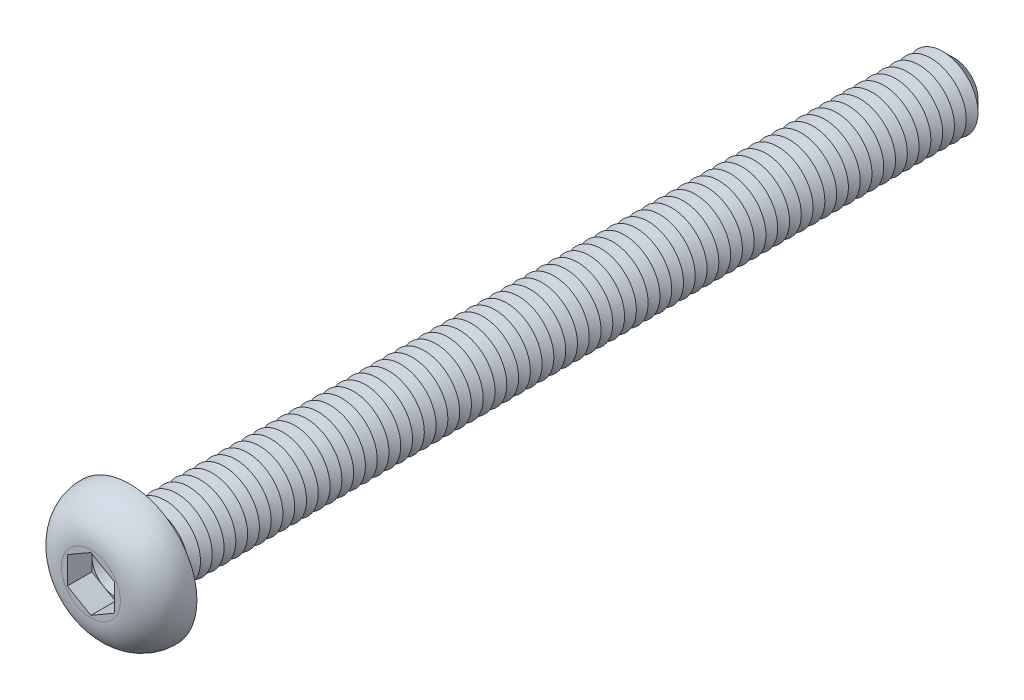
ISO-10303-21;
HEADER;
FILE_DESCRIPTION(('STEP AP214'),'2;1');
FILE_NAME('part.step','',(''),(''),'','','');
FILE_SCHEMA(('AUTOMOTIVE_DESIGN { 1 0 10303 214 1 1 1 1 }'));
ENDSEC;
DATA;
#1=APPLICATION_CONTEXT('core data for automotive mechanical design processes');
#2=APPLICATION_PROTOCOL_DEFINITION('international standard','automotive_design',2000,#1);
#3=PRODUCT_CONTEXT('',#1,'mechanical');
#4=PRODUCT('Part','Part','',(#3));
#5=PRODUCT_RELATED_PRODUCT_CATEGORY('part','',(#4));
#6=PRODUCT_DEFINITION_FORMATION('','',#4);
#7=PRODUCT_DEFINITION_CONTEXT('part definition',#1,'design');
#8=PRODUCT_DEFINITION('design','',#6,#7);
#9=PRODUCT_DEFINITION_SHAPE('','',#8);
#10=(LENGTH_UNIT() NAMED_UNIT(*) SI_UNIT(.MILLI.,.METRE.));
#11=(NAMED_UNIT(*) PLANE_ANGLE_UNIT() SI_UNIT($,.RADIAN.));
#12=(NAMED_UNIT(*) SI_UNIT($,.STERADIAN.) SOLID_ANGLE_UNIT());
#13=UNCERTAINTY_MEASURE_WITH_UNIT(LENGTH_MEASURE(1.E-05),#10,'distance_accuracy_value','');
#14=(GEOMETRIC_REPRESENTATION_CONTEXT(3) GLOBAL_UNCERTAINTY_ASSIGNED_CONTEXT((#13)) GLOBAL_UNIT_ASSIGNED_CONTEXT((#10,
#11,#12)) REPRESENTATION_CONTEXT('',''));
#15=CARTESIAN_POINT('',(0.,0.,0.));
#16=DIRECTION('',(0.,0.,1.));
#17=DIRECTION('',(1.,0.,0.));
#18=AXIS2_PLACEMENT_3D('',#15,#16,#17);
#19=CARTESIAN_POINT('',(0.,0.,0.61));
#20=DIRECTION('',(0.,0.,1.));
#21=DIRECTION('',(1.,0.,0.));
#22=AXIS2_PLACEMENT_3D('',#19,#20,#21);
#23=PLANE('',#22);
#24=CARTESIAN_POINT('',(0.,0.,0.61));
#25=DIRECTION('',(0.,0.,1.));
#26=DIRECTION('',(1.,0.,0.));
#27=AXIS2_PLACEMENT_3D('',#24,#25,#26);
#28=CIRCLE('',#27,1.);
#29=CARTESIAN_POINT('',(1.,0.,0.61));
#30=VERTEX_POINT('',#29);
#31=CARTESIAN_POINT('',(0.5,0.866025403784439,0.61));
#32=VERTEX_POINT('',#31);
#33=EDGE_CURVE('E117',#30,#32,#28,.T.);
#34=ORIENTED_EDGE('',*,*,#33,.F.);
#35=DIRECTION('',(0.,1.,0.));
#36=VECTOR('',#35,1.);
#37=CARTESIAN_POINT('',(1.,-0.577350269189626,0.61));
#38=LINE('',#37,#36);
#39=CARTESIAN_POINT('',(1.,0.577350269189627,0.61));
#40=VERTEX_POINT('',#39);
#41=EDGE_CURVE('E140',#30,#40,#38,.T.);
#42=ORIENTED_EDGE('',*,*,#41,.T.);
#43=DIRECTION('',(-0.866025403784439,0.5,0.));
#44=VECTOR('',#43,1.);
#45=CARTESIAN_POINT('',(1.,0.577350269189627,0.61));
#46=LINE('',#45,#44);
#47=EDGE_CURVE('E135',#40,#32,#46,.T.);
#48=ORIENTED_EDGE('',*,*,#47,.T.);
#49=EDGE_LOOP('',(#34,#42,#48));
#50=FACE_BOUND('',#49,.T.);
#51=ADVANCED_FACE('F39',(#50),#23,.T.);
#52=CARTESIAN_POINT('',(0.,0.,0.61));
#53=DIRECTION('',(0.,0.,1.));
#54=DIRECTION('',(1.,0.,0.));
#55=AXIS2_PLACEMENT_3D('',#52,#53,#54);
#56=CIRCLE('',#55,1.);
#57=CARTESIAN_POINT('',(-0.5,0.866025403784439,0.61));
#58=VERTEX_POINT('',#57);
#59=EDGE_CURVE('E11',#32,#58,#56,.T.);
#60=ORIENTED_EDGE('',*,*,#59,.F.);
#61=CARTESIAN_POINT('',(0.,1.15470053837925,0.61));
#62=VERTEX_POINT('',#61);
#63=EDGE_CURVE('E130',#32,#62,#46,.T.);
#64=ORIENTED_EDGE('',*,*,#63,.T.);
#65=DIRECTION('',(-0.866025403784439,-0.5,0.));
#66=VECTOR('',#65,1.);
#67=CARTESIAN_POINT('',(0.,1.15470053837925,0.61));
#68=LINE('',#67,#66);
#69=EDGE_CURVE('E132',#62,#58,#68,.T.);
#70=ORIENTED_EDGE('',*,*,#69,.T.);
#71=EDGE_LOOP('',(#60,#64,#70));
#72=FACE_BOUND('',#71,.T.);
#73=ADVANCED_FACE('F129',(#72),#23,.T.);
#74=CARTESIAN_POINT('',(-1.,0.,0.61));
#75=VERTEX_POINT('',#74);
#76=EDGE_CURVE('E49',#58,#75,#56,.T.);
#77=ORIENTED_EDGE('',*,*,#76,.F.);
#78=CARTESIAN_POINT('',(-1.,0.577350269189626,0.61));
#79=VERTEX_POINT('',#78);
#80=EDGE_CURVE('E143',#58,#79,#68,.T.);
#81=ORIENTED_EDGE('',*,*,#80,.T.);
#82=DIRECTION('',(0.,-1.,0.));
#83=VECTOR('',#82,1.);
#84=CARTESIAN_POINT('',(-1.,0.577350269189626,0.61));
#85=LINE('',#84,#83);
#86=EDGE_CURVE('E154',#79,#75,#85,.T.);
#87=ORIENTED_EDGE('',*,*,#86,.T.);
#88=EDGE_LOOP('',(#77,#81,#87));
#89=FACE_BOUND('',#88,.T.);
#90=ADVANCED_FACE('F252',(#89),#23,.T.);
#91=CARTESIAN_POINT('',(-0.5,-0.866025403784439,0.61));
#92=VERTEX_POINT('',#91);
#93=EDGE_CURVE('E234',#75,#92,#56,.T.);
#94=ORIENTED_EDGE('',*,*,#93,.F.);
#95=CARTESIAN_POINT('',(-1.,-0.577350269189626,0.61));
#96=VERTEX_POINT('',#95);
#97=EDGE_CURVE('E153',#75,#96,#85,.T.);
#98=ORIENTED_EDGE('',*,*,#97,.T.);
#99=DIRECTION('',(0.866025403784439,-0.5,0.));
#100=VECTOR('',#99,1.);
#101=CARTESIAN_POINT('',(-1.,-0.577350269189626,0.61));
#102=LINE('',#101,#100);
#103=EDGE_CURVE('E158',#96,#92,#102,.T.);
#104=ORIENTED_EDGE('',*,*,#103,.T.);
#105=EDGE_LOOP('',(#94,#98,#104));
#106=FACE_BOUND('',#105,.T.);
#107=ADVANCED_FACE('F246',(#106),#23,.T.);
#108=CARTESIAN_POINT('',(0.5,-0.866025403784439,0.61));
#109=VERTEX_POINT('',#108);
#110=EDGE_CURVE('E56',#92,#109,#56,.T.);
#111=ORIENTED_EDGE('',*,*,#110,.F.);
#112=CARTESIAN_POINT('',(0.,-1.15470053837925,0.61));
#113=VERTEX_POINT('',#112);
#114=EDGE_CURVE('E157',#92,#113,#102,.T.);
#115=ORIENTED_EDGE('',*,*,#114,.T.);
#116=DIRECTION('',(0.866025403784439,0.5,0.));
#117=VECTOR('',#116,1.);
#118=CARTESIAN_POINT('',(0.,-1.15470053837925,0.61));
#119=LINE('',#118,#117);
#120=EDGE_CURVE('E163',#113,#109,#119,.T.);
#121=ORIENTED_EDGE('',*,*,#120,.T.);
#122=EDGE_LOOP('',(#111,#115,#121));
#123=FACE_BOUND('',#122,.T.);
#124=ADVANCED_FACE('F841',(#123),#23,.T.);
#125=CARTESIAN_POINT('',(0.,0.,-35.));
#126=DIRECTION('',(0.,0.,1.));
#127=DIRECTION('',(1.,0.,0.));
#128=AXIS2_PLACEMENT_3D('',#125,#126,#127);
#129=CYLINDRICAL_SURFACE('',#128,1.5);
#130=CARTESIAN_POINT('',(0.,0.,-0.199999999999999));
#131=DIRECTION('',(0.,0.,1.));
#132=DIRECTION('',(1.,0.,0.));
#133=AXIS2_PLACEMENT_3D('',#130,#131,#132);
#134=CIRCLE('',#133,1.5);
#135=CARTESIAN_POINT('',(1.5,0.,-0.199999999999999));
#136=VERTEX_POINT('',#135);
#137=EDGE_CURVE('E221',#136,#136,#134,.F.);
#138=ORIENTED_EDGE('',*,*,#137,.T.);
#139=EDGE_LOOP('',(#138));
#140=FACE_BOUND('',#139,.T.);
#141=CARTESIAN_POINT('',(0.,0.,-0.5));
#142=DIRECTION('',(0.,0.,1.));
#143=DIRECTION('',(1.,0.,0.));
#144=AXIS2_PLACEMENT_3D('',#141,#142,#143);
#145=CIRCLE('',#144,1.50000000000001);
#146=CARTESIAN_POINT('',(1.50000000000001,0.,-0.5));
#147=VERTEX_POINT('',#146);
#148=EDGE_CURVE('E149',#147,#147,#145,.T.);
#149=ORIENTED_EDGE('',*,*,#148,.T.);
#150=EDGE_LOOP('',(#149));
#151=FACE_BOUND('',#150,.T.);
#152=ADVANCED_FACE('F850',(#140,#151),#129,.T.);
#153=CARTESIAN_POINT('',(0.,2.85,0.));
#154=DIRECTION('',(0.,0.,1.));
#155=DIRECTION('',(1.,0.,0.));
#156=AXIS2_PLACEMENT_3D('',#153,#154,#155);
#157=PLANE('',#156);
#158=CARTESIAN_POINT('',(0.,0.,0.));
#159=DIRECTION('',(0.,0.,1.));
#160=DIRECTION('',(1.,0.,0.));
#161=AXIS2_PLACEMENT_3D('',#158,#159,#160);
#162=CIRCLE('',#161,1.7);
#163=CARTESIAN_POINT('',(1.7,0.,0.));
#164=VERTEX_POINT('',#163);
#165=EDGE_CURVE('E224',#164,#164,#162,.T.);
#166=ORIENTED_EDGE('',*,*,#165,.T.);
#167=EDGE_LOOP('',(#166));
#168=FACE_BOUND('',#167,.T.);
#169=CARTESIAN_POINT('',(0.,0.,0.));
#170=DIRECTION('',(0.,0.,1.));
#171=DIRECTION('',(1.,0.,0.));
#172=AXIS2_PLACEMENT_3D('',#169,#170,#171);
#173=CIRCLE('',#172,2.85);
#174=CARTESIAN_POINT('',(2.85,0.,0.));
#175=VERTEX_POINT('',#174);
#176=EDGE_CURVE('E195',#175,#175,#173,.T.);
#177=ORIENTED_EDGE('',*,*,#176,.F.);
#178=EDGE_LOOP('',(#177));
#179=FACE_BOUND('',#178,.T.);
#180=ADVANCED_FACE('F855',(#168,#179),#157,.F.);
#181=CARTESIAN_POINT('',(0.,0.,1.65));
#182=DIRECTION('',(0.,0.,-1.));
#183=DIRECTION('',(-1.,0.,0.));
#184=AXIS2_PLACEMENT_3D('',#181,#182,#183);
#185=PLANE('',#184);
#186=DIRECTION('',(-0.866025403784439,-0.5,0.));
#187=VECTOR('',#186,1.);
#188=CARTESIAN_POINT('',(0.,1.15470053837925,1.65));
#189=LINE('',#188,#187);
#190=CARTESIAN_POINT('',(0.,1.15470053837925,1.65));
#191=VERTEX_POINT('',#190);
#192=CARTESIAN_POINT('',(-1.,0.577350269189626,1.65));
#193=VERTEX_POINT('',#192);
#194=EDGE_CURVE('E173',#191,#193,#189,.T.);
#195=ORIENTED_EDGE('',*,*,#194,.F.);
#196=DIRECTION('',(-0.866025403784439,0.5,0.));
#197=VECTOR('',#196,1.);
#198=CARTESIAN_POINT('',(1.,0.577350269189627,1.65));
#199=LINE('',#198,#197);
#200=CARTESIAN_POINT('',(1.,0.577350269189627,1.65));
#201=VERTEX_POINT('',#200);
#202=EDGE_CURVE('E64',#201,#191,#199,.T.);
#203=ORIENTED_EDGE('',*,*,#202,.F.);
#204=DIRECTION('',(0.,1.,0.));
#205=VECTOR('',#204,1.);
#206=CARTESIAN_POINT('',(1.,-0.577350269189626,1.65));
#207=LINE('',#206,#205);
#208=CARTESIAN_POINT('',(1.,-0.577350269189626,1.65));
#209=VERTEX_POINT('',#208);
#210=EDGE_CURVE('E138',#209,#201,#207,.T.);
#211=ORIENTED_EDGE('',*,*,#210,.F.);
#212=DIRECTION('',(0.866025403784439,0.5,0.));
#213=VECTOR('',#212,1.);
#214=CARTESIAN_POINT('',(0.,-1.15470053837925,1.65));
#215=LINE('',#214,#213);
#216=CARTESIAN_POINT('',(0.,-1.15470053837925,1.65));
#217=VERTEX_POINT('',#216);
#218=EDGE_CURVE('E185',#217,#209,#215,.T.);
#219=ORIENTED_EDGE('',*,*,#218,.F.);
#220=DIRECTION('',(0.866025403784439,-0.5,0.));
#221=VECTOR('',#220,1.);
#222=CARTESIAN_POINT('',(-1.,-0.577350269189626,1.65));
#223=LINE('',#222,#221);
#224=CARTESIAN_POINT('',(-1.,-0.577350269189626,1.65));
#225=VERTEX_POINT('',#224);
#226=EDGE_CURVE('E181',#225,#217,#223,.T.);
#227=ORIENTED_EDGE('',*,*,#226,.F.);
#228=DIRECTION('',(0.,-1.,0.));
#229=VECTOR('',#228,1.);
#230=CARTESIAN_POINT('',(-1.,0.577350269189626,1.65));
#231=LINE('',#230,#229);
#232=EDGE_CURVE('E177',#193,#225,#231,.T.);
#233=ORIENTED_EDGE('',*,*,#232,.F.);
#234=EDGE_LOOP('',(#195,#203,#211,#219,#227,#233));
#235=FACE_BOUND('',#234,.T.);
#236=CARTESIAN_POINT('',(0.,0.,1.65));
#237=DIRECTION('',(0.,0.,1.));
#238=DIRECTION('',(1.,0.,0.));
#239=AXIS2_PLACEMENT_3D('',#236,#237,#238);
#240=CIRCLE('',#239,1.25078144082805);
#241=CARTESIAN_POINT('',(1.25078144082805,0.,1.65));
#242=VERTEX_POINT('',#241);
#243=EDGE_CURVE('E213',#242,#242,#240,.T.);
#244=ORIENTED_EDGE('',*,*,#243,.T.);
#245=EDGE_LOOP('',(#244));
#246=FACE_BOUND('',#245,.T.);
#247=ADVANCED_FACE('F261',(#235,#246),#185,.F.);
#248=CARTESIAN_POINT('',(0.,0.,0.0499999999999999));
#249=DIRECTION('',(0.,0.,1.));
#250=DIRECTION('',(1.,0.,0.));
#251=AXIS2_PLACEMENT_3D('',#248,#249,#250);
#252=DEGENERATE_TOROIDAL_SURFACE('',#251,1.25078144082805,1.6,.T.);
#253=ORIENTED_EDGE('',*,*,#243,.F.);
#254=EDGE_LOOP('',(#253));
#255=FACE_BOUND('',#254,.T.);
#256=ORIENTED_EDGE('',*,*,#176,.T.);
#257=EDGE_LOOP('',(#256));
#258=FACE_BOUND('',#257,.T.);
#259=ADVANCED_FACE('F871',(#255,#258),#252,.T.);
#260=CARTESIAN_POINT('',(1.,0.577350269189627,0.61));
#261=DIRECTION('',(0.5,0.866025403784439,0.));
#262=DIRECTION('',(-0.866025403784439,0.5,0.));
#263=AXIS2_PLACEMENT_3D('',#260,#261,#262);
#264=PLANE('',#263);
#265=ORIENTED_EDGE('',*,*,#202,.T.);
#266=DIRECTION('',(0.,0.,1.));
#267=VECTOR('',#266,1.);
#268=CARTESIAN_POINT('',(0.,1.15470053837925,0.61));
#269=LINE('',#268,#267);
#270=EDGE_CURVE('E136',#62,#191,#269,.T.);
#271=ORIENTED_EDGE('',*,*,#270,.F.);
#272=ORIENTED_EDGE('',*,*,#63,.F.);
#273=ORIENTED_EDGE('',*,*,#47,.F.);
#274=DIRECTION('',(0.,0.,1.));
#275=VECTOR('',#274,1.);
#276=CARTESIAN_POINT('',(1.,0.577350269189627,0.61));
#277=LINE('',#276,#275);
#278=EDGE_CURVE('E192',#40,#201,#277,.T.);
#279=ORIENTED_EDGE('',*,*,#278,.T.);
#280=EDGE_LOOP('',(#265,#271,#272,#273,#279));
#281=FACE_BOUND('',#280,.T.);
#282=ADVANCED_FACE('F134',(#281),#264,.F.);
#283=CARTESIAN_POINT('',(1.,-0.577350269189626,0.61));
#284=DIRECTION('',(1.,0.,0.));
#285=DIRECTION('',(0.,0.,-1.));
#286=AXIS2_PLACEMENT_3D('',#283,#284,#285);
#287=PLANE('',#286);
#288=ORIENTED_EDGE('',*,*,#210,.T.);
#289=ORIENTED_EDGE('',*,*,#278,.F.);
#290=ORIENTED_EDGE('',*,*,#41,.F.);
#291=CARTESIAN_POINT('',(1.,-0.577350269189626,0.61));
#292=VERTEX_POINT('',#291);
#293=EDGE_CURVE('E167',#292,#30,#38,.T.);
#294=ORIENTED_EDGE('',*,*,#293,.F.);
#295=DIRECTION('',(0.,0.,1.));
#296=VECTOR('',#295,1.);
#297=CARTESIAN_POINT('',(1.,-0.577350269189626,0.61));
#298=LINE('',#297,#296);
#299=EDGE_CURVE('E196',#292,#209,#298,.T.);
#300=ORIENTED_EDGE('',*,*,#299,.T.);
#301=EDGE_LOOP('',(#288,#289,#290,#294,#300));
#302=FACE_BOUND('',#301,.T.);
#303=ADVANCED_FACE('F863',(#302),#287,.F.);
#304=CARTESIAN_POINT('',(0.,-1.15470053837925,0.61));
#305=DIRECTION('',(0.5,-0.866025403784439,0.));
#306=DIRECTION('',(0.866025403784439,0.5,0.));
#307=AXIS2_PLACEMENT_3D('',#304,#305,#306);
#308=PLANE('',#307);
#309=ORIENTED_EDGE('',*,*,#218,.T.);
#310=ORIENTED_EDGE('',*,*,#299,.F.);
#311=EDGE_CURVE('E162',#109,#292,#119,.T.);
#312=ORIENTED_EDGE('',*,*,#311,.F.);
#313=ORIENTED_EDGE('',*,*,#120,.F.);
#314=DIRECTION('',(0.,0.,1.));
#315=VECTOR('',#314,1.);
#316=CARTESIAN_POINT('',(0.,-1.15470053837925,0.61));
#317=LINE('',#316,#315);
#318=EDGE_CURVE('E199',#113,#217,#317,.T.);
#319=ORIENTED_EDGE('',*,*,#318,.T.);
#320=EDGE_LOOP('',(#309,#310,#312,#313,#319));
#321=FACE_BOUND('',#320,.T.);
#322=ADVANCED_FACE('F859',(#321),#308,.F.);
#323=CARTESIAN_POINT('',(-1.,-0.577350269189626,0.61));
#324=DIRECTION('',(-0.5,-0.866025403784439,0.));
#325=DIRECTION('',(0.866025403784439,-0.5,0.));
#326=AXIS2_PLACEMENT_3D('',#323,#324,#325);
#327=PLANE('',#326);
#328=ORIENTED_EDGE('',*,*,#226,.T.);
#329=ORIENTED_EDGE('',*,*,#318,.F.);
#330=ORIENTED_EDGE('',*,*,#114,.F.);
#331=ORIENTED_EDGE('',*,*,#103,.F.);
#332=DIRECTION('',(0.,0.,1.));
#333=VECTOR('',#332,1.);
#334=CARTESIAN_POINT('',(-1.,-0.577350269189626,0.61));
#335=LINE('',#334,#333);
#336=EDGE_CURVE('E202',#96,#225,#335,.T.);
#337=ORIENTED_EDGE('',*,*,#336,.T.);
#338=EDGE_LOOP('',(#328,#329,#330,#331,#337));
#339=FACE_BOUND('',#338,.T.);
#340=ADVANCED_FACE('F266',(#339),#327,.F.);
#341=CARTESIAN_POINT('',(-1.,0.577350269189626,0.61));
#342=DIRECTION('',(-1.,0.,0.));
#343=DIRECTION('',(0.,-1.,0.));
#344=AXIS2_PLACEMENT_3D('',#341,#342,#343);
#345=PLANE('',#344);
#346=ORIENTED_EDGE('',*,*,#232,.T.);
#347=ORIENTED_EDGE('',*,*,#336,.F.);
#348=ORIENTED_EDGE('',*,*,#97,.F.);
#349=ORIENTED_EDGE('',*,*,#86,.F.);
#350=DIRECTION('',(0.,0.,1.));
#351=VECTOR('',#350,1.);
#352=CARTESIAN_POINT('',(-1.,0.577350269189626,0.61));
#353=LINE('',#352,#351);
#354=EDGE_CURVE('E205',#79,#193,#353,.T.);
#355=ORIENTED_EDGE('',*,*,#354,.T.);
#356=EDGE_LOOP('',(#346,#347,#348,#349,#355));
#357=FACE_BOUND('',#356,.T.);
#358=ADVANCED_FACE('F251',(#357),#345,.F.);
#359=CARTESIAN_POINT('',(0.,1.15470053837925,0.61));
#360=DIRECTION('',(-0.5,0.866025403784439,0.));
#361=DIRECTION('',(-0.866025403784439,-0.5,0.));
#362=AXIS2_PLACEMENT_3D('',#359,#360,#361);
#363=PLANE('',#362);
#364=ORIENTED_EDGE('',*,*,#194,.T.);
#365=ORIENTED_EDGE('',*,*,#354,.F.);
#366=ORIENTED_EDGE('',*,*,#80,.F.);
#367=ORIENTED_EDGE('',*,*,#69,.F.);
#368=ORIENTED_EDGE('',*,*,#270,.T.);
#369=EDGE_LOOP('',(#364,#365,#366,#367,#368));
#370=FACE_BOUND('',#369,.T.);
#371=ADVANCED_FACE('F255',(#370),#363,.F.);
#372=EDGE_CURVE('E43',#109,#30,#56,.T.);
#373=ORIENTED_EDGE('',*,*,#372,.F.);
#374=ORIENTED_EDGE('',*,*,#311,.T.);
#375=ORIENTED_EDGE('',*,*,#293,.T.);
#376=EDGE_LOOP('',(#373,#374,#375));
#377=FACE_BOUND('',#376,.T.);
#378=ADVANCED_FACE('F832',(#377),#23,.T.);
#379=CARTESIAN_POINT('',(0.,0.,-0.5));
#380=DIRECTION('',(0.,0.,1.));
#381=DIRECTION('',(1.,0.,0.));
#382=AXIS2_PLACEMENT_3D('',#379,#380,#381);
#383=CONICAL_SURFACE('',#382,1.50000000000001,1.0471975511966);
#384=CARTESIAN_POINT('',(0.,0.,-0.750000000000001));
#385=DIRECTION('',(0.,0.,1.));
#386=DIRECTION('',(1.,0.,0.));
#387=AXIS2_PLACEMENT_3D('',#384,#385,#386);
#388=CIRCLE('',#387,1.06698729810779);
#389=CARTESIAN_POINT('',(1.06698729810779,0.,-0.750000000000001));
#390=VERTEX_POINT('',#389);
#391=EDGE_CURVE('E319',#390,#390,#388,.T.);
#392=ORIENTED_EDGE('',*,*,#391,.T.);
#393=EDGE_LOOP('',(#392));
#394=FACE_BOUND('',#393,.T.);
#395=ORIENTED_EDGE('',*,*,#148,.F.);
#396=EDGE_LOOP('',(#395));
#397=FACE_BOUND('',#396,.T.);
#398=ADVANCED_FACE('F839',(#394,#397),#383,.T.);
#399=CARTESIAN_POINT('',(0.,0.,-0.750000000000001));
#400=DIRECTION('',(0.,0.,-1.));
#401=DIRECTION('',(-1.,0.,0.));
#402=AXIS2_PLACEMENT_3D('',#399,#400,#401);
#403=CONICAL_SURFACE('',#402,1.06698729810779,1.0471975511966);
#404=CARTESIAN_POINT('',(0.,0.,-1.));
#405=DIRECTION('',(0.,0.,1.));
#406=DIRECTION('',(1.,0.,0.));
#407=AXIS2_PLACEMENT_3D('',#404,#405,#406);
#408=CIRCLE('',#407,1.50000000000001);
#409=CARTESIAN_POINT('',(1.50000000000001,0.,-1.));
#410=VERTEX_POINT('',#409);
#411=EDGE_CURVE('E317',#410,#410,#408,.T.);
#412=ORIENTED_EDGE('',*,*,#411,.T.);
#413=EDGE_LOOP('',(#412));
#414=FACE_BOUND('',#413,.T.);
#415=ORIENTED_EDGE('',*,*,#391,.F.);
#416=EDGE_LOOP('',(#415));
#417=FACE_BOUND('',#416,.T.);
#418=ADVANCED_FACE('F846',(#414,#417),#403,.T.);
#419=CARTESIAN_POINT('',(0.,0.,-1.));
#420=DIRECTION('',(0.,0.,1.));
#421=DIRECTION('',(1.,0.,0.));
#422=AXIS2_PLACEMENT_3D('',#419,#420,#421);
#423=CONICAL_SURFACE('',#422,1.50000000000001,1.0471975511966);
#424=CARTESIAN_POINT('',(0.,0.,-1.25));
#425=DIRECTION('',(0.,0.,1.));
#426=DIRECTION('',(1.,0.,0.));
#427=AXIS2_PLACEMENT_3D('',#424,#425,#426);
#428=CIRCLE('',#427,1.06698729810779);
#429=CARTESIAN_POINT('',(1.06698729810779,0.,-1.25));
#430=VERTEX_POINT('',#429);
#431=EDGE_CURVE('E320',#430,#430,#428,.T.);
#432=ORIENTED_EDGE('',*,*,#431,.T.);
#433=EDGE_LOOP('',(#432));
#434=FACE_BOUND('',#433,.T.);
#435=ORIENTED_EDGE('',*,*,#411,.F.);
#436=EDGE_LOOP('',(#435));
#437=FACE_BOUND('',#436,.T.);
#438=ADVANCED_FACE('F2319',(#434,#437),#423,.T.);
#439=CARTESIAN_POINT('',(0.,0.,-1.25));
#440=DIRECTION('',(0.,0.,-1.));
#441=DIRECTION('',(-1.,0.,0.));
#442=AXIS2_PLACEMENT_3D('',#439,#440,#441);
#443=CONICAL_SURFACE('',#442,1.06698729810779,1.0471975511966);
#444=CARTESIAN_POINT('',(0.,0.,-1.5));
#445=DIRECTION('',(0.,0.,1.));
#446=DIRECTION('',(1.,0.,0.));
#447=AXIS2_PLACEMENT_3D('',#444,#445,#446);
#448=CIRCLE('',#447,1.50000000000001);
#449=CARTESIAN_POINT('',(1.50000000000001,0.,-1.5));
#450=VERTEX_POINT('',#449);
#451=EDGE_CURVE('E416',#450,#450,#448,.T.);
#452=ORIENTED_EDGE('',*,*,#451,.T.);
#453=EDGE_LOOP('',(#452));
#454=FACE_BOUND('',#453,.T.);
#455=ORIENTED_EDGE('',*,*,#431,.F.);
#456=EDGE_LOOP('',(#455));
#457=FACE_BOUND('',#456,.T.);
#458=ADVANCED_FACE('F2309',(#454,#457),#443,.T.);
#459=CARTESIAN_POINT('',(0.,0.,-1.5));
#460=DIRECTION('',(0.,0.,1.));
#461=DIRECTION('',(1.,0.,0.));
#462=AXIS2_PLACEMENT_3D('',#459,#460,#461);
#463=CONICAL_SURFACE('',#462,1.50000000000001,1.0471975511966);
#464=CARTESIAN_POINT('',(0.,0.,-1.75));
#465=DIRECTION('',(0.,0.,1.));
#466=DIRECTION('',(1.,0.,0.));
#467=AXIS2_PLACEMENT_3D('',#464,#465,#466);
#468=CIRCLE('',#467,1.06698729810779);
#469=CARTESIAN_POINT('',(1.06698729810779,0.,-1.75));
#470=VERTEX_POINT('',#469);
#471=EDGE_CURVE('E420',#470,#470,#468,.T.);
#472=ORIENTED_EDGE('',*,*,#471,.T.);
#473=EDGE_LOOP('',(#472));
#474=FACE_BOUND('',#473,.T.);
#475=ORIENTED_EDGE('',*,*,#451,.F.);
#476=EDGE_LOOP('',(#475));
#477=FACE_BOUND('',#476,.T.);
#478=ADVANCED_FACE('F2299',(#474,#477),#463,.T.);
#479=CARTESIAN_POINT('',(0.,0.,-1.75));
#480=DIRECTION('',(0.,0.,-1.));
#481=DIRECTION('',(-1.,0.,0.));
#482=AXIS2_PLACEMENT_3D('',#479,#480,#481);
#483=CONICAL_SURFACE('',#482,1.06698729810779,1.0471975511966);
#484=CARTESIAN_POINT('',(0.,0.,-2.));
#485=DIRECTION('',(0.,0.,1.));
#486=DIRECTION('',(1.,0.,0.));
#487=AXIS2_PLACEMENT_3D('',#484,#485,#486);
#488=CIRCLE('',#487,1.50000000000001);
#489=CARTESIAN_POINT('',(1.50000000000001,0.,-2.));
#490=VERTEX_POINT('',#489);
#491=EDGE_CURVE('E424',#490,#490,#488,.T.);
#492=ORIENTED_EDGE('',*,*,#491,.T.);
#493=EDGE_LOOP('',(#492));
#494=FACE_BOUND('',#493,.T.);
#495=ORIENTED_EDGE('',*,*,#471,.F.);
#496=EDGE_LOOP('',(#495));
#497=FACE_BOUND('',#496,.T.);
#498=ADVANCED_FACE('F2289',(#494,#497),#483,.T.);
#499=CARTESIAN_POINT('',(0.,0.,-2.));
#500=DIRECTION('',(0.,0.,1.));
#501=DIRECTION('',(1.,0.,0.));
#502=AXIS2_PLACEMENT_3D('',#499,#500,#501);
#503=CONICAL_SURFACE('',#502,1.50000000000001,1.0471975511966);
#504=CARTESIAN_POINT('',(0.,0.,-2.25));
#505=DIRECTION('',(0.,0.,1.));
#506=DIRECTION('',(1.,0.,0.));
#507=AXIS2_PLACEMENT_3D('',#504,#505,#506);
#508=CIRCLE('',#507,1.06698729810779);
#509=CARTESIAN_POINT('',(1.06698729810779,0.,-2.25));
#510=VERTEX_POINT('',#509);
#511=EDGE_CURVE('E314',#510,#510,#508,.T.);
#512=ORIENTED_EDGE('',*,*,#511,.T.);
#513=EDGE_LOOP('',(#512));
#514=FACE_BOUND('',#513,.T.);
#515=ORIENTED_EDGE('',*,*,#491,.F.);
#516=EDGE_LOOP('',(#515));
#517=FACE_BOUND('',#516,.T.);
#518=ADVANCED_FACE('F2279',(#514,#517),#503,.T.);
#519=CARTESIAN_POINT('',(0.,0.,-2.25));
#520=DIRECTION('',(0.,0.,-1.));
#521=DIRECTION('',(-1.,0.,0.));
#522=AXIS2_PLACEMENT_3D('',#519,#520,#521);
#523=CONICAL_SURFACE('',#522,1.06698729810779,1.0471975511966);
#524=CARTESIAN_POINT('',(0.,0.,-2.5));
#525=DIRECTION('',(0.,0.,1.));
#526=DIRECTION('',(1.,0.,0.));
#527=AXIS2_PLACEMENT_3D('',#524,#525,#526);
#528=CIRCLE('',#527,1.50000000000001);
#529=CARTESIAN_POINT('',(1.50000000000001,0.,-2.5));
#530=VERTEX_POINT('',#529);
#531=EDGE_CURVE('E311',#530,#530,#528,.T.);
#532=ORIENTED_EDGE('',*,*,#531,.T.);
#533=EDGE_LOOP('',(#532));
#534=FACE_BOUND('',#533,.T.);
#535=ORIENTED_EDGE('',*,*,#511,.F.);
#536=EDGE_LOOP('',(#535));
#537=FACE_BOUND('',#536,.T.);
#538=ADVANCED_FACE('F2269',(#534,#537),#523,.T.);
#539=CARTESIAN_POINT('',(0.,0.,-2.5));
#540=DIRECTION('',(0.,0.,1.));
#541=DIRECTION('',(1.,0.,0.));
#542=AXIS2_PLACEMENT_3D('',#539,#540,#541);
#543=CONICAL_SURFACE('',#542,1.50000000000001,1.0471975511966);
#544=CARTESIAN_POINT('',(0.,0.,-2.75));
#545=DIRECTION('',(0.,0.,1.));
#546=DIRECTION('',(1.,0.,0.));
#547=AXIS2_PLACEMENT_3D('',#544,#545,#546);
#548=CIRCLE('',#547,1.06698729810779);
#549=CARTESIAN_POINT('',(1.06698729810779,0.,-2.75));
#550=VERTEX_POINT('',#549);
#551=EDGE_CURVE('E315',#550,#550,#548,.T.);
#552=ORIENTED_EDGE('',*,*,#551,.T.);
#553=EDGE_LOOP('',(#552));
#554=FACE_BOUND('',#553,.T.);
#555=ORIENTED_EDGE('',*,*,#531,.F.);
#556=EDGE_LOOP('',(#555));
#557=FACE_BOUND('',#556,.T.);
#558=ADVANCED_FACE('F2259',(#554,#557),#543,.T.);
#559=CARTESIAN_POINT('',(0.,0.,-2.75));
#560=DIRECTION('',(0.,0.,-1.));
#561=DIRECTION('',(-1.,0.,0.));
#562=AXIS2_PLACEMENT_3D('',#559,#560,#561);
#563=CONICAL_SURFACE('',#562,1.06698729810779,1.0471975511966);
#564=CARTESIAN_POINT('',(0.,0.,-3.));
#565=DIRECTION('',(0.,0.,1.));
#566=DIRECTION('',(1.,0.,0.));
#567=AXIS2_PLACEMENT_3D('',#564,#565,#566);
#568=CIRCLE('',#567,1.50000000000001);
#569=CARTESIAN_POINT('',(1.50000000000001,0.,-3.));
#570=VERTEX_POINT('',#569);
#571=EDGE_CURVE('E434',#570,#570,#568,.T.);
#572=ORIENTED_EDGE('',*,*,#571,.T.);
#573=EDGE_LOOP('',(#572));
#574=FACE_BOUND('',#573,.T.);
#575=ORIENTED_EDGE('',*,*,#551,.F.);
#576=EDGE_LOOP('',(#575));
#577=FACE_BOUND('',#576,.T.);
#578=ADVANCED_FACE('F2249',(#574,#577),#563,.T.);
#579=CARTESIAN_POINT('',(0.,0.,-3.));
#580=DIRECTION('',(0.,0.,1.));
#581=DIRECTION('',(1.,0.,0.));
#582=AXIS2_PLACEMENT_3D('',#579,#580,#581);
#583=CONICAL_SURFACE('',#582,1.50000000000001,1.0471975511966);
#584=CARTESIAN_POINT('',(0.,0.,-3.25));
#585=DIRECTION('',(0.,0.,1.));
#586=DIRECTION('',(1.,0.,0.));
#587=AXIS2_PLACEMENT_3D('',#584,#585,#586);
#588=CIRCLE('',#587,1.06698729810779);
#589=CARTESIAN_POINT('',(1.06698729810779,0.,-3.25));
#590=VERTEX_POINT('',#589);
#591=EDGE_CURVE('E438',#590,#590,#588,.T.);
#592=ORIENTED_EDGE('',*,*,#591,.T.);
#593=EDGE_LOOP('',(#592));
#594=FACE_BOUND('',#593,.T.);
#595=ORIENTED_EDGE('',*,*,#571,.F.);
#596=EDGE_LOOP('',(#595));
#597=FACE_BOUND('',#596,.T.);
#598=ADVANCED_FACE('F2239',(#594,#597),#583,.T.);
#599=CARTESIAN_POINT('',(0.,0.,-3.25));
#600=DIRECTION('',(0.,0.,-1.));
#601=DIRECTION('',(-1.,0.,0.));
#602=AXIS2_PLACEMENT_3D('',#599,#600,#601);
#603=CONICAL_SURFACE('',#602,1.06698729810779,1.0471975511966);
#604=CARTESIAN_POINT('',(0.,0.,-3.5));
#605=DIRECTION('',(0.,0.,1.));
#606=DIRECTION('',(1.,0.,0.));
#607=AXIS2_PLACEMENT_3D('',#604,#605,#606);
#608=CIRCLE('',#607,1.50000000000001);
#609=CARTESIAN_POINT('',(1.50000000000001,0.,-3.5));
#610=VERTEX_POINT('',#609);
#611=EDGE_CURVE('E442',#610,#610,#608,.T.);
#612=ORIENTED_EDGE('',*,*,#611,.T.);
#613=EDGE_LOOP('',(#612));
#614=FACE_BOUND('',#613,.T.);
#615=ORIENTED_EDGE('',*,*,#591,.F.);
#616=EDGE_LOOP('',(#615));
#617=FACE_BOUND('',#616,.T.);
#618=ADVANCED_FACE('F2229',(#614,#617),#603,.T.);
#619=CARTESIAN_POINT('',(0.,0.,-3.5));
#620=DIRECTION('',(0.,0.,1.));
#621=DIRECTION('',(1.,0.,0.));
#622=AXIS2_PLACEMENT_3D('',#619,#620,#621);
#623=CONICAL_SURFACE('',#622,1.50000000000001,1.0471975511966);
#624=CARTESIAN_POINT('',(0.,0.,-3.75));
#625=DIRECTION('',(0.,0.,1.));
#626=DIRECTION('',(1.,0.,0.));
#627=AXIS2_PLACEMENT_3D('',#624,#625,#626);
#628=CIRCLE('',#627,1.06698729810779);
#629=CARTESIAN_POINT('',(1.06698729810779,0.,-3.75));
#630=VERTEX_POINT('',#629);
#631=EDGE_CURVE('E273',#630,#630,#628,.T.);
#632=ORIENTED_EDGE('',*,*,#631,.T.);
#633=EDGE_LOOP('',(#632));
#634=FACE_BOUND('',#633,.T.);
#635=ORIENTED_EDGE('',*,*,#611,.F.);
#636=EDGE_LOOP('',(#635));
#637=FACE_BOUND('',#636,.T.);
#638=ADVANCED_FACE('F2219',(#634,#637),#623,.T.);
#639=CARTESIAN_POINT('',(0.,0.,-3.75));
#640=DIRECTION('',(0.,0.,-1.));
#641=DIRECTION('',(-1.,0.,0.));
#642=AXIS2_PLACEMENT_3D('',#639,#640,#641);
#643=CONICAL_SURFACE('',#642,1.06698729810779,1.0471975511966);
#644=CARTESIAN_POINT('',(0.,0.,-4.));
#645=DIRECTION('',(0.,0.,1.));
#646=DIRECTION('',(1.,0.,0.));
#647=AXIS2_PLACEMENT_3D('',#644,#645,#646);
#648=CIRCLE('',#647,1.50000000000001);
#649=CARTESIAN_POINT('',(1.50000000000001,0.,-4.));
#650=VERTEX_POINT('',#649);
#651=EDGE_CURVE('E402',#650,#650,#648,.T.);
#652=ORIENTED_EDGE('',*,*,#651,.T.);
#653=EDGE_LOOP('',(#652));
#654=FACE_BOUND('',#653,.T.);
#655=ORIENTED_EDGE('',*,*,#631,.F.);
#656=EDGE_LOOP('',(#655));
#657=FACE_BOUND('',#656,.T.);
#658=ADVANCED_FACE('F2209',(#654,#657),#643,.T.);
#659=CARTESIAN_POINT('',(0.,0.,-4.));
#660=DIRECTION('',(0.,0.,1.));
#661=DIRECTION('',(1.,0.,0.));
#662=AXIS2_PLACEMENT_3D('',#659,#660,#661);
#663=CONICAL_SURFACE('',#662,1.50000000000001,1.0471975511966);
#664=CARTESIAN_POINT('',(0.,0.,-4.25));
#665=DIRECTION('',(0.,0.,1.));
#666=DIRECTION('',(1.,0.,0.));
#667=AXIS2_PLACEMENT_3D('',#664,#665,#666);
#668=CIRCLE('',#667,1.06698729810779);
#669=CARTESIAN_POINT('',(1.06698729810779,0.,-4.25));
#670=VERTEX_POINT('',#669);
#671=EDGE_CURVE('E405',#670,#670,#668,.T.);
#672=ORIENTED_EDGE('',*,*,#671,.T.);
#673=EDGE_LOOP('',(#672));
#674=FACE_BOUND('',#673,.T.);
#675=ORIENTED_EDGE('',*,*,#651,.F.);
#676=EDGE_LOOP('',(#675));
#677=FACE_BOUND('',#676,.T.);
#678=ADVANCED_FACE('F2199',(#674,#677),#663,.T.);
#679=CARTESIAN_POINT('',(0.,0.,-4.25));
#680=DIRECTION('',(0.,0.,-1.));
#681=DIRECTION('',(-1.,0.,0.));
#682=AXIS2_PLACEMENT_3D('',#679,#680,#681);
#683=CONICAL_SURFACE('',#682,1.06698729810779,1.0471975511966);
#684=CARTESIAN_POINT('',(0.,0.,-4.5));
#685=DIRECTION('',(0.,0.,1.));
#686=DIRECTION('',(1.,0.,0.));
#687=AXIS2_PLACEMENT_3D('',#684,#685,#686);
#688=CIRCLE('',#687,1.50000000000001);
#689=CARTESIAN_POINT('',(1.50000000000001,0.,-4.5));
#690=VERTEX_POINT('',#689);
#691=EDGE_CURVE('E451',#690,#690,#688,.T.);
#692=ORIENTED_EDGE('',*,*,#691,.T.);
#693=EDGE_LOOP('',(#692));
#694=FACE_BOUND('',#693,.T.);
#695=ORIENTED_EDGE('',*,*,#671,.F.);
#696=EDGE_LOOP('',(#695));
#697=FACE_BOUND('',#696,.T.);
#698=ADVANCED_FACE('F2189',(#694,#697),#683,.T.);
#699=CARTESIAN_POINT('',(0.,0.,-4.5));
#700=DIRECTION('',(0.,0.,1.));
#701=DIRECTION('',(1.,0.,0.));
#702=AXIS2_PLACEMENT_3D('',#699,#700,#701);
#703=CONICAL_SURFACE('',#702,1.50000000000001,1.0471975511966);
#704=CARTESIAN_POINT('',(0.,0.,-4.75));
#705=DIRECTION('',(0.,0.,1.));
#706=DIRECTION('',(1.,0.,0.));
#707=AXIS2_PLACEMENT_3D('',#704,#705,#706);
#708=CIRCLE('',#707,1.06698729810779);
#709=CARTESIAN_POINT('',(1.06698729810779,0.,-4.75));
#710=VERTEX_POINT('',#709);
#711=EDGE_CURVE('E455',#710,#710,#708,.T.);
#712=ORIENTED_EDGE('',*,*,#711,.T.);
#713=EDGE_LOOP('',(#712));
#714=FACE_BOUND('',#713,.T.);
#715=ORIENTED_EDGE('',*,*,#691,.F.);
#716=EDGE_LOOP('',(#715));
#717=FACE_BOUND('',#716,.T.);
#718=ADVANCED_FACE('F2179',(#714,#717),#703,.T.);
#719=CARTESIAN_POINT('',(0.,0.,-4.75));
#720=DIRECTION('',(0.,0.,-1.));
#721=DIRECTION('',(-1.,0.,0.));
#722=AXIS2_PLACEMENT_3D('',#719,#720,#721);
#723=CONICAL_SURFACE('',#722,1.06698729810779,1.0471975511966);
#724=CARTESIAN_POINT('',(0.,0.,-5.));
#725=DIRECTION('',(0.,0.,1.));
#726=DIRECTION('',(1.,0.,0.));
#727=AXIS2_PLACEMENT_3D('',#724,#725,#726);
#728=CIRCLE('',#727,1.50000000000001);
#729=CARTESIAN_POINT('',(1.50000000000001,0.,-5.));
#730=VERTEX_POINT('',#729);
#731=EDGE_CURVE('E458',#730,#730,#728,.T.);
#732=ORIENTED_EDGE('',*,*,#731,.T.);
#733=EDGE_LOOP('',(#732));
#734=FACE_BOUND('',#733,.T.);
#735=ORIENTED_EDGE('',*,*,#711,.F.);
#736=EDGE_LOOP('',(#735));
#737=FACE_BOUND('',#736,.T.);
#738=ADVANCED_FACE('F2169',(#734,#737),#723,.T.);
#739=CARTESIAN_POINT('',(0.,0.,-5.));
#740=DIRECTION('',(0.,0.,1.));
#741=DIRECTION('',(1.,0.,0.));
#742=AXIS2_PLACEMENT_3D('',#739,#740,#741);
#743=CONICAL_SURFACE('',#742,1.50000000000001,1.0471975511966);
#744=CARTESIAN_POINT('',(0.,0.,-5.25));
#745=DIRECTION('',(0.,0.,1.));
#746=DIRECTION('',(1.,0.,0.));
#747=AXIS2_PLACEMENT_3D('',#744,#745,#746);
#748=CIRCLE('',#747,1.06698729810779);
#749=CARTESIAN_POINT('',(1.06698729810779,0.,-5.25));
#750=VERTEX_POINT('',#749);
#751=EDGE_CURVE('E462',#750,#750,#748,.T.);
#752=ORIENTED_EDGE('',*,*,#751,.T.);
#753=EDGE_LOOP('',(#752));
#754=FACE_BOUND('',#753,.T.);
#755=ORIENTED_EDGE('',*,*,#731,.F.);
#756=EDGE_LOOP('',(#755));
#757=FACE_BOUND('',#756,.T.);
#758=ADVANCED_FACE('F2159',(#754,#757),#743,.T.);
#759=CARTESIAN_POINT('',(0.,0.,-5.25));
#760=DIRECTION('',(0.,0.,-1.));
#761=DIRECTION('',(-1.,0.,0.));
#762=AXIS2_PLACEMENT_3D('',#759,#760,#761);
#763=CONICAL_SURFACE('',#762,1.06698729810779,1.0471975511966);
#764=CARTESIAN_POINT('',(0.,0.,-5.5));
#765=DIRECTION('',(0.,0.,1.));
#766=DIRECTION('',(1.,0.,0.));
#767=AXIS2_PLACEMENT_3D('',#764,#765,#766);
#768=CIRCLE('',#767,1.50000000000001);
#769=CARTESIAN_POINT('',(1.50000000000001,0.,-5.5));
#770=VERTEX_POINT('',#769);
#771=EDGE_CURVE('E365',#770,#770,#768,.T.);
#772=ORIENTED_EDGE('',*,*,#771,.T.);
#773=EDGE_LOOP('',(#772));
#774=FACE_BOUND('',#773,.T.);
#775=ORIENTED_EDGE('',*,*,#751,.F.);
#776=EDGE_LOOP('',(#775));
#777=FACE_BOUND('',#776,.T.);
#778=ADVANCED_FACE('F2149',(#774,#777),#763,.T.);
#779=CARTESIAN_POINT('',(0.,0.,-5.5));
#780=DIRECTION('',(0.,0.,1.));
#781=DIRECTION('',(1.,0.,0.));
#782=AXIS2_PLACEMENT_3D('',#779,#780,#781);
#783=CONICAL_SURFACE('',#782,1.50000000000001,1.0471975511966);
#784=CARTESIAN_POINT('',(0.,0.,-5.75));
#785=DIRECTION('',(0.,0.,1.));
#786=DIRECTION('',(1.,0.,0.));
#787=AXIS2_PLACEMENT_3D('',#784,#785,#786);
#788=CIRCLE('',#787,1.06698729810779);
#789=CARTESIAN_POINT('',(1.06698729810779,0.,-5.75));
#790=VERTEX_POINT('',#789);
#791=EDGE_CURVE('E363',#790,#790,#788,.T.);
#792=ORIENTED_EDGE('',*,*,#791,.T.);
#793=EDGE_LOOP('',(#792));
#794=FACE_BOUND('',#793,.T.);
#795=ORIENTED_EDGE('',*,*,#771,.F.);
#796=EDGE_LOOP('',(#795));
#797=FACE_BOUND('',#796,.T.);
#798=ADVANCED_FACE('F2139',(#794,#797),#783,.T.);
#799=CARTESIAN_POINT('',(0.,0.,-5.75));
#800=DIRECTION('',(0.,0.,-1.));
#801=DIRECTION('',(-1.,0.,0.));
#802=AXIS2_PLACEMENT_3D('',#799,#800,#801);
#803=CONICAL_SURFACE('',#802,1.06698729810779,1.0471975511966);
#804=CARTESIAN_POINT('',(0.,0.,-6.));
#805=DIRECTION('',(0.,0.,1.));
#806=DIRECTION('',(1.,0.,0.));
#807=AXIS2_PLACEMENT_3D('',#804,#805,#806);
#808=CIRCLE('',#807,1.50000000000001);
#809=CARTESIAN_POINT('',(1.50000000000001,0.,-6.));
#810=VERTEX_POINT('',#809);
#811=EDGE_CURVE('E366',#810,#810,#808,.T.);
#812=ORIENTED_EDGE('',*,*,#811,.T.);
#813=EDGE_LOOP('',(#812));
#814=FACE_BOUND('',#813,.T.);
#815=ORIENTED_EDGE('',*,*,#791,.F.);
#816=EDGE_LOOP('',(#815));
#817=FACE_BOUND('',#816,.T.);
#818=ADVANCED_FACE('F2129',(#814,#817),#803,.T.);
#819=CARTESIAN_POINT('',(0.,0.,-6.));
#820=DIRECTION('',(0.,0.,1.));
#821=DIRECTION('',(1.,0.,0.));
#822=AXIS2_PLACEMENT_3D('',#819,#820,#821);
#823=CONICAL_SURFACE('',#822,1.50000000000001,1.0471975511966);
#824=CARTESIAN_POINT('',(0.,0.,-6.25));
#825=DIRECTION('',(0.,0.,1.));
#826=DIRECTION('',(1.,0.,0.));
#827=AXIS2_PLACEMENT_3D('',#824,#825,#826);
#828=CIRCLE('',#827,1.06698729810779);
#829=CARTESIAN_POINT('',(1.06698729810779,0.,-6.25));
#830=VERTEX_POINT('',#829);
#831=EDGE_CURVE('E471',#830,#830,#828,.T.);
#832=ORIENTED_EDGE('',*,*,#831,.T.);
#833=EDGE_LOOP('',(#832));
#834=FACE_BOUND('',#833,.T.);
#835=ORIENTED_EDGE('',*,*,#811,.F.);
#836=EDGE_LOOP('',(#835));
#837=FACE_BOUND('',#836,.T.);
#838=ADVANCED_FACE('F2119',(#834,#837),#823,.T.);
#839=CARTESIAN_POINT('',(0.,0.,-6.25));
#840=DIRECTION('',(0.,0.,-1.));
#841=DIRECTION('',(-1.,0.,0.));
#842=AXIS2_PLACEMENT_3D('',#839,#840,#841);
#843=CONICAL_SURFACE('',#842,1.06698729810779,1.0471975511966);
#844=CARTESIAN_POINT('',(0.,0.,-6.5));
#845=DIRECTION('',(0.,0.,1.));
#846=DIRECTION('',(1.,0.,0.));
#847=AXIS2_PLACEMENT_3D('',#844,#845,#846);
#848=CIRCLE('',#847,1.50000000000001);
#849=CARTESIAN_POINT('',(1.50000000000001,0.,-6.5));
#850=VERTEX_POINT('',#849);
#851=EDGE_CURVE('E475',#850,#850,#848,.T.);
#852=ORIENTED_EDGE('',*,*,#851,.T.);
#853=EDGE_LOOP('',(#852));
#854=FACE_BOUND('',#853,.T.);
#855=ORIENTED_EDGE('',*,*,#831,.F.);
#856=EDGE_LOOP('',(#855));
#857=FACE_BOUND('',#856,.T.);
#858=ADVANCED_FACE('F2109',(#854,#857),#843,.T.);
#859=CARTESIAN_POINT('',(0.,0.,-6.5));
#860=DIRECTION('',(0.,0.,1.));
#861=DIRECTION('',(1.,0.,0.));
#862=AXIS2_PLACEMENT_3D('',#859,#860,#861);
#863=CONICAL_SURFACE('',#862,1.50000000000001,1.0471975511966);
#864=CARTESIAN_POINT('',(0.,0.,-6.75));
#865=DIRECTION('',(0.,0.,1.));
#866=DIRECTION('',(1.,0.,0.));
#867=AXIS2_PLACEMENT_3D('',#864,#865,#866);
#868=CIRCLE('',#867,1.06698729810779);
#869=CARTESIAN_POINT('',(1.06698729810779,0.,-6.75));
#870=VERTEX_POINT('',#869);
#871=EDGE_CURVE('E479',#870,#870,#868,.T.);
#872=ORIENTED_EDGE('',*,*,#871,.T.);
#873=EDGE_LOOP('',(#872));
#874=FACE_BOUND('',#873,.T.);
#875=ORIENTED_EDGE('',*,*,#851,.F.);
#876=EDGE_LOOP('',(#875));
#877=FACE_BOUND('',#876,.T.);
#878=ADVANCED_FACE('F2099',(#874,#877),#863,.T.);
#879=CARTESIAN_POINT('',(0.,0.,-6.75));
#880=DIRECTION('',(0.,0.,-1.));
#881=DIRECTION('',(-1.,0.,0.));
#882=AXIS2_PLACEMENT_3D('',#879,#880,#881);
#883=CONICAL_SURFACE('',#882,1.06698729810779,1.0471975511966);
#884=CARTESIAN_POINT('',(0.,0.,-7.));
#885=DIRECTION('',(0.,0.,1.));
#886=DIRECTION('',(1.,0.,0.));
#887=AXIS2_PLACEMENT_3D('',#884,#885,#886);
#888=CIRCLE('',#887,1.50000000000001);
#889=CARTESIAN_POINT('',(1.50000000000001,0.,-7.));
#890=VERTEX_POINT('',#889);
#891=EDGE_CURVE('E483',#890,#890,#888,.T.);
#892=ORIENTED_EDGE('',*,*,#891,.T.);
#893=EDGE_LOOP('',(#892));
#894=FACE_BOUND('',#893,.T.);
#895=ORIENTED_EDGE('',*,*,#871,.F.);
#896=EDGE_LOOP('',(#895));
#897=FACE_BOUND('',#896,.T.);
#898=ADVANCED_FACE('F2089',(#894,#897),#883,.T.);
#899=CARTESIAN_POINT('',(0.,0.,-7.));
#900=DIRECTION('',(0.,0.,1.));
#901=DIRECTION('',(1.,0.,0.));
#902=AXIS2_PLACEMENT_3D('',#899,#900,#901);
#903=CONICAL_SURFACE('',#902,1.50000000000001,1.0471975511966);
#904=CARTESIAN_POINT('',(0.,0.,-7.25));
#905=DIRECTION('',(0.,0.,1.));
#906=DIRECTION('',(1.,0.,0.));
#907=AXIS2_PLACEMENT_3D('',#904,#905,#906);
#908=CIRCLE('',#907,1.06698729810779);
#909=CARTESIAN_POINT('',(1.06698729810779,0.,-7.25));
#910=VERTEX_POINT('',#909);
#911=EDGE_CURVE('E486',#910,#910,#908,.T.);
#912=ORIENTED_EDGE('',*,*,#911,.T.);
#913=EDGE_LOOP('',(#912));
#914=FACE_BOUND('',#913,.T.);
#915=ORIENTED_EDGE('',*,*,#891,.F.);
#916=EDGE_LOOP('',(#915));
#917=FACE_BOUND('',#916,.T.);
#918=ADVANCED_FACE('F2079',(#914,#917),#903,.T.);
#919=CARTESIAN_POINT('',(0.,0.,-7.25));
#920=DIRECTION('',(0.,0.,-1.));
#921=DIRECTION('',(-1.,0.,0.));
#922=AXIS2_PLACEMENT_3D('',#919,#920,#921);
#923=CONICAL_SURFACE('',#922,1.06698729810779,1.0471975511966);
#924=CARTESIAN_POINT('',(0.,0.,-7.5));
#925=DIRECTION('',(0.,0.,1.));
#926=DIRECTION('',(1.,0.,0.));
#927=AXIS2_PLACEMENT_3D('',#924,#925,#926);
#928=CIRCLE('',#927,1.50000000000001);
#929=CARTESIAN_POINT('',(1.50000000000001,0.,-7.5));
#930=VERTEX_POINT('',#929);
#931=EDGE_CURVE('E490',#930,#930,#928,.T.);
#932=ORIENTED_EDGE('',*,*,#931,.T.);
#933=EDGE_LOOP('',(#932));
#934=FACE_BOUND('',#933,.T.);
#935=ORIENTED_EDGE('',*,*,#911,.F.);
#936=EDGE_LOOP('',(#935));
#937=FACE_BOUND('',#936,.T.);
#938=ADVANCED_FACE('F2069',(#934,#937),#923,.T.);
#939=CARTESIAN_POINT('',(0.,0.,-7.5));
#940=DIRECTION('',(0.,0.,1.));
#941=DIRECTION('',(1.,0.,0.));
#942=AXIS2_PLACEMENT_3D('',#939,#940,#941);
#943=CONICAL_SURFACE('',#942,1.50000000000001,1.0471975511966);
#944=CARTESIAN_POINT('',(0.,0.,-7.75));
#945=DIRECTION('',(0.,0.,1.));
#946=DIRECTION('',(1.,0.,0.));
#947=AXIS2_PLACEMENT_3D('',#944,#945,#946);
#948=CIRCLE('',#947,1.06698729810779);
#949=CARTESIAN_POINT('',(1.06698729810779,0.,-7.75));
#950=VERTEX_POINT('',#949);
#951=EDGE_CURVE('E494',#950,#950,#948,.T.);
#952=ORIENTED_EDGE('',*,*,#951,.T.);
#953=EDGE_LOOP('',(#952));
#954=FACE_BOUND('',#953,.T.);
#955=ORIENTED_EDGE('',*,*,#931,.F.);
#956=EDGE_LOOP('',(#955));
#957=FACE_BOUND('',#956,.T.);
#958=ADVANCED_FACE('F2059',(#954,#957),#943,.T.);
#959=CARTESIAN_POINT('',(0.,0.,-7.75));
#960=DIRECTION('',(0.,0.,-1.));
#961=DIRECTION('',(-1.,0.,0.));
#962=AXIS2_PLACEMENT_3D('',#959,#960,#961);
#963=CONICAL_SURFACE('',#962,1.06698729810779,1.0471975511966);
#964=CARTESIAN_POINT('',(0.,0.,-8.));
#965=DIRECTION('',(0.,0.,1.));
#966=DIRECTION('',(1.,0.,0.));
#967=AXIS2_PLACEMENT_3D('',#964,#965,#966);
#968=CIRCLE('',#967,1.50000000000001);
#969=CARTESIAN_POINT('',(1.50000000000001,0.,-8.));
#970=VERTEX_POINT('',#969);
#971=EDGE_CURVE('E498',#970,#970,#968,.T.);
#972=ORIENTED_EDGE('',*,*,#971,.T.);
#973=EDGE_LOOP('',(#972));
#974=FACE_BOUND('',#973,.T.);
#975=ORIENTED_EDGE('',*,*,#951,.F.);
#976=EDGE_LOOP('',(#975));
#977=FACE_BOUND('',#976,.T.);
#978=ADVANCED_FACE('F2049',(#974,#977),#963,.T.);
#979=CARTESIAN_POINT('',(0.,0.,-8.));
#980=DIRECTION('',(0.,0.,1.));
#981=DIRECTION('',(1.,0.,0.));
#982=AXIS2_PLACEMENT_3D('',#979,#980,#981);
#983=CONICAL_SURFACE('',#982,1.50000000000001,1.0471975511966);
#984=CARTESIAN_POINT('',(0.,0.,-8.25));
#985=DIRECTION('',(0.,0.,1.));
#986=DIRECTION('',(1.,0.,0.));
#987=AXIS2_PLACEMENT_3D('',#984,#985,#986);
#988=CIRCLE('',#987,1.06698729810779);
#989=CARTESIAN_POINT('',(1.06698729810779,0.,-8.25));
#990=VERTEX_POINT('',#989);
#991=EDGE_CURVE('E502',#990,#990,#988,.T.);
#992=ORIENTED_EDGE('',*,*,#991,.T.);
#993=EDGE_LOOP('',(#992));
#994=FACE_BOUND('',#993,.T.);
#995=ORIENTED_EDGE('',*,*,#971,.F.);
#996=EDGE_LOOP('',(#995));
#997=FACE_BOUND('',#996,.T.);
#998=ADVANCED_FACE('F2039',(#994,#997),#983,.T.);
#999=CARTESIAN_POINT('',(0.,0.,-8.25));
#1000=DIRECTION('',(0.,0.,-1.));
#1001=DIRECTION('',(-1.,0.,0.));
#1002=AXIS2_PLACEMENT_3D('',#999,#1000,#1001);
#1003=CONICAL_SURFACE('',#1002,1.06698729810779,1.0471975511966);
#1004=CARTESIAN_POINT('',(0.,0.,-8.5));
#1005=DIRECTION('',(0.,0.,1.));
#1006=DIRECTION('',(1.,0.,0.));
#1007=AXIS2_PLACEMENT_3D('',#1004,#1005,#1006);
#1008=CIRCLE('',#1007,1.50000000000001);
#1009=CARTESIAN_POINT('',(1.50000000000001,0.,-8.5));
#1010=VERTEX_POINT('',#1009);
#1011=EDGE_CURVE('E506',#1010,#1010,#1008,.T.);
#1012=ORIENTED_EDGE('',*,*,#1011,.T.);
#1013=EDGE_LOOP('',(#1012));
#1014=FACE_BOUND('',#1013,.T.);
#1015=ORIENTED_EDGE('',*,*,#991,.F.);
#1016=EDGE_LOOP('',(#1015));
#1017=FACE_BOUND('',#1016,.T.);
#1018=ADVANCED_FACE('F2029',(#1014,#1017),#1003,.T.);
#1019=CARTESIAN_POINT('',(0.,0.,-8.5));
#1020=DIRECTION('',(0.,0.,1.));
#1021=DIRECTION('',(1.,0.,0.));
#1022=AXIS2_PLACEMENT_3D('',#1019,#1020,#1021);
#1023=CONICAL_SURFACE('',#1022,1.50000000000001,1.0471975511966);
#1024=CARTESIAN_POINT('',(0.,0.,-8.75));
#1025=DIRECTION('',(0.,0.,1.));
#1026=DIRECTION('',(1.,0.,0.));
#1027=AXIS2_PLACEMENT_3D('',#1024,#1025,#1026);
#1028=CIRCLE('',#1027,1.06698729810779);
#1029=CARTESIAN_POINT('',(1.06698729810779,0.,-8.75));
#1030=VERTEX_POINT('',#1029);
#1031=EDGE_CURVE('E510',#1030,#1030,#1028,.T.);
#1032=ORIENTED_EDGE('',*,*,#1031,.T.);
#1033=EDGE_LOOP('',(#1032));
#1034=FACE_BOUND('',#1033,.T.);
#1035=ORIENTED_EDGE('',*,*,#1011,.F.);
#1036=EDGE_LOOP('',(#1035));
#1037=FACE_BOUND('',#1036,.T.);
#1038=ADVANCED_FACE('F2019',(#1034,#1037),#1023,.T.);
#1039=CARTESIAN_POINT('',(0.,0.,-8.75));
#1040=DIRECTION('',(0.,0.,-1.));
#1041=DIRECTION('',(-1.,0.,0.));
#1042=AXIS2_PLACEMENT_3D('',#1039,#1040,#1041);
#1043=CONICAL_SURFACE('',#1042,1.06698729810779,1.0471975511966);
#1044=CARTESIAN_POINT('',(0.,0.,-9.));
#1045=DIRECTION('',(0.,0.,1.));
#1046=DIRECTION('',(1.,0.,0.));
#1047=AXIS2_PLACEMENT_3D('',#1044,#1045,#1046);
#1048=CIRCLE('',#1047,1.50000000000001);
#1049=CARTESIAN_POINT('',(1.50000000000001,0.,-9.));
#1050=VERTEX_POINT('',#1049);
#1051=EDGE_CURVE('E514',#1050,#1050,#1048,.T.);
#1052=ORIENTED_EDGE('',*,*,#1051,.T.);
#1053=EDGE_LOOP('',(#1052));
#1054=FACE_BOUND('',#1053,.T.);
#1055=ORIENTED_EDGE('',*,*,#1031,.F.);
#1056=EDGE_LOOP('',(#1055));
#1057=FACE_BOUND('',#1056,.T.);
#1058=ADVANCED_FACE('F2009',(#1054,#1057),#1043,.T.);
#1059=CARTESIAN_POINT('',(0.,0.,-9.));
#1060=DIRECTION('',(0.,0.,1.));
#1061=DIRECTION('',(1.,0.,0.));
#1062=AXIS2_PLACEMENT_3D('',#1059,#1060,#1061);
#1063=CONICAL_SURFACE('',#1062,1.50000000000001,1.0471975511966);
#1064=CARTESIAN_POINT('',(0.,0.,-9.25));
#1065=DIRECTION('',(0.,0.,1.));
#1066=DIRECTION('',(1.,0.,0.));
#1067=AXIS2_PLACEMENT_3D('',#1064,#1065,#1066);
#1068=CIRCLE('',#1067,1.06698729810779);
#1069=CARTESIAN_POINT('',(1.06698729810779,0.,-9.25));
#1070=VERTEX_POINT('',#1069);
#1071=EDGE_CURVE('E360',#1070,#1070,#1068,.T.);
#1072=ORIENTED_EDGE('',*,*,#1071,.T.);
#1073=EDGE_LOOP('',(#1072));
#1074=FACE_BOUND('',#1073,.T.);
#1075=ORIENTED_EDGE('',*,*,#1051,.F.);
#1076=EDGE_LOOP('',(#1075));
#1077=FACE_BOUND('',#1076,.T.);
#1078=ADVANCED_FACE('F1999',(#1074,#1077),#1063,.T.);
#1079=CARTESIAN_POINT('',(0.,0.,-9.25));
#1080=DIRECTION('',(0.,0.,-1.));
#1081=DIRECTION('',(-1.,0.,0.));
#1082=AXIS2_PLACEMENT_3D('',#1079,#1080,#1081);
#1083=CONICAL_SURFACE('',#1082,1.06698729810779,1.0471975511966);
#1084=CARTESIAN_POINT('',(0.,0.,-9.5));
#1085=DIRECTION('',(0.,0.,1.));
#1086=DIRECTION('',(1.,0.,0.));
#1087=AXIS2_PLACEMENT_3D('',#1084,#1085,#1086);
#1088=CIRCLE('',#1087,1.50000000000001);
#1089=CARTESIAN_POINT('',(1.50000000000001,0.,-9.5));
#1090=VERTEX_POINT('',#1089);
#1091=EDGE_CURVE('E357',#1090,#1090,#1088,.T.);
#1092=ORIENTED_EDGE('',*,*,#1091,.T.);
#1093=EDGE_LOOP('',(#1092));
#1094=FACE_BOUND('',#1093,.T.);
#1095=ORIENTED_EDGE('',*,*,#1071,.F.);
#1096=EDGE_LOOP('',(#1095));
#1097=FACE_BOUND('',#1096,.T.);
#1098=ADVANCED_FACE('F1989',(#1094,#1097),#1083,.T.);
#1099=CARTESIAN_POINT('',(0.,0.,-9.5));
#1100=DIRECTION('',(0.,0.,1.));
#1101=DIRECTION('',(1.,0.,0.));
#1102=AXIS2_PLACEMENT_3D('',#1099,#1100,#1101);
#1103=CONICAL_SURFACE('',#1102,1.50000000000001,1.0471975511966);
#1104=CARTESIAN_POINT('',(0.,0.,-9.75));
#1105=DIRECTION('',(0.,0.,1.));
#1106=DIRECTION('',(1.,0.,0.));
#1107=AXIS2_PLACEMENT_3D('',#1104,#1105,#1106);
#1108=CIRCLE('',#1107,1.06698729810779);
#1109=CARTESIAN_POINT('',(1.06698729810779,0.,-9.75));
#1110=VERTEX_POINT('',#1109);
#1111=EDGE_CURVE('E361',#1110,#1110,#1108,.T.);
#1112=ORIENTED_EDGE('',*,*,#1111,.T.);
#1113=EDGE_LOOP('',(#1112));
#1114=FACE_BOUND('',#1113,.T.);
#1115=ORIENTED_EDGE('',*,*,#1091,.F.);
#1116=EDGE_LOOP('',(#1115));
#1117=FACE_BOUND('',#1116,.T.);
#1118=ADVANCED_FACE('F1979',(#1114,#1117),#1103,.T.);
#1119=CARTESIAN_POINT('',(0.,0.,-9.75));
#1120=DIRECTION('',(0.,0.,-1.));
#1121=DIRECTION('',(-1.,0.,0.));
#1122=AXIS2_PLACEMENT_3D('',#1119,#1120,#1121);
#1123=CONICAL_SURFACE('',#1122,1.06698729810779,1.0471975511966);
#1124=CARTESIAN_POINT('',(0.,0.,-10.));
#1125=DIRECTION('',(0.,0.,1.));
#1126=DIRECTION('',(1.,0.,0.));
#1127=AXIS2_PLACEMENT_3D('',#1124,#1125,#1126);
#1128=CIRCLE('',#1127,1.50000000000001);
#1129=CARTESIAN_POINT('',(1.50000000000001,0.,-10.));
#1130=VERTEX_POINT('',#1129);
#1131=EDGE_CURVE('E400',#1130,#1130,#1128,.T.);
#1132=ORIENTED_EDGE('',*,*,#1131,.T.);
#1133=EDGE_LOOP('',(#1132));
#1134=FACE_BOUND('',#1133,.T.);
#1135=ORIENTED_EDGE('',*,*,#1111,.F.);
#1136=EDGE_LOOP('',(#1135));
#1137=FACE_BOUND('',#1136,.T.);
#1138=ADVANCED_FACE('F1969',(#1134,#1137),#1123,.T.);
#1139=CARTESIAN_POINT('',(0.,0.,-10.));
#1140=DIRECTION('',(0.,0.,1.));
#1141=DIRECTION('',(1.,0.,0.));
#1142=AXIS2_PLACEMENT_3D('',#1139,#1140,#1141);
#1143=CONICAL_SURFACE('',#1142,1.50000000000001,1.0471975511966);
#1144=CARTESIAN_POINT('',(0.,0.,-10.25));
#1145=DIRECTION('',(0.,0.,1.));
#1146=DIRECTION('',(1.,0.,0.));
#1147=AXIS2_PLACEMENT_3D('',#1144,#1145,#1146);
#1148=CIRCLE('',#1147,1.06698729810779);
#1149=CARTESIAN_POINT('',(1.06698729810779,0.,-10.25));
#1150=VERTEX_POINT('',#1149);
#1151=EDGE_CURVE('E396',#1150,#1150,#1148,.T.);
#1152=ORIENTED_EDGE('',*,*,#1151,.T.);
#1153=EDGE_LOOP('',(#1152));
#1154=FACE_BOUND('',#1153,.T.);
#1155=ORIENTED_EDGE('',*,*,#1131,.F.);
#1156=EDGE_LOOP('',(#1155));
#1157=FACE_BOUND('',#1156,.T.);
#1158=ADVANCED_FACE('F1959',(#1154,#1157),#1143,.T.);
#1159=CARTESIAN_POINT('',(0.,0.,-10.25));
#1160=DIRECTION('',(0.,0.,-1.));
#1161=DIRECTION('',(-1.,0.,0.));
#1162=AXIS2_PLACEMENT_3D('',#1159,#1160,#1161);
#1163=CONICAL_SURFACE('',#1162,1.06698729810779,1.0471975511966);
#1164=CARTESIAN_POINT('',(0.,0.,-10.5));
#1165=DIRECTION('',(0.,0.,1.));
#1166=DIRECTION('',(1.,0.,0.));
#1167=AXIS2_PLACEMENT_3D('',#1164,#1165,#1166);
#1168=CIRCLE('',#1167,1.50000000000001);
#1169=CARTESIAN_POINT('',(1.50000000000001,0.,-10.5));
#1170=VERTEX_POINT('',#1169);
#1171=EDGE_CURVE('E354',#1170,#1170,#1168,.T.);
#1172=ORIENTED_EDGE('',*,*,#1171,.T.);
#1173=EDGE_LOOP('',(#1172));
#1174=FACE_BOUND('',#1173,.T.);
#1175=ORIENTED_EDGE('',*,*,#1151,.F.);
#1176=EDGE_LOOP('',(#1175));
#1177=FACE_BOUND('',#1176,.T.);
#1178=ADVANCED_FACE('F1949',(#1174,#1177),#1163,.T.);
#1179=CARTESIAN_POINT('',(0.,0.,-10.5));
#1180=DIRECTION('',(0.,0.,1.));
#1181=DIRECTION('',(1.,0.,0.));
#1182=AXIS2_PLACEMENT_3D('',#1179,#1180,#1181);
#1183=CONICAL_SURFACE('',#1182,1.50000000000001,1.0471975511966);
#1184=CARTESIAN_POINT('',(0.,0.,-10.75));
#1185=DIRECTION('',(0.,0.,1.));
#1186=DIRECTION('',(1.,0.,0.));
#1187=AXIS2_PLACEMENT_3D('',#1184,#1185,#1186);
#1188=CIRCLE('',#1187,1.06698729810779);
#1189=CARTESIAN_POINT('',(1.06698729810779,0.,-10.75));
#1190=VERTEX_POINT('',#1189);
#1191=EDGE_CURVE('E351',#1190,#1190,#1188,.T.);
#1192=ORIENTED_EDGE('',*,*,#1191,.T.);
#1193=EDGE_LOOP('',(#1192));
#1194=FACE_BOUND('',#1193,.T.);
#1195=ORIENTED_EDGE('',*,*,#1171,.F.);
#1196=EDGE_LOOP('',(#1195));
#1197=FACE_BOUND('',#1196,.T.);
#1198=ADVANCED_FACE('F1939',(#1194,#1197),#1183,.T.);
#1199=CARTESIAN_POINT('',(0.,0.,-10.75));
#1200=DIRECTION('',(0.,0.,-1.));
#1201=DIRECTION('',(-1.,0.,0.));
#1202=AXIS2_PLACEMENT_3D('',#1199,#1200,#1201);
#1203=CONICAL_SURFACE('',#1202,1.06698729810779,1.0471975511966);
#1204=CARTESIAN_POINT('',(0.,0.,-11.));
#1205=DIRECTION('',(0.,0.,1.));
#1206=DIRECTION('',(1.,0.,0.));
#1207=AXIS2_PLACEMENT_3D('',#1204,#1205,#1206);
#1208=CIRCLE('',#1207,1.50000000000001);
#1209=CARTESIAN_POINT('',(1.50000000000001,0.,-11.));
#1210=VERTEX_POINT('',#1209);
#1211=EDGE_CURVE('E355',#1210,#1210,#1208,.T.);
#1212=ORIENTED_EDGE('',*,*,#1211,.T.);
#1213=EDGE_LOOP('',(#1212));
#1214=FACE_BOUND('',#1213,.T.);
#1215=ORIENTED_EDGE('',*,*,#1191,.F.);
#1216=EDGE_LOOP('',(#1215));
#1217=FACE_BOUND('',#1216,.T.);
#1218=ADVANCED_FACE('F1929',(#1214,#1217),#1203,.T.);
#1219=CARTESIAN_POINT('',(0.,0.,-11.));
#1220=DIRECTION('',(0.,0.,1.));
#1221=DIRECTION('',(1.,0.,0.));
#1222=AXIS2_PLACEMENT_3D('',#1219,#1220,#1221);
#1223=CONICAL_SURFACE('',#1222,1.50000000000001,1.0471975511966);
#1224=CARTESIAN_POINT('',(0.,0.,-11.25));
#1225=DIRECTION('',(0.,0.,1.));
#1226=DIRECTION('',(1.,0.,0.));
#1227=AXIS2_PLACEMENT_3D('',#1224,#1225,#1226);
#1228=CIRCLE('',#1227,1.06698729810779);
#1229=CARTESIAN_POINT('',(1.06698729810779,0.,-11.25));
#1230=VERTEX_POINT('',#1229);
#1231=EDGE_CURVE('E530',#1230,#1230,#1228,.T.);
#1232=ORIENTED_EDGE('',*,*,#1231,.T.);
#1233=EDGE_LOOP('',(#1232));
#1234=FACE_BOUND('',#1233,.T.);
#1235=ORIENTED_EDGE('',*,*,#1211,.F.);
#1236=EDGE_LOOP('',(#1235));
#1237=FACE_BOUND('',#1236,.T.);
#1238=ADVANCED_FACE('F1919',(#1234,#1237),#1223,.T.);
#1239=CARTESIAN_POINT('',(0.,0.,-11.25));
#1240=DIRECTION('',(0.,0.,-1.));
#1241=DIRECTION('',(-1.,0.,0.));
#1242=AXIS2_PLACEMENT_3D('',#1239,#1240,#1241);
#1243=CONICAL_SURFACE('',#1242,1.06698729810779,1.0471975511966);
#1244=CARTESIAN_POINT('',(0.,0.,-11.5));
#1245=DIRECTION('',(0.,0.,1.));
#1246=DIRECTION('',(1.,0.,0.));
#1247=AXIS2_PLACEMENT_3D('',#1244,#1245,#1246);
#1248=CIRCLE('',#1247,1.50000000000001);
#1249=CARTESIAN_POINT('',(1.50000000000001,0.,-11.5));
#1250=VERTEX_POINT('',#1249);
#1251=EDGE_CURVE('E308',#1250,#1250,#1248,.T.);
#1252=ORIENTED_EDGE('',*,*,#1251,.T.);
#1253=EDGE_LOOP('',(#1252));
#1254=FACE_BOUND('',#1253,.T.);
#1255=ORIENTED_EDGE('',*,*,#1231,.F.);
#1256=EDGE_LOOP('',(#1255));
#1257=FACE_BOUND('',#1256,.T.);
#1258=ADVANCED_FACE('F1909',(#1254,#1257),#1243,.T.);
#1259=CARTESIAN_POINT('',(0.,0.,-11.5));
#1260=DIRECTION('',(0.,0.,1.));
#1261=DIRECTION('',(1.,0.,0.));
#1262=AXIS2_PLACEMENT_3D('',#1259,#1260,#1261);
#1263=CONICAL_SURFACE('',#1262,1.50000000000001,1.0471975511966);
#1264=CARTESIAN_POINT('',(0.,0.,-11.75));
#1265=DIRECTION('',(0.,0.,1.));
#1266=DIRECTION('',(1.,0.,0.));
#1267=AXIS2_PLACEMENT_3D('',#1264,#1265,#1266);
#1268=CIRCLE('',#1267,1.06698729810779);
#1269=CARTESIAN_POINT('',(1.06698729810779,0.,-11.75));
#1270=VERTEX_POINT('',#1269);
#1271=EDGE_CURVE('E305',#1270,#1270,#1268,.T.);
#1272=ORIENTED_EDGE('',*,*,#1271,.T.);
#1273=EDGE_LOOP('',(#1272));
#1274=FACE_BOUND('',#1273,.T.);
#1275=ORIENTED_EDGE('',*,*,#1251,.F.);
#1276=EDGE_LOOP('',(#1275));
#1277=FACE_BOUND('',#1276,.T.);
#1278=ADVANCED_FACE('F1899',(#1274,#1277),#1263,.T.);
#1279=CARTESIAN_POINT('',(0.,0.,-11.75));
#1280=DIRECTION('',(0.,0.,-1.));
#1281=DIRECTION('',(-1.,0.,0.));
#1282=AXIS2_PLACEMENT_3D('',#1279,#1280,#1281);
#1283=CONICAL_SURFACE('',#1282,1.06698729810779,1.0471975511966);
#1284=CARTESIAN_POINT('',(0.,0.,-12.));
#1285=DIRECTION('',(0.,0.,1.));
#1286=DIRECTION('',(1.,0.,0.));
#1287=AXIS2_PLACEMENT_3D('',#1284,#1285,#1286);
#1288=CIRCLE('',#1287,1.50000000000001);
#1289=CARTESIAN_POINT('',(1.50000000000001,0.,-12.));
#1290=VERTEX_POINT('',#1289);
#1291=EDGE_CURVE('E309',#1290,#1290,#1288,.T.);
#1292=ORIENTED_EDGE('',*,*,#1291,.T.);
#1293=EDGE_LOOP('',(#1292));
#1294=FACE_BOUND('',#1293,.T.);
#1295=ORIENTED_EDGE('',*,*,#1271,.F.);
#1296=EDGE_LOOP('',(#1295));
#1297=FACE_BOUND('',#1296,.T.);
#1298=ADVANCED_FACE('F1889',(#1294,#1297),#1283,.T.);
#1299=CARTESIAN_POINT('',(0.,0.,-12.));
#1300=DIRECTION('',(0.,0.,1.));
#1301=DIRECTION('',(1.,0.,0.));
#1302=AXIS2_PLACEMENT_3D('',#1299,#1300,#1301);
#1303=CONICAL_SURFACE('',#1302,1.50000000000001,1.0471975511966);
#1304=CARTESIAN_POINT('',(0.,0.,-12.25));
#1305=DIRECTION('',(0.,0.,1.));
#1306=DIRECTION('',(1.,0.,0.));
#1307=AXIS2_PLACEMENT_3D('',#1304,#1305,#1306);
#1308=CIRCLE('',#1307,1.06698729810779);
#1309=CARTESIAN_POINT('',(1.06698729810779,0.,-12.25));
#1310=VERTEX_POINT('',#1309);
#1311=EDGE_CURVE('E302',#1310,#1310,#1308,.T.);
#1312=ORIENTED_EDGE('',*,*,#1311,.T.);
#1313=EDGE_LOOP('',(#1312));
#1314=FACE_BOUND('',#1313,.T.);
#1315=ORIENTED_EDGE('',*,*,#1291,.F.);
#1316=EDGE_LOOP('',(#1315));
#1317=FACE_BOUND('',#1316,.T.);
#1318=ADVANCED_FACE('F1879',(#1314,#1317),#1303,.T.);
#1319=CARTESIAN_POINT('',(0.,0.,-12.25));
#1320=DIRECTION('',(0.,0.,-1.));
#1321=DIRECTION('',(-1.,0.,0.));
#1322=AXIS2_PLACEMENT_3D('',#1319,#1320,#1321);
#1323=CONICAL_SURFACE('',#1322,1.06698729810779,1.0471975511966);
#1324=CARTESIAN_POINT('',(0.,0.,-12.5));
#1325=DIRECTION('',(0.,0.,1.));
#1326=DIRECTION('',(1.,0.,0.));
#1327=AXIS2_PLACEMENT_3D('',#1324,#1325,#1326);
#1328=CIRCLE('',#1327,1.50000000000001);
#1329=CARTESIAN_POINT('',(1.50000000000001,0.,-12.5));
#1330=VERTEX_POINT('',#1329);
#1331=EDGE_CURVE('E299',#1330,#1330,#1328,.T.);
#1332=ORIENTED_EDGE('',*,*,#1331,.T.);
#1333=EDGE_LOOP('',(#1332));
#1334=FACE_BOUND('',#1333,.T.);
#1335=ORIENTED_EDGE('',*,*,#1311,.F.);
#1336=EDGE_LOOP('',(#1335));
#1337=FACE_BOUND('',#1336,.T.);
#1338=ADVANCED_FACE('F1869',(#1334,#1337),#1323,.T.);
#1339=CARTESIAN_POINT('',(0.,0.,-12.5));
#1340=DIRECTION('',(0.,0.,1.));
#1341=DIRECTION('',(1.,0.,0.));
#1342=AXIS2_PLACEMENT_3D('',#1339,#1340,#1341);
#1343=CONICAL_SURFACE('',#1342,1.50000000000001,1.0471975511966);
#1344=CARTESIAN_POINT('',(0.,0.,-12.75));
#1345=DIRECTION('',(0.,0.,1.));
#1346=DIRECTION('',(1.,0.,0.));
#1347=AXIS2_PLACEMENT_3D('',#1344,#1345,#1346);
#1348=CIRCLE('',#1347,1.06698729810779);
#1349=CARTESIAN_POINT('',(1.06698729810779,0.,-12.75));
#1350=VERTEX_POINT('',#1349);
#1351=EDGE_CURVE('E303',#1350,#1350,#1348,.T.);
#1352=ORIENTED_EDGE('',*,*,#1351,.T.);
#1353=EDGE_LOOP('',(#1352));
#1354=FACE_BOUND('',#1353,.T.);
#1355=ORIENTED_EDGE('',*,*,#1331,.F.);
#1356=EDGE_LOOP('',(#1355));
#1357=FACE_BOUND('',#1356,.T.);
#1358=ADVANCED_FACE('F1859',(#1354,#1357),#1343,.T.);
#1359=CARTESIAN_POINT('',(0.,0.,-12.75));
#1360=DIRECTION('',(0.,0.,-1.));
#1361=DIRECTION('',(-1.,0.,0.));
#1362=AXIS2_PLACEMENT_3D('',#1359,#1360,#1361);
#1363=CONICAL_SURFACE('',#1362,1.06698729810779,1.0471975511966);
#1364=CARTESIAN_POINT('',(0.,0.,-13.));
#1365=DIRECTION('',(0.,0.,1.));
#1366=DIRECTION('',(1.,0.,0.));
#1367=AXIS2_PLACEMENT_3D('',#1364,#1365,#1366);
#1368=CIRCLE('',#1367,1.50000000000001);
#1369=CARTESIAN_POINT('',(1.50000000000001,0.,-13.));
#1370=VERTEX_POINT('',#1369);
#1371=EDGE_CURVE('E543',#1370,#1370,#1368,.T.);
#1372=ORIENTED_EDGE('',*,*,#1371,.T.);
#1373=EDGE_LOOP('',(#1372));
#1374=FACE_BOUND('',#1373,.T.);
#1375=ORIENTED_EDGE('',*,*,#1351,.F.);
#1376=EDGE_LOOP('',(#1375));
#1377=FACE_BOUND('',#1376,.T.);
#1378=ADVANCED_FACE('F1849',(#1374,#1377),#1363,.T.);
#1379=CARTESIAN_POINT('',(0.,0.,-13.));
#1380=DIRECTION('',(0.,0.,1.));
#1381=DIRECTION('',(1.,0.,0.));
#1382=AXIS2_PLACEMENT_3D('',#1379,#1380,#1381);
#1383=CONICAL_SURFACE('',#1382,1.50000000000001,1.0471975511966);
#1384=CARTESIAN_POINT('',(0.,0.,-13.25));
#1385=DIRECTION('',(0.,0.,1.));
#1386=DIRECTION('',(1.,0.,0.));
#1387=AXIS2_PLACEMENT_3D('',#1384,#1385,#1386);
#1388=CIRCLE('',#1387,1.06698729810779);
#1389=CARTESIAN_POINT('',(1.06698729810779,0.,-13.25));
#1390=VERTEX_POINT('',#1389);
#1391=EDGE_CURVE('E547',#1390,#1390,#1388,.T.);
#1392=ORIENTED_EDGE('',*,*,#1391,.T.);
#1393=EDGE_LOOP('',(#1392));
#1394=FACE_BOUND('',#1393,.T.);
#1395=ORIENTED_EDGE('',*,*,#1371,.F.);
#1396=EDGE_LOOP('',(#1395));
#1397=FACE_BOUND('',#1396,.T.);
#1398=ADVANCED_FACE('F1839',(#1394,#1397),#1383,.T.);
#1399=CARTESIAN_POINT('',(0.,0.,-13.25));
#1400=DIRECTION('',(0.,0.,-1.));
#1401=DIRECTION('',(-1.,0.,0.));
#1402=AXIS2_PLACEMENT_3D('',#1399,#1400,#1401);
#1403=CONICAL_SURFACE('',#1402,1.06698729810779,1.0471975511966);
#1404=CARTESIAN_POINT('',(0.,0.,-13.5));
#1405=DIRECTION('',(0.,0.,1.));
#1406=DIRECTION('',(1.,0.,0.));
#1407=AXIS2_PLACEMENT_3D('',#1404,#1405,#1406);
#1408=CIRCLE('',#1407,1.50000000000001);
#1409=CARTESIAN_POINT('',(1.50000000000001,0.,-13.5));
#1410=VERTEX_POINT('',#1409);
#1411=EDGE_CURVE('E551',#1410,#1410,#1408,.T.);
#1412=ORIENTED_EDGE('',*,*,#1411,.T.);
#1413=EDGE_LOOP('',(#1412));
#1414=FACE_BOUND('',#1413,.T.);
#1415=ORIENTED_EDGE('',*,*,#1391,.F.);
#1416=EDGE_LOOP('',(#1415));
#1417=FACE_BOUND('',#1416,.T.);
#1418=ADVANCED_FACE('F1829',(#1414,#1417),#1403,.T.);
#1419=CARTESIAN_POINT('',(0.,0.,-13.5));
#1420=DIRECTION('',(0.,0.,1.));
#1421=DIRECTION('',(1.,0.,0.));
#1422=AXIS2_PLACEMENT_3D('',#1419,#1420,#1421);
#1423=CONICAL_SURFACE('',#1422,1.50000000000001,1.0471975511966);
#1424=CARTESIAN_POINT('',(0.,0.,-13.75));
#1425=DIRECTION('',(0.,0.,1.));
#1426=DIRECTION('',(1.,0.,0.));
#1427=AXIS2_PLACEMENT_3D('',#1424,#1425,#1426);
#1428=CIRCLE('',#1427,1.06698729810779);
#1429=CARTESIAN_POINT('',(1.06698729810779,0.,-13.75));
#1430=VERTEX_POINT('',#1429);
#1431=EDGE_CURVE('E555',#1430,#1430,#1428,.T.);
#1432=ORIENTED_EDGE('',*,*,#1431,.T.);
#1433=EDGE_LOOP('',(#1432));
#1434=FACE_BOUND('',#1433,.T.);
#1435=ORIENTED_EDGE('',*,*,#1411,.F.);
#1436=EDGE_LOOP('',(#1435));
#1437=FACE_BOUND('',#1436,.T.);
#1438=ADVANCED_FACE('F1819',(#1434,#1437),#1423,.T.);
#1439=CARTESIAN_POINT('',(0.,0.,-13.75));
#1440=DIRECTION('',(0.,0.,-1.));
#1441=DIRECTION('',(-1.,0.,0.));
#1442=AXIS2_PLACEMENT_3D('',#1439,#1440,#1441);
#1443=CONICAL_SURFACE('',#1442,1.06698729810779,1.0471975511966);
#1444=CARTESIAN_POINT('',(0.,0.,-14.));
#1445=DIRECTION('',(0.,0.,1.));
#1446=DIRECTION('',(1.,0.,0.));
#1447=AXIS2_PLACEMENT_3D('',#1444,#1445,#1446);
#1448=CIRCLE('',#1447,1.50000000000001);
#1449=CARTESIAN_POINT('',(1.50000000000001,0.,-14.));
#1450=VERTEX_POINT('',#1449);
#1451=EDGE_CURVE('E559',#1450,#1450,#1448,.T.);
#1452=ORIENTED_EDGE('',*,*,#1451,.T.);
#1453=EDGE_LOOP('',(#1452));
#1454=FACE_BOUND('',#1453,.T.);
#1455=ORIENTED_EDGE('',*,*,#1431,.F.);
#1456=EDGE_LOOP('',(#1455));
#1457=FACE_BOUND('',#1456,.T.);
#1458=ADVANCED_FACE('F1809',(#1454,#1457),#1443,.T.);
#1459=CARTESIAN_POINT('',(0.,0.,-14.));
#1460=DIRECTION('',(0.,0.,1.));
#1461=DIRECTION('',(1.,0.,0.));
#1462=AXIS2_PLACEMENT_3D('',#1459,#1460,#1461);
#1463=CONICAL_SURFACE('',#1462,1.50000000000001,1.0471975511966);
#1464=CARTESIAN_POINT('',(0.,0.,-14.25));
#1465=DIRECTION('',(0.,0.,1.));
#1466=DIRECTION('',(1.,0.,0.));
#1467=AXIS2_PLACEMENT_3D('',#1464,#1465,#1466);
#1468=CIRCLE('',#1467,1.06698729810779);
#1469=CARTESIAN_POINT('',(1.06698729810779,0.,-14.25));
#1470=VERTEX_POINT('',#1469);
#1471=EDGE_CURVE('E296',#1470,#1470,#1468,.T.);
#1472=ORIENTED_EDGE('',*,*,#1471,.T.);
#1473=EDGE_LOOP('',(#1472));
#1474=FACE_BOUND('',#1473,.T.);
#1475=ORIENTED_EDGE('',*,*,#1451,.F.);
#1476=EDGE_LOOP('',(#1475));
#1477=FACE_BOUND('',#1476,.T.);
#1478=ADVANCED_FACE('F1799',(#1474,#1477),#1463,.T.);
#1479=CARTESIAN_POINT('',(0.,0.,-14.25));
#1480=DIRECTION('',(0.,0.,-1.));
#1481=DIRECTION('',(-1.,0.,0.));
#1482=AXIS2_PLACEMENT_3D('',#1479,#1480,#1481);
#1483=CONICAL_SURFACE('',#1482,1.06698729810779,1.0471975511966);
#1484=CARTESIAN_POINT('',(0.,0.,-14.5));
#1485=DIRECTION('',(0.,0.,1.));
#1486=DIRECTION('',(1.,0.,0.));
#1487=AXIS2_PLACEMENT_3D('',#1484,#1485,#1486);
#1488=CIRCLE('',#1487,1.50000000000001);
#1489=CARTESIAN_POINT('',(1.50000000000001,0.,-14.5));
#1490=VERTEX_POINT('',#1489);
#1491=EDGE_CURVE('E293',#1490,#1490,#1488,.T.);
#1492=ORIENTED_EDGE('',*,*,#1491,.T.);
#1493=EDGE_LOOP('',(#1492));
#1494=FACE_BOUND('',#1493,.T.);
#1495=ORIENTED_EDGE('',*,*,#1471,.F.);
#1496=EDGE_LOOP('',(#1495));
#1497=FACE_BOUND('',#1496,.T.);
#1498=ADVANCED_FACE('F1789',(#1494,#1497),#1483,.T.);
#1499=CARTESIAN_POINT('',(0.,0.,-14.5));
#1500=DIRECTION('',(0.,0.,1.));
#1501=DIRECTION('',(1.,0.,0.));
#1502=AXIS2_PLACEMENT_3D('',#1499,#1500,#1501);
#1503=CONICAL_SURFACE('',#1502,1.50000000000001,1.0471975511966);
#1504=CARTESIAN_POINT('',(0.,0.,-14.75));
#1505=DIRECTION('',(0.,0.,1.));
#1506=DIRECTION('',(1.,0.,0.));
#1507=AXIS2_PLACEMENT_3D('',#1504,#1505,#1506);
#1508=CIRCLE('',#1507,1.06698729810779);
#1509=CARTESIAN_POINT('',(1.06698729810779,0.,-14.75));
#1510=VERTEX_POINT('',#1509);
#1511=EDGE_CURVE('E297',#1510,#1510,#1508,.T.);
#1512=ORIENTED_EDGE('',*,*,#1511,.T.);
#1513=EDGE_LOOP('',(#1512));
#1514=FACE_BOUND('',#1513,.T.);
#1515=ORIENTED_EDGE('',*,*,#1491,.F.);
#1516=EDGE_LOOP('',(#1515));
#1517=FACE_BOUND('',#1516,.T.);
#1518=ADVANCED_FACE('F1779',(#1514,#1517),#1503,.T.);
#1519=CARTESIAN_POINT('',(0.,0.,-14.75));
#1520=DIRECTION('',(0.,0.,-1.));
#1521=DIRECTION('',(-1.,0.,0.));
#1522=AXIS2_PLACEMENT_3D('',#1519,#1520,#1521);
#1523=CONICAL_SURFACE('',#1522,1.06698729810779,1.0471975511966);
#1524=CARTESIAN_POINT('',(0.,0.,-15.));
#1525=DIRECTION('',(0.,0.,1.));
#1526=DIRECTION('',(1.,0.,0.));
#1527=AXIS2_PLACEMENT_3D('',#1524,#1525,#1526);
#1528=CIRCLE('',#1527,1.50000000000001);
#1529=CARTESIAN_POINT('',(1.50000000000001,0.,-15.));
#1530=VERTEX_POINT('',#1529);
#1531=EDGE_CURVE('E346',#1530,#1530,#1528,.T.);
#1532=ORIENTED_EDGE('',*,*,#1531,.T.);
#1533=EDGE_LOOP('',(#1532));
#1534=FACE_BOUND('',#1533,.T.);
#1535=ORIENTED_EDGE('',*,*,#1511,.F.);
#1536=EDGE_LOOP('',(#1535));
#1537=FACE_BOUND('',#1536,.T.);
#1538=ADVANCED_FACE('F1769',(#1534,#1537),#1523,.T.);
#1539=CARTESIAN_POINT('',(0.,0.,-15.));
#1540=DIRECTION('',(0.,0.,1.));
#1541=DIRECTION('',(1.,0.,0.));
#1542=AXIS2_PLACEMENT_3D('',#1539,#1540,#1541);
#1543=CONICAL_SURFACE('',#1542,1.50000000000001,1.0471975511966);
#1544=CARTESIAN_POINT('',(0.,0.,-15.25));
#1545=DIRECTION('',(0.,0.,1.));
#1546=DIRECTION('',(1.,0.,0.));
#1547=AXIS2_PLACEMENT_3D('',#1544,#1545,#1546);
#1548=CIRCLE('',#1547,1.06698729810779);
#1549=CARTESIAN_POINT('',(1.06698729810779,0.,-15.25));
#1550=VERTEX_POINT('',#1549);
#1551=EDGE_CURVE('E349',#1550,#1550,#1548,.T.);
#1552=ORIENTED_EDGE('',*,*,#1551,.T.);
#1553=EDGE_LOOP('',(#1552));
#1554=FACE_BOUND('',#1553,.T.);
#1555=ORIENTED_EDGE('',*,*,#1531,.F.);
#1556=EDGE_LOOP('',(#1555));
#1557=FACE_BOUND('',#1556,.T.);
#1558=ADVANCED_FACE('F1759',(#1554,#1557),#1543,.T.);
#1559=CARTESIAN_POINT('',(0.,0.,-15.25));
#1560=DIRECTION('',(0.,0.,-1.));
#1561=DIRECTION('',(-1.,0.,0.));
#1562=AXIS2_PLACEMENT_3D('',#1559,#1560,#1561);
#1563=CONICAL_SURFACE('',#1562,1.06698729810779,1.0471975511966);
#1564=CARTESIAN_POINT('',(0.,0.,-15.5));
#1565=DIRECTION('',(0.,0.,1.));
#1566=DIRECTION('',(1.,0.,0.));
#1567=AXIS2_PLACEMENT_3D('',#1564,#1565,#1566);
#1568=CIRCLE('',#1567,1.50000000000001);
#1569=CARTESIAN_POINT('',(1.50000000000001,0.,-15.5));
#1570=VERTEX_POINT('',#1569);
#1571=EDGE_CURVE('E572',#1570,#1570,#1568,.T.);
#1572=ORIENTED_EDGE('',*,*,#1571,.T.);
#1573=EDGE_LOOP('',(#1572));
#1574=FACE_BOUND('',#1573,.T.);
#1575=ORIENTED_EDGE('',*,*,#1551,.F.);
#1576=EDGE_LOOP('',(#1575));
#1577=FACE_BOUND('',#1576,.T.);
#1578=ADVANCED_FACE('F1749',(#1574,#1577),#1563,.T.);
#1579=CARTESIAN_POINT('',(0.,0.,-15.5));
#1580=DIRECTION('',(0.,0.,1.));
#1581=DIRECTION('',(1.,0.,0.));
#1582=AXIS2_PLACEMENT_3D('',#1579,#1580,#1581);
#1583=CONICAL_SURFACE('',#1582,1.50000000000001,1.0471975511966);
#1584=CARTESIAN_POINT('',(0.,0.,-15.75));
#1585=DIRECTION('',(0.,0.,1.));
#1586=DIRECTION('',(1.,0.,0.));
#1587=AXIS2_PLACEMENT_3D('',#1584,#1585,#1586);
#1588=CIRCLE('',#1587,1.06698729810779);
#1589=CARTESIAN_POINT('',(1.06698729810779,0.,-15.75));
#1590=VERTEX_POINT('',#1589);
#1591=EDGE_CURVE('E576',#1590,#1590,#1588,.T.);
#1592=ORIENTED_EDGE('',*,*,#1591,.T.);
#1593=EDGE_LOOP('',(#1592));
#1594=FACE_BOUND('',#1593,.T.);
#1595=ORIENTED_EDGE('',*,*,#1571,.F.);
#1596=EDGE_LOOP('',(#1595));
#1597=FACE_BOUND('',#1596,.T.);
#1598=ADVANCED_FACE('F1739',(#1594,#1597),#1583,.T.);
#1599=CARTESIAN_POINT('',(0.,0.,-15.75));
#1600=DIRECTION('',(0.,0.,-1.));
#1601=DIRECTION('',(-1.,0.,0.));
#1602=AXIS2_PLACEMENT_3D('',#1599,#1600,#1601);
#1603=CONICAL_SURFACE('',#1602,1.06698729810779,1.0471975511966);
#1604=CARTESIAN_POINT('',(0.,0.,-16.));
#1605=DIRECTION('',(0.,0.,1.));
#1606=DIRECTION('',(1.,0.,0.));
#1607=AXIS2_PLACEMENT_3D('',#1604,#1605,#1606);
#1608=CIRCLE('',#1607,1.50000000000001);
#1609=CARTESIAN_POINT('',(1.50000000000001,0.,-16.));
#1610=VERTEX_POINT('',#1609);
#1611=EDGE_CURVE('E290',#1610,#1610,#1608,.T.);
#1612=ORIENTED_EDGE('',*,*,#1611,.T.);
#1613=EDGE_LOOP('',(#1612));
#1614=FACE_BOUND('',#1613,.T.);
#1615=ORIENTED_EDGE('',*,*,#1591,.F.);
#1616=EDGE_LOOP('',(#1615));
#1617=FACE_BOUND('',#1616,.T.);
#1618=ADVANCED_FACE('F1729',(#1614,#1617),#1603,.T.);
#1619=CARTESIAN_POINT('',(0.,0.,-16.));
#1620=DIRECTION('',(0.,0.,1.));
#1621=DIRECTION('',(1.,0.,0.));
#1622=AXIS2_PLACEMENT_3D('',#1619,#1620,#1621);
#1623=CONICAL_SURFACE('',#1622,1.50000000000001,1.0471975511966);
#1624=CARTESIAN_POINT('',(0.,0.,-16.25));
#1625=DIRECTION('',(0.,0.,1.));
#1626=DIRECTION('',(1.,0.,0.));
#1627=AXIS2_PLACEMENT_3D('',#1624,#1625,#1626);
#1628=CIRCLE('',#1627,1.06698729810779);
#1629=CARTESIAN_POINT('',(1.06698729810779,0.,-16.25));
#1630=VERTEX_POINT('',#1629);
#1631=EDGE_CURVE('E287',#1630,#1630,#1628,.T.);
#1632=ORIENTED_EDGE('',*,*,#1631,.T.);
#1633=EDGE_LOOP('',(#1632));
#1634=FACE_BOUND('',#1633,.T.);
#1635=ORIENTED_EDGE('',*,*,#1611,.F.);
#1636=EDGE_LOOP('',(#1635));
#1637=FACE_BOUND('',#1636,.T.);
#1638=ADVANCED_FACE('F1719',(#1634,#1637),#1623,.T.);
#1639=CARTESIAN_POINT('',(0.,0.,-16.25));
#1640=DIRECTION('',(0.,0.,-1.));
#1641=DIRECTION('',(-1.,0.,0.));
#1642=AXIS2_PLACEMENT_3D('',#1639,#1640,#1641);
#1643=CONICAL_SURFACE('',#1642,1.06698729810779,1.0471975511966);
#1644=CARTESIAN_POINT('',(0.,0.,-16.5));
#1645=DIRECTION('',(0.,0.,1.));
#1646=DIRECTION('',(1.,0.,0.));
#1647=AXIS2_PLACEMENT_3D('',#1644,#1645,#1646);
#1648=CIRCLE('',#1647,1.50000000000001);
#1649=CARTESIAN_POINT('',(1.50000000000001,0.,-16.5));
#1650=VERTEX_POINT('',#1649);
#1651=EDGE_CURVE('E291',#1650,#1650,#1648,.T.);
#1652=ORIENTED_EDGE('',*,*,#1651,.T.);
#1653=EDGE_LOOP('',(#1652));
#1654=FACE_BOUND('',#1653,.T.);
#1655=ORIENTED_EDGE('',*,*,#1631,.F.);
#1656=EDGE_LOOP('',(#1655));
#1657=FACE_BOUND('',#1656,.T.);
#1658=ADVANCED_FACE('F1709',(#1654,#1657),#1643,.T.);
#1659=CARTESIAN_POINT('',(0.,0.,-16.5));
#1660=DIRECTION('',(0.,0.,1.));
#1661=DIRECTION('',(1.,0.,0.));
#1662=AXIS2_PLACEMENT_3D('',#1659,#1660,#1661);
#1663=CONICAL_SURFACE('',#1662,1.50000000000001,1.0471975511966);
#1664=CARTESIAN_POINT('',(0.,0.,-16.75));
#1665=DIRECTION('',(0.,0.,1.));
#1666=DIRECTION('',(1.,0.,0.));
#1667=AXIS2_PLACEMENT_3D('',#1664,#1665,#1666);
#1668=CIRCLE('',#1667,1.06698729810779);
#1669=CARTESIAN_POINT('',(1.06698729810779,0.,-16.75));
#1670=VERTEX_POINT('',#1669);
#1671=EDGE_CURVE('E586',#1670,#1670,#1668,.T.);
#1672=ORIENTED_EDGE('',*,*,#1671,.T.);
#1673=EDGE_LOOP('',(#1672));
#1674=FACE_BOUND('',#1673,.T.);
#1675=ORIENTED_EDGE('',*,*,#1651,.F.);
#1676=EDGE_LOOP('',(#1675));
#1677=FACE_BOUND('',#1676,.T.);
#1678=ADVANCED_FACE('F1699',(#1674,#1677),#1663,.T.);
#1679=CARTESIAN_POINT('',(0.,0.,-16.75));
#1680=DIRECTION('',(0.,0.,-1.));
#1681=DIRECTION('',(-1.,0.,0.));
#1682=AXIS2_PLACEMENT_3D('',#1679,#1680,#1681);
#1683=CONICAL_SURFACE('',#1682,1.06698729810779,1.0471975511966);
#1684=CARTESIAN_POINT('',(0.,0.,-17.));
#1685=DIRECTION('',(0.,0.,1.));
#1686=DIRECTION('',(1.,0.,0.));
#1687=AXIS2_PLACEMENT_3D('',#1684,#1685,#1686);
#1688=CIRCLE('',#1687,1.50000000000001);
#1689=CARTESIAN_POINT('',(1.50000000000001,0.,-17.));
#1690=VERTEX_POINT('',#1689);
#1691=EDGE_CURVE('E590',#1690,#1690,#1688,.T.);
#1692=ORIENTED_EDGE('',*,*,#1691,.T.);
#1693=EDGE_LOOP('',(#1692));
#1694=FACE_BOUND('',#1693,.T.);
#1695=ORIENTED_EDGE('',*,*,#1671,.F.);
#1696=EDGE_LOOP('',(#1695));
#1697=FACE_BOUND('',#1696,.T.);
#1698=ADVANCED_FACE('F1689',(#1694,#1697),#1683,.T.);
#1699=CARTESIAN_POINT('',(0.,0.,-17.));
#1700=DIRECTION('',(0.,0.,1.));
#1701=DIRECTION('',(1.,0.,0.));
#1702=AXIS2_PLACEMENT_3D('',#1699,#1700,#1701);
#1703=CONICAL_SURFACE('',#1702,1.50000000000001,1.0471975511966);
#1704=CARTESIAN_POINT('',(0.,0.,-17.25));
#1705=DIRECTION('',(0.,0.,1.));
#1706=DIRECTION('',(1.,0.,0.));
#1707=AXIS2_PLACEMENT_3D('',#1704,#1705,#1706);
#1708=CIRCLE('',#1707,1.06698729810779);
#1709=CARTESIAN_POINT('',(1.06698729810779,0.,-17.25));
#1710=VERTEX_POINT('',#1709);
#1711=EDGE_CURVE('E594',#1710,#1710,#1708,.T.);
#1712=ORIENTED_EDGE('',*,*,#1711,.T.);
#1713=EDGE_LOOP('',(#1712));
#1714=FACE_BOUND('',#1713,.T.);
#1715=ORIENTED_EDGE('',*,*,#1691,.F.);
#1716=EDGE_LOOP('',(#1715));
#1717=FACE_BOUND('',#1716,.T.);
#1718=ADVANCED_FACE('F1679',(#1714,#1717),#1703,.T.);
#1719=CARTESIAN_POINT('',(0.,0.,-17.25));
#1720=DIRECTION('',(0.,0.,-1.));
#1721=DIRECTION('',(-1.,0.,0.));
#1722=AXIS2_PLACEMENT_3D('',#1719,#1720,#1721);
#1723=CONICAL_SURFACE('',#1722,1.06698729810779,1.0471975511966);
#1724=CARTESIAN_POINT('',(0.,0.,-17.5));
#1725=DIRECTION('',(0.,0.,1.));
#1726=DIRECTION('',(1.,0.,0.));
#1727=AXIS2_PLACEMENT_3D('',#1724,#1725,#1726);
#1728=CIRCLE('',#1727,1.50000000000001);
#1729=CARTESIAN_POINT('',(1.50000000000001,0.,-17.5));
#1730=VERTEX_POINT('',#1729);
#1731=EDGE_CURVE('E598',#1730,#1730,#1728,.T.);
#1732=ORIENTED_EDGE('',*,*,#1731,.T.);
#1733=EDGE_LOOP('',(#1732));
#1734=FACE_BOUND('',#1733,.T.);
#1735=ORIENTED_EDGE('',*,*,#1711,.F.);
#1736=EDGE_LOOP('',(#1735));
#1737=FACE_BOUND('',#1736,.T.);
#1738=ADVANCED_FACE('F1669',(#1734,#1737),#1723,.T.);
#1739=CARTESIAN_POINT('',(0.,0.,-17.5));
#1740=DIRECTION('',(0.,0.,1.));
#1741=DIRECTION('',(1.,0.,0.));
#1742=AXIS2_PLACEMENT_3D('',#1739,#1740,#1741);
#1743=CONICAL_SURFACE('',#1742,1.50000000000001,1.0471975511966);
#1744=CARTESIAN_POINT('',(0.,0.,-17.75));
#1745=DIRECTION('',(0.,0.,1.));
#1746=DIRECTION('',(1.,0.,0.));
#1747=AXIS2_PLACEMENT_3D('',#1744,#1745,#1746);
#1748=CIRCLE('',#1747,1.06698729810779);
#1749=CARTESIAN_POINT('',(1.06698729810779,0.,-17.75));
#1750=VERTEX_POINT('',#1749);
#1751=EDGE_CURVE('E602',#1750,#1750,#1748,.T.);
#1752=ORIENTED_EDGE('',*,*,#1751,.T.);
#1753=EDGE_LOOP('',(#1752));
#1754=FACE_BOUND('',#1753,.T.);
#1755=ORIENTED_EDGE('',*,*,#1731,.F.);
#1756=EDGE_LOOP('',(#1755));
#1757=FACE_BOUND('',#1756,.T.);
#1758=ADVANCED_FACE('F1659',(#1754,#1757),#1743,.T.);
#1759=CARTESIAN_POINT('',(0.,0.,-17.75));
#1760=DIRECTION('',(0.,0.,-1.));
#1761=DIRECTION('',(-1.,0.,0.));
#1762=AXIS2_PLACEMENT_3D('',#1759,#1760,#1761);
#1763=CONICAL_SURFACE('',#1762,1.06698729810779,1.0471975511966);
#1764=CARTESIAN_POINT('',(0.,0.,-18.));
#1765=DIRECTION('',(0.,0.,1.));
#1766=DIRECTION('',(1.,0.,0.));
#1767=AXIS2_PLACEMENT_3D('',#1764,#1765,#1766);
#1768=CIRCLE('',#1767,1.50000000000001);
#1769=CARTESIAN_POINT('',(1.50000000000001,0.,-18.));
#1770=VERTEX_POINT('',#1769);
#1771=EDGE_CURVE('E343',#1770,#1770,#1768,.T.);
#1772=ORIENTED_EDGE('',*,*,#1771,.T.);
#1773=EDGE_LOOP('',(#1772));
#1774=FACE_BOUND('',#1773,.T.);
#1775=ORIENTED_EDGE('',*,*,#1751,.F.);
#1776=EDGE_LOOP('',(#1775));
#1777=FACE_BOUND('',#1776,.T.);
#1778=ADVANCED_FACE('F1649',(#1774,#1777),#1763,.T.);
#1779=CARTESIAN_POINT('',(0.,0.,-18.));
#1780=DIRECTION('',(0.,0.,1.));
#1781=DIRECTION('',(1.,0.,0.));
#1782=AXIS2_PLACEMENT_3D('',#1779,#1780,#1781);
#1783=CONICAL_SURFACE('',#1782,1.50000000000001,1.0471975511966);
#1784=CARTESIAN_POINT('',(0.,0.,-18.25));
#1785=DIRECTION('',(0.,0.,1.));
#1786=DIRECTION('',(1.,0.,0.));
#1787=AXIS2_PLACEMENT_3D('',#1784,#1785,#1786);
#1788=CIRCLE('',#1787,1.06698729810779);
#1789=CARTESIAN_POINT('',(1.06698729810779,0.,-18.25));
#1790=VERTEX_POINT('',#1789);
#1791=EDGE_CURVE('E340',#1790,#1790,#1788,.T.);
#1792=ORIENTED_EDGE('',*,*,#1791,.T.);
#1793=EDGE_LOOP('',(#1792));
#1794=FACE_BOUND('',#1793,.T.);
#1795=ORIENTED_EDGE('',*,*,#1771,.F.);
#1796=EDGE_LOOP('',(#1795));
#1797=FACE_BOUND('',#1796,.T.);
#1798=ADVANCED_FACE('F1639',(#1794,#1797),#1783,.T.);
#1799=CARTESIAN_POINT('',(0.,0.,-18.25));
#1800=DIRECTION('',(0.,0.,-1.));
#1801=DIRECTION('',(-1.,0.,0.));
#1802=AXIS2_PLACEMENT_3D('',#1799,#1800,#1801);
#1803=CONICAL_SURFACE('',#1802,1.06698729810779,1.0471975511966);
#1804=CARTESIAN_POINT('',(0.,0.,-18.5));
#1805=DIRECTION('',(0.,0.,1.));
#1806=DIRECTION('',(1.,0.,0.));
#1807=AXIS2_PLACEMENT_3D('',#1804,#1805,#1806);
#1808=CIRCLE('',#1807,1.50000000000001);
#1809=CARTESIAN_POINT('',(1.50000000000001,0.,-18.5));
#1810=VERTEX_POINT('',#1809);
#1811=EDGE_CURVE('E344',#1810,#1810,#1808,.T.);
#1812=ORIENTED_EDGE('',*,*,#1811,.T.);
#1813=EDGE_LOOP('',(#1812));
#1814=FACE_BOUND('',#1813,.T.);
#1815=ORIENTED_EDGE('',*,*,#1791,.F.);
#1816=EDGE_LOOP('',(#1815));
#1817=FACE_BOUND('',#1816,.T.);
#1818=ADVANCED_FACE('F1629',(#1814,#1817),#1803,.T.);
#1819=CARTESIAN_POINT('',(0.,0.,-18.5));
#1820=DIRECTION('',(0.,0.,1.));
#1821=DIRECTION('',(1.,0.,0.));
#1822=AXIS2_PLACEMENT_3D('',#1819,#1820,#1821);
#1823=CONICAL_SURFACE('',#1822,1.50000000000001,1.0471975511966);
#1824=CARTESIAN_POINT('',(0.,0.,-18.75));
#1825=DIRECTION('',(0.,0.,1.));
#1826=DIRECTION('',(1.,0.,0.));
#1827=AXIS2_PLACEMENT_3D('',#1824,#1825,#1826);
#1828=CIRCLE('',#1827,1.06698729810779);
#1829=CARTESIAN_POINT('',(1.06698729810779,0.,-18.75));
#1830=VERTEX_POINT('',#1829);
#1831=EDGE_CURVE('E612',#1830,#1830,#1828,.T.);
#1832=ORIENTED_EDGE('',*,*,#1831,.T.);
#1833=EDGE_LOOP('',(#1832));
#1834=FACE_BOUND('',#1833,.T.);
#1835=ORIENTED_EDGE('',*,*,#1811,.F.);
#1836=EDGE_LOOP('',(#1835));
#1837=FACE_BOUND('',#1836,.T.);
#1838=ADVANCED_FACE('F1619',(#1834,#1837),#1823,.T.);
#1839=CARTESIAN_POINT('',(0.,0.,-18.75));
#1840=DIRECTION('',(0.,0.,-1.));
#1841=DIRECTION('',(-1.,0.,0.));
#1842=AXIS2_PLACEMENT_3D('',#1839,#1840,#1841);
#1843=CONICAL_SURFACE('',#1842,1.06698729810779,1.0471975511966);
#1844=CARTESIAN_POINT('',(0.,0.,-19.));
#1845=DIRECTION('',(0.,0.,1.));
#1846=DIRECTION('',(1.,0.,0.));
#1847=AXIS2_PLACEMENT_3D('',#1844,#1845,#1846);
#1848=CIRCLE('',#1847,1.50000000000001);
#1849=CARTESIAN_POINT('',(1.50000000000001,0.,-19.));
#1850=VERTEX_POINT('',#1849);
#1851=EDGE_CURVE('E616',#1850,#1850,#1848,.T.);
#1852=ORIENTED_EDGE('',*,*,#1851,.T.);
#1853=EDGE_LOOP('',(#1852));
#1854=FACE_BOUND('',#1853,.T.);
#1855=ORIENTED_EDGE('',*,*,#1831,.F.);
#1856=EDGE_LOOP('',(#1855));
#1857=FACE_BOUND('',#1856,.T.);
#1858=ADVANCED_FACE('F1609',(#1854,#1857),#1843,.T.);
#1859=CARTESIAN_POINT('',(0.,0.,-19.));
#1860=DIRECTION('',(0.,0.,1.));
#1861=DIRECTION('',(1.,0.,0.));
#1862=AXIS2_PLACEMENT_3D('',#1859,#1860,#1861);
#1863=CONICAL_SURFACE('',#1862,1.50000000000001,1.0471975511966);
#1864=CARTESIAN_POINT('',(0.,0.,-19.25));
#1865=DIRECTION('',(0.,0.,1.));
#1866=DIRECTION('',(1.,0.,0.));
#1867=AXIS2_PLACEMENT_3D('',#1864,#1865,#1866);
#1868=CIRCLE('',#1867,1.06698729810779);
#1869=CARTESIAN_POINT('',(1.06698729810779,0.,-19.25));
#1870=VERTEX_POINT('',#1869);
#1871=EDGE_CURVE('E620',#1870,#1870,#1868,.T.);
#1872=ORIENTED_EDGE('',*,*,#1871,.T.);
#1873=EDGE_LOOP('',(#1872));
#1874=FACE_BOUND('',#1873,.T.);
#1875=ORIENTED_EDGE('',*,*,#1851,.F.);
#1876=EDGE_LOOP('',(#1875));
#1877=FACE_BOUND('',#1876,.T.);
#1878=ADVANCED_FACE('F1599',(#1874,#1877),#1863,.T.);
#1879=CARTESIAN_POINT('',(0.,0.,-19.25));
#1880=DIRECTION('',(0.,0.,-1.));
#1881=DIRECTION('',(-1.,0.,0.));
#1882=AXIS2_PLACEMENT_3D('',#1879,#1880,#1881);
#1883=CONICAL_SURFACE('',#1882,1.06698729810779,1.0471975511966);
#1884=CARTESIAN_POINT('',(0.,0.,-19.5));
#1885=DIRECTION('',(0.,0.,1.));
#1886=DIRECTION('',(1.,0.,0.));
#1887=AXIS2_PLACEMENT_3D('',#1884,#1885,#1886);
#1888=CIRCLE('',#1887,1.50000000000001);
#1889=CARTESIAN_POINT('',(1.50000000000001,0.,-19.5));
#1890=VERTEX_POINT('',#1889);
#1891=EDGE_CURVE('E624',#1890,#1890,#1888,.T.);
#1892=ORIENTED_EDGE('',*,*,#1891,.T.);
#1893=EDGE_LOOP('',(#1892));
#1894=FACE_BOUND('',#1893,.T.);
#1895=ORIENTED_EDGE('',*,*,#1871,.F.);
#1896=EDGE_LOOP('',(#1895));
#1897=FACE_BOUND('',#1896,.T.);
#1898=ADVANCED_FACE('F1589',(#1894,#1897),#1883,.T.);
#1899=CARTESIAN_POINT('',(0.,0.,-19.5));
#1900=DIRECTION('',(0.,0.,1.));
#1901=DIRECTION('',(1.,0.,0.));
#1902=AXIS2_PLACEMENT_3D('',#1899,#1900,#1901);
#1903=CONICAL_SURFACE('',#1902,1.50000000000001,1.0471975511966);
#1904=CARTESIAN_POINT('',(0.,0.,-19.75));
#1905=DIRECTION('',(0.,0.,1.));
#1906=DIRECTION('',(1.,0.,0.));
#1907=AXIS2_PLACEMENT_3D('',#1904,#1905,#1906);
#1908=CIRCLE('',#1907,1.06698729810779);
#1909=CARTESIAN_POINT('',(1.06698729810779,0.,-19.75));
#1910=VERTEX_POINT('',#1909);
#1911=EDGE_CURVE('E628',#1910,#1910,#1908,.T.);
#1912=ORIENTED_EDGE('',*,*,#1911,.T.);
#1913=EDGE_LOOP('',(#1912));
#1914=FACE_BOUND('',#1913,.T.);
#1915=ORIENTED_EDGE('',*,*,#1891,.F.);
#1916=EDGE_LOOP('',(#1915));
#1917=FACE_BOUND('',#1916,.T.);
#1918=ADVANCED_FACE('F1579',(#1914,#1917),#1903,.T.);
#1919=CARTESIAN_POINT('',(0.,0.,-19.75));
#1920=DIRECTION('',(0.,0.,-1.));
#1921=DIRECTION('',(-1.,0.,0.));
#1922=AXIS2_PLACEMENT_3D('',#1919,#1920,#1921);
#1923=CONICAL_SURFACE('',#1922,1.06698729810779,1.0471975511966);
#1924=CARTESIAN_POINT('',(0.,0.,-20.));
#1925=DIRECTION('',(0.,0.,1.));
#1926=DIRECTION('',(1.,0.,0.));
#1927=AXIS2_PLACEMENT_3D('',#1924,#1925,#1926);
#1928=CIRCLE('',#1927,1.50000000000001);
#1929=CARTESIAN_POINT('',(1.50000000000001,0.,-20.));
#1930=VERTEX_POINT('',#1929);
#1931=EDGE_CURVE('E632',#1930,#1930,#1928,.T.);
#1932=ORIENTED_EDGE('',*,*,#1931,.T.);
#1933=EDGE_LOOP('',(#1932));
#1934=FACE_BOUND('',#1933,.T.);
#1935=ORIENTED_EDGE('',*,*,#1911,.F.);
#1936=EDGE_LOOP('',(#1935));
#1937=FACE_BOUND('',#1936,.T.);
#1938=ADVANCED_FACE('F1569',(#1934,#1937),#1923,.T.);
#1939=CARTESIAN_POINT('',(0.,0.,-20.));
#1940=DIRECTION('',(0.,0.,1.));
#1941=DIRECTION('',(1.,0.,0.));
#1942=AXIS2_PLACEMENT_3D('',#1939,#1940,#1941);
#1943=CONICAL_SURFACE('',#1942,1.50000000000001,1.0471975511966);
#1944=CARTESIAN_POINT('',(0.,0.,-20.25));
#1945=DIRECTION('',(0.,0.,1.));
#1946=DIRECTION('',(1.,0.,0.));
#1947=AXIS2_PLACEMENT_3D('',#1944,#1945,#1946);
#1948=CIRCLE('',#1947,1.06698729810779);
#1949=CARTESIAN_POINT('',(1.06698729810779,0.,-20.25));
#1950=VERTEX_POINT('',#1949);
#1951=EDGE_CURVE('E636',#1950,#1950,#1948,.T.);
#1952=ORIENTED_EDGE('',*,*,#1951,.T.);
#1953=EDGE_LOOP('',(#1952));
#1954=FACE_BOUND('',#1953,.T.);
#1955=ORIENTED_EDGE('',*,*,#1931,.F.);
#1956=EDGE_LOOP('',(#1955));
#1957=FACE_BOUND('',#1956,.T.);
#1958=ADVANCED_FACE('F1559',(#1954,#1957),#1943,.T.);
#1959=CARTESIAN_POINT('',(0.,0.,-20.25));
#1960=DIRECTION('',(0.,0.,-1.));
#1961=DIRECTION('',(-1.,0.,0.));
#1962=AXIS2_PLACEMENT_3D('',#1959,#1960,#1961);
#1963=CONICAL_SURFACE('',#1962,1.06698729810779,1.0471975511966);
#1964=CARTESIAN_POINT('',(0.,0.,-20.5));
#1965=DIRECTION('',(0.,0.,1.));
#1966=DIRECTION('',(1.,0.,0.));
#1967=AXIS2_PLACEMENT_3D('',#1964,#1965,#1966);
#1968=CIRCLE('',#1967,1.50000000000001);
#1969=CARTESIAN_POINT('',(1.50000000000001,0.,-20.5));
#1970=VERTEX_POINT('',#1969);
#1971=EDGE_CURVE('E640',#1970,#1970,#1968,.T.);
#1972=ORIENTED_EDGE('',*,*,#1971,.T.);
#1973=EDGE_LOOP('',(#1972));
#1974=FACE_BOUND('',#1973,.T.);
#1975=ORIENTED_EDGE('',*,*,#1951,.F.);
#1976=EDGE_LOOP('',(#1975));
#1977=FACE_BOUND('',#1976,.T.);
#1978=ADVANCED_FACE('F1549',(#1974,#1977),#1963,.T.);
#1979=CARTESIAN_POINT('',(0.,0.,-20.5));
#1980=DIRECTION('',(0.,0.,1.));
#1981=DIRECTION('',(1.,0.,0.));
#1982=AXIS2_PLACEMENT_3D('',#1979,#1980,#1981);
#1983=CONICAL_SURFACE('',#1982,1.50000000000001,1.0471975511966);
#1984=CARTESIAN_POINT('',(0.,0.,-20.75));
#1985=DIRECTION('',(0.,0.,1.));
#1986=DIRECTION('',(1.,0.,0.));
#1987=AXIS2_PLACEMENT_3D('',#1984,#1985,#1986);
#1988=CIRCLE('',#1987,1.06698729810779);
#1989=CARTESIAN_POINT('',(1.06698729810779,0.,-20.75));
#1990=VERTEX_POINT('',#1989);
#1991=EDGE_CURVE('E644',#1990,#1990,#1988,.T.);
#1992=ORIENTED_EDGE('',*,*,#1991,.T.);
#1993=EDGE_LOOP('',(#1992));
#1994=FACE_BOUND('',#1993,.T.);
#1995=ORIENTED_EDGE('',*,*,#1971,.F.);
#1996=EDGE_LOOP('',(#1995));
#1997=FACE_BOUND('',#1996,.T.);
#1998=ADVANCED_FACE('F1539',(#1994,#1997),#1983,.T.);
#1999=CARTESIAN_POINT('',(0.,0.,-20.75));
#2000=DIRECTION('',(0.,0.,-1.));
#2001=DIRECTION('',(-1.,0.,0.));
#2002=AXIS2_PLACEMENT_3D('',#1999,#2000,#2001);
#2003=CONICAL_SURFACE('',#2002,1.06698729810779,1.0471975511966);
#2004=CARTESIAN_POINT('',(0.,0.,-21.));
#2005=DIRECTION('',(0.,0.,1.));
#2006=DIRECTION('',(1.,0.,0.));
#2007=AXIS2_PLACEMENT_3D('',#2004,#2005,#2006);
#2008=CIRCLE('',#2007,1.50000000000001);
#2009=CARTESIAN_POINT('',(1.50000000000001,0.,-21.));
#2010=VERTEX_POINT('',#2009);
#2011=EDGE_CURVE('E648',#2010,#2010,#2008,.T.);
#2012=ORIENTED_EDGE('',*,*,#2011,.T.);
#2013=EDGE_LOOP('',(#2012));
#2014=FACE_BOUND('',#2013,.T.);
#2015=ORIENTED_EDGE('',*,*,#1991,.F.);
#2016=EDGE_LOOP('',(#2015));
#2017=FACE_BOUND('',#2016,.T.);
#2018=ADVANCED_FACE('F1529',(#2014,#2017),#2003,.T.);
#2019=CARTESIAN_POINT('',(0.,0.,-21.));
#2020=DIRECTION('',(0.,0.,1.));
#2021=DIRECTION('',(1.,0.,0.));
#2022=AXIS2_PLACEMENT_3D('',#2019,#2020,#2021);
#2023=CONICAL_SURFACE('',#2022,1.50000000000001,1.0471975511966);
#2024=CARTESIAN_POINT('',(0.,0.,-21.25));
#2025=DIRECTION('',(0.,0.,1.));
#2026=DIRECTION('',(1.,0.,0.));
#2027=AXIS2_PLACEMENT_3D('',#2024,#2025,#2026);
#2028=CIRCLE('',#2027,1.06698729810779);
#2029=CARTESIAN_POINT('',(1.06698729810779,0.,-21.25));
#2030=VERTEX_POINT('',#2029);
#2031=EDGE_CURVE('E652',#2030,#2030,#2028,.T.);
#2032=ORIENTED_EDGE('',*,*,#2031,.T.);
#2033=EDGE_LOOP('',(#2032));
#2034=FACE_BOUND('',#2033,.T.);
#2035=ORIENTED_EDGE('',*,*,#2011,.F.);
#2036=EDGE_LOOP('',(#2035));
#2037=FACE_BOUND('',#2036,.T.);
#2038=ADVANCED_FACE('F1519',(#2034,#2037),#2023,.T.);
#2039=CARTESIAN_POINT('',(0.,0.,-21.25));
#2040=DIRECTION('',(0.,0.,-1.));
#2041=DIRECTION('',(-1.,0.,0.));
#2042=AXIS2_PLACEMENT_3D('',#2039,#2040,#2041);
#2043=CONICAL_SURFACE('',#2042,1.06698729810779,1.0471975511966);
#2044=CARTESIAN_POINT('',(0.,0.,-21.5));
#2045=DIRECTION('',(0.,0.,1.));
#2046=DIRECTION('',(1.,0.,0.));
#2047=AXIS2_PLACEMENT_3D('',#2044,#2045,#2046);
#2048=CIRCLE('',#2047,1.50000000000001);
#2049=CARTESIAN_POINT('',(1.50000000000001,0.,-21.5));
#2050=VERTEX_POINT('',#2049);
#2051=EDGE_CURVE('E656',#2050,#2050,#2048,.T.);
#2052=ORIENTED_EDGE('',*,*,#2051,.T.);
#2053=EDGE_LOOP('',(#2052));
#2054=FACE_BOUND('',#2053,.T.);
#2055=ORIENTED_EDGE('',*,*,#2031,.F.);
#2056=EDGE_LOOP('',(#2055));
#2057=FACE_BOUND('',#2056,.T.);
#2058=ADVANCED_FACE('F1509',(#2054,#2057),#2043,.T.);
#2059=CARTESIAN_POINT('',(0.,0.,-21.5));
#2060=DIRECTION('',(0.,0.,1.));
#2061=DIRECTION('',(1.,0.,0.));
#2062=AXIS2_PLACEMENT_3D('',#2059,#2060,#2061);
#2063=CONICAL_SURFACE('',#2062,1.50000000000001,1.0471975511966);
#2064=CARTESIAN_POINT('',(0.,0.,-21.75));
#2065=DIRECTION('',(0.,0.,1.));
#2066=DIRECTION('',(1.,0.,0.));
#2067=AXIS2_PLACEMENT_3D('',#2064,#2065,#2066);
#2068=CIRCLE('',#2067,1.06698729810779);
#2069=CARTESIAN_POINT('',(1.06698729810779,0.,-21.75));
#2070=VERTEX_POINT('',#2069);
#2071=EDGE_CURVE('E660',#2070,#2070,#2068,.T.);
#2072=ORIENTED_EDGE('',*,*,#2071,.T.);
#2073=EDGE_LOOP('',(#2072));
#2074=FACE_BOUND('',#2073,.T.);
#2075=ORIENTED_EDGE('',*,*,#2051,.F.);
#2076=EDGE_LOOP('',(#2075));
#2077=FACE_BOUND('',#2076,.T.);
#2078=ADVANCED_FACE('F1499',(#2074,#2077),#2063,.T.);
#2079=CARTESIAN_POINT('',(0.,0.,-21.75));
#2080=DIRECTION('',(0.,0.,-1.));
#2081=DIRECTION('',(-1.,0.,0.));
#2082=AXIS2_PLACEMENT_3D('',#2079,#2080,#2081);
#2083=CONICAL_SURFACE('',#2082,1.06698729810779,1.0471975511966);
#2084=CARTESIAN_POINT('',(0.,0.,-22.));
#2085=DIRECTION('',(0.,0.,1.));
#2086=DIRECTION('',(1.,0.,0.));
#2087=AXIS2_PLACEMENT_3D('',#2084,#2085,#2086);
#2088=CIRCLE('',#2087,1.50000000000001);
#2089=CARTESIAN_POINT('',(1.50000000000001,0.,-22.));
#2090=VERTEX_POINT('',#2089);
#2091=EDGE_CURVE('E664',#2090,#2090,#2088,.T.);
#2092=ORIENTED_EDGE('',*,*,#2091,.T.);
#2093=EDGE_LOOP('',(#2092));
#2094=FACE_BOUND('',#2093,.T.);
#2095=ORIENTED_EDGE('',*,*,#2071,.F.);
#2096=EDGE_LOOP('',(#2095));
#2097=FACE_BOUND('',#2096,.T.);
#2098=ADVANCED_FACE('F1489',(#2094,#2097),#2083,.T.);
#2099=CARTESIAN_POINT('',(0.,0.,-22.));
#2100=DIRECTION('',(0.,0.,1.));
#2101=DIRECTION('',(1.,0.,0.));
#2102=AXIS2_PLACEMENT_3D('',#2099,#2100,#2101);
#2103=CONICAL_SURFACE('',#2102,1.50000000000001,1.0471975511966);
#2104=CARTESIAN_POINT('',(0.,0.,-22.25));
#2105=DIRECTION('',(0.,0.,1.));
#2106=DIRECTION('',(1.,0.,0.));
#2107=AXIS2_PLACEMENT_3D('',#2104,#2105,#2106);
#2108=CIRCLE('',#2107,1.06698729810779);
#2109=CARTESIAN_POINT('',(1.06698729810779,0.,-22.25));
#2110=VERTEX_POINT('',#2109);
#2111=EDGE_CURVE('E668',#2110,#2110,#2108,.T.);
#2112=ORIENTED_EDGE('',*,*,#2111,.T.);
#2113=EDGE_LOOP('',(#2112));
#2114=FACE_BOUND('',#2113,.T.);
#2115=ORIENTED_EDGE('',*,*,#2091,.F.);
#2116=EDGE_LOOP('',(#2115));
#2117=FACE_BOUND('',#2116,.T.);
#2118=ADVANCED_FACE('F1479',(#2114,#2117),#2103,.T.);
#2119=CARTESIAN_POINT('',(0.,0.,-22.25));
#2120=DIRECTION('',(0.,0.,-1.));
#2121=DIRECTION('',(-1.,0.,0.));
#2122=AXIS2_PLACEMENT_3D('',#2119,#2120,#2121);
#2123=CONICAL_SURFACE('',#2122,1.06698729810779,1.0471975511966);
#2124=CARTESIAN_POINT('',(0.,0.,-22.5));
#2125=DIRECTION('',(0.,0.,1.));
#2126=DIRECTION('',(1.,0.,0.));
#2127=AXIS2_PLACEMENT_3D('',#2124,#2125,#2126);
#2128=CIRCLE('',#2127,1.50000000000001);
#2129=CARTESIAN_POINT('',(1.50000000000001,0.,-22.5));
#2130=VERTEX_POINT('',#2129);
#2131=EDGE_CURVE('E672',#2130,#2130,#2128,.T.);
#2132=ORIENTED_EDGE('',*,*,#2131,.T.);
#2133=EDGE_LOOP('',(#2132));
#2134=FACE_BOUND('',#2133,.T.);
#2135=ORIENTED_EDGE('',*,*,#2111,.F.);
#2136=EDGE_LOOP('',(#2135));
#2137=FACE_BOUND('',#2136,.T.);
#2138=ADVANCED_FACE('F1469',(#2134,#2137),#2123,.T.);
#2139=CARTESIAN_POINT('',(0.,0.,-22.5));
#2140=DIRECTION('',(0.,0.,1.));
#2141=DIRECTION('',(1.,0.,0.));
#2142=AXIS2_PLACEMENT_3D('',#2139,#2140,#2141);
#2143=CONICAL_SURFACE('',#2142,1.50000000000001,1.0471975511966);
#2144=CARTESIAN_POINT('',(0.,0.,-22.75));
#2145=DIRECTION('',(0.,0.,1.));
#2146=DIRECTION('',(1.,0.,0.));
#2147=AXIS2_PLACEMENT_3D('',#2144,#2145,#2146);
#2148=CIRCLE('',#2147,1.06698729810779);
#2149=CARTESIAN_POINT('',(1.06698729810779,0.,-22.75));
#2150=VERTEX_POINT('',#2149);
#2151=EDGE_CURVE('E676',#2150,#2150,#2148,.T.);
#2152=ORIENTED_EDGE('',*,*,#2151,.T.);
#2153=EDGE_LOOP('',(#2152));
#2154=FACE_BOUND('',#2153,.T.);
#2155=ORIENTED_EDGE('',*,*,#2131,.F.);
#2156=EDGE_LOOP('',(#2155));
#2157=FACE_BOUND('',#2156,.T.);
#2158=ADVANCED_FACE('F1459',(#2154,#2157),#2143,.T.);
#2159=CARTESIAN_POINT('',(0.,0.,-22.75));
#2160=DIRECTION('',(0.,0.,-1.));
#2161=DIRECTION('',(-1.,0.,0.));
#2162=AXIS2_PLACEMENT_3D('',#2159,#2160,#2161);
#2163=CONICAL_SURFACE('',#2162,1.06698729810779,1.0471975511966);
#2164=CARTESIAN_POINT('',(0.,0.,-23.));
#2165=DIRECTION('',(0.,0.,1.));
#2166=DIRECTION('',(1.,0.,0.));
#2167=AXIS2_PLACEMENT_3D('',#2164,#2165,#2166);
#2168=CIRCLE('',#2167,1.50000000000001);
#2169=CARTESIAN_POINT('',(1.50000000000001,0.,-23.));
#2170=VERTEX_POINT('',#2169);
#2171=EDGE_CURVE('E680',#2170,#2170,#2168,.T.);
#2172=ORIENTED_EDGE('',*,*,#2171,.T.);
#2173=EDGE_LOOP('',(#2172));
#2174=FACE_BOUND('',#2173,.T.);
#2175=ORIENTED_EDGE('',*,*,#2151,.F.);
#2176=EDGE_LOOP('',(#2175));
#2177=FACE_BOUND('',#2176,.T.);
#2178=ADVANCED_FACE('F1449',(#2174,#2177),#2163,.T.);
#2179=CARTESIAN_POINT('',(0.,0.,-23.));
#2180=DIRECTION('',(0.,0.,1.));
#2181=DIRECTION('',(1.,0.,0.));
#2182=AXIS2_PLACEMENT_3D('',#2179,#2180,#2181);
#2183=CONICAL_SURFACE('',#2182,1.50000000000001,1.0471975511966);
#2184=CARTESIAN_POINT('',(0.,0.,-23.25));
#2185=DIRECTION('',(0.,0.,1.));
#2186=DIRECTION('',(1.,0.,0.));
#2187=AXIS2_PLACEMENT_3D('',#2184,#2185,#2186);
#2188=CIRCLE('',#2187,1.06698729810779);
#2189=CARTESIAN_POINT('',(1.06698729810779,0.,-23.25));
#2190=VERTEX_POINT('',#2189);
#2191=EDGE_CURVE('E684',#2190,#2190,#2188,.T.);
#2192=ORIENTED_EDGE('',*,*,#2191,.T.);
#2193=EDGE_LOOP('',(#2192));
#2194=FACE_BOUND('',#2193,.T.);
#2195=ORIENTED_EDGE('',*,*,#2171,.F.);
#2196=EDGE_LOOP('',(#2195));
#2197=FACE_BOUND('',#2196,.T.);
#2198=ADVANCED_FACE('F1439',(#2194,#2197),#2183,.T.);
#2199=CARTESIAN_POINT('',(0.,0.,-23.25));
#2200=DIRECTION('',(0.,0.,-1.));
#2201=DIRECTION('',(-1.,0.,0.));
#2202=AXIS2_PLACEMENT_3D('',#2199,#2200,#2201);
#2203=CONICAL_SURFACE('',#2202,1.06698729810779,1.0471975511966);
#2204=CARTESIAN_POINT('',(0.,0.,-23.5));
#2205=DIRECTION('',(0.,0.,1.));
#2206=DIRECTION('',(1.,0.,0.));
#2207=AXIS2_PLACEMENT_3D('',#2204,#2205,#2206);
#2208=CIRCLE('',#2207,1.50000000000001);
#2209=CARTESIAN_POINT('',(1.50000000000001,0.,-23.5));
#2210=VERTEX_POINT('',#2209);
#2211=EDGE_CURVE('E688',#2210,#2210,#2208,.T.);
#2212=ORIENTED_EDGE('',*,*,#2211,.T.);
#2213=EDGE_LOOP('',(#2212));
#2214=FACE_BOUND('',#2213,.T.);
#2215=ORIENTED_EDGE('',*,*,#2191,.F.);
#2216=EDGE_LOOP('',(#2215));
#2217=FACE_BOUND('',#2216,.T.);
#2218=ADVANCED_FACE('F1429',(#2214,#2217),#2203,.T.);
#2219=CARTESIAN_POINT('',(0.,0.,-23.5));
#2220=DIRECTION('',(0.,0.,1.));
#2221=DIRECTION('',(1.,0.,0.));
#2222=AXIS2_PLACEMENT_3D('',#2219,#2220,#2221);
#2223=CONICAL_SURFACE('',#2222,1.50000000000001,1.0471975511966);
#2224=CARTESIAN_POINT('',(0.,0.,-23.75));
#2225=DIRECTION('',(0.,0.,1.));
#2226=DIRECTION('',(1.,0.,0.));
#2227=AXIS2_PLACEMENT_3D('',#2224,#2225,#2226);
#2228=CIRCLE('',#2227,1.06698729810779);
#2229=CARTESIAN_POINT('',(1.06698729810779,0.,-23.75));
#2230=VERTEX_POINT('',#2229);
#2231=EDGE_CURVE('E388',#2230,#2230,#2228,.T.);
#2232=ORIENTED_EDGE('',*,*,#2231,.T.);
#2233=EDGE_LOOP('',(#2232));
#2234=FACE_BOUND('',#2233,.T.);
#2235=ORIENTED_EDGE('',*,*,#2211,.F.);
#2236=EDGE_LOOP('',(#2235));
#2237=FACE_BOUND('',#2236,.T.);
#2238=ADVANCED_FACE('F1419',(#2234,#2237),#2223,.T.);
#2239=CARTESIAN_POINT('',(0.,0.,-23.75));
#2240=DIRECTION('',(0.,0.,-1.));
#2241=DIRECTION('',(-1.,0.,0.));
#2242=AXIS2_PLACEMENT_3D('',#2239,#2240,#2241);
#2243=CONICAL_SURFACE('',#2242,1.06698729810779,1.0471975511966);
#2244=CARTESIAN_POINT('',(0.,0.,-24.));
#2245=DIRECTION('',(0.,0.,1.));
#2246=DIRECTION('',(1.,0.,0.));
#2247=AXIS2_PLACEMENT_3D('',#2244,#2245,#2246);
#2248=CIRCLE('',#2247,1.50000000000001);
#2249=CARTESIAN_POINT('',(1.50000000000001,0.,-24.));
#2250=VERTEX_POINT('',#2249);
#2251=EDGE_CURVE('E385',#2250,#2250,#2248,.T.);
#2252=ORIENTED_EDGE('',*,*,#2251,.T.);
#2253=EDGE_LOOP('',(#2252));
#2254=FACE_BOUND('',#2253,.T.);
#2255=ORIENTED_EDGE('',*,*,#2231,.F.);
#2256=EDGE_LOOP('',(#2255));
#2257=FACE_BOUND('',#2256,.T.);
#2258=ADVANCED_FACE('F1409',(#2254,#2257),#2243,.T.);
#2259=CARTESIAN_POINT('',(0.,0.,-24.));
#2260=DIRECTION('',(0.,0.,1.));
#2261=DIRECTION('',(1.,0.,0.));
#2262=AXIS2_PLACEMENT_3D('',#2259,#2260,#2261);
#2263=CONICAL_SURFACE('',#2262,1.50000000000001,1.0471975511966);
#2264=CARTESIAN_POINT('',(0.,0.,-24.25));
#2265=DIRECTION('',(0.,0.,1.));
#2266=DIRECTION('',(1.,0.,0.));
#2267=AXIS2_PLACEMENT_3D('',#2264,#2265,#2266);
#2268=CIRCLE('',#2267,1.06698729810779);
#2269=CARTESIAN_POINT('',(1.06698729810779,0.,-24.25));
#2270=VERTEX_POINT('',#2269);
#2271=EDGE_CURVE('E389',#2270,#2270,#2268,.T.);
#2272=ORIENTED_EDGE('',*,*,#2271,.T.);
#2273=EDGE_LOOP('',(#2272));
#2274=FACE_BOUND('',#2273,.T.);
#2275=ORIENTED_EDGE('',*,*,#2251,.F.);
#2276=EDGE_LOOP('',(#2275));
#2277=FACE_BOUND('',#2276,.T.);
#2278=ADVANCED_FACE('F1399',(#2274,#2277),#2263,.T.);
#2279=CARTESIAN_POINT('',(0.,0.,-24.25));
#2280=DIRECTION('',(0.,0.,-1.));
#2281=DIRECTION('',(-1.,0.,0.));
#2282=AXIS2_PLACEMENT_3D('',#2279,#2280,#2281);
#2283=CONICAL_SURFACE('',#2282,1.06698729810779,1.0471975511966);
#2284=CARTESIAN_POINT('',(0.,0.,-24.5));
#2285=DIRECTION('',(0.,0.,1.));
#2286=DIRECTION('',(1.,0.,0.));
#2287=AXIS2_PLACEMENT_3D('',#2284,#2285,#2286);
#2288=CIRCLE('',#2287,1.50000000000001);
#2289=CARTESIAN_POINT('',(1.50000000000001,0.,-24.5));
#2290=VERTEX_POINT('',#2289);
#2291=EDGE_CURVE('E698',#2290,#2290,#2288,.T.);
#2292=ORIENTED_EDGE('',*,*,#2291,.T.);
#2293=EDGE_LOOP('',(#2292));
#2294=FACE_BOUND('',#2293,.T.);
#2295=ORIENTED_EDGE('',*,*,#2271,.F.);
#2296=EDGE_LOOP('',(#2295));
#2297=FACE_BOUND('',#2296,.T.);
#2298=ADVANCED_FACE('F1389',(#2294,#2297),#2283,.T.);
#2299=CARTESIAN_POINT('',(0.,0.,-24.5));
#2300=DIRECTION('',(0.,0.,1.));
#2301=DIRECTION('',(1.,0.,0.));
#2302=AXIS2_PLACEMENT_3D('',#2299,#2300,#2301);
#2303=CONICAL_SURFACE('',#2302,1.50000000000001,1.0471975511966);
#2304=CARTESIAN_POINT('',(0.,0.,-24.75));
#2305=DIRECTION('',(0.,0.,1.));
#2306=DIRECTION('',(1.,0.,0.));
#2307=AXIS2_PLACEMENT_3D('',#2304,#2305,#2306);
#2308=CIRCLE('',#2307,1.06698729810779);
#2309=CARTESIAN_POINT('',(1.06698729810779,0.,-24.75));
#2310=VERTEX_POINT('',#2309);
#2311=EDGE_CURVE('E702',#2310,#2310,#2308,.T.);
#2312=ORIENTED_EDGE('',*,*,#2311,.T.);
#2313=EDGE_LOOP('',(#2312));
#2314=FACE_BOUND('',#2313,.T.);
#2315=ORIENTED_EDGE('',*,*,#2291,.F.);
#2316=EDGE_LOOP('',(#2315));
#2317=FACE_BOUND('',#2316,.T.);
#2318=ADVANCED_FACE('F1379',(#2314,#2317),#2303,.T.);
#2319=CARTESIAN_POINT('',(0.,0.,-24.75));
#2320=DIRECTION('',(0.,0.,-1.));
#2321=DIRECTION('',(-1.,0.,0.));
#2322=AXIS2_PLACEMENT_3D('',#2319,#2320,#2321);
#2323=CONICAL_SURFACE('',#2322,1.06698729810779,1.0471975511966);
#2324=CARTESIAN_POINT('',(0.,0.,-25.));
#2325=DIRECTION('',(0.,0.,1.));
#2326=DIRECTION('',(1.,0.,0.));
#2327=AXIS2_PLACEMENT_3D('',#2324,#2325,#2326);
#2328=CIRCLE('',#2327,1.50000000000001);
#2329=CARTESIAN_POINT('',(1.50000000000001,0.,-25.));
#2330=VERTEX_POINT('',#2329);
#2331=EDGE_CURVE('E284',#2330,#2330,#2328,.T.);
#2332=ORIENTED_EDGE('',*,*,#2331,.T.);
#2333=EDGE_LOOP('',(#2332));
#2334=FACE_BOUND('',#2333,.T.);
#2335=ORIENTED_EDGE('',*,*,#2311,.F.);
#2336=EDGE_LOOP('',(#2335));
#2337=FACE_BOUND('',#2336,.T.);
#2338=ADVANCED_FACE('F1369',(#2334,#2337),#2323,.T.);
#2339=CARTESIAN_POINT('',(0.,0.,-25.));
#2340=DIRECTION('',(0.,0.,1.));
#2341=DIRECTION('',(1.,0.,0.));
#2342=AXIS2_PLACEMENT_3D('',#2339,#2340,#2341);
#2343=CONICAL_SURFACE('',#2342,1.50000000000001,1.0471975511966);
#2344=CARTESIAN_POINT('',(0.,0.,-25.25));
#2345=DIRECTION('',(0.,0.,1.));
#2346=DIRECTION('',(1.,0.,0.));
#2347=AXIS2_PLACEMENT_3D('',#2344,#2345,#2346);
#2348=CIRCLE('',#2347,1.06698729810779);
#2349=CARTESIAN_POINT('',(1.06698729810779,0.,-25.25));
#2350=VERTEX_POINT('',#2349);
#2351=EDGE_CURVE('E281',#2350,#2350,#2348,.T.);
#2352=ORIENTED_EDGE('',*,*,#2351,.T.);
#2353=EDGE_LOOP('',(#2352));
#2354=FACE_BOUND('',#2353,.T.);
#2355=ORIENTED_EDGE('',*,*,#2331,.F.);
#2356=EDGE_LOOP('',(#2355));
#2357=FACE_BOUND('',#2356,.T.);
#2358=ADVANCED_FACE('F1359',(#2354,#2357),#2343,.T.);
#2359=CARTESIAN_POINT('',(0.,0.,-25.25));
#2360=DIRECTION('',(0.,0.,-1.));
#2361=DIRECTION('',(-1.,0.,0.));
#2362=AXIS2_PLACEMENT_3D('',#2359,#2360,#2361);
#2363=CONICAL_SURFACE('',#2362,1.06698729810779,1.0471975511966);
#2364=CARTESIAN_POINT('',(0.,0.,-25.5));
#2365=DIRECTION('',(0.,0.,1.));
#2366=DIRECTION('',(1.,0.,0.));
#2367=AXIS2_PLACEMENT_3D('',#2364,#2365,#2366);
#2368=CIRCLE('',#2367,1.50000000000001);
#2369=CARTESIAN_POINT('',(1.50000000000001,0.,-25.5));
#2370=VERTEX_POINT('',#2369);
#2371=EDGE_CURVE('E285',#2370,#2370,#2368,.T.);
#2372=ORIENTED_EDGE('',*,*,#2371,.T.);
#2373=EDGE_LOOP('',(#2372));
#2374=FACE_BOUND('',#2373,.T.);
#2375=ORIENTED_EDGE('',*,*,#2351,.F.);
#2376=EDGE_LOOP('',(#2375));
#2377=FACE_BOUND('',#2376,.T.);
#2378=ADVANCED_FACE('F1349',(#2374,#2377),#2363,.T.);
#2379=CARTESIAN_POINT('',(0.,0.,-25.5));
#2380=DIRECTION('',(0.,0.,1.));
#2381=DIRECTION('',(1.,0.,0.));
#2382=AXIS2_PLACEMENT_3D('',#2379,#2380,#2381);
#2383=CONICAL_SURFACE('',#2382,1.50000000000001,1.0471975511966);
#2384=CARTESIAN_POINT('',(0.,0.,-25.75));
#2385=DIRECTION('',(0.,0.,1.));
#2386=DIRECTION('',(1.,0.,0.));
#2387=AXIS2_PLACEMENT_3D('',#2384,#2385,#2386);
#2388=CIRCLE('',#2387,1.06698729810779);
#2389=CARTESIAN_POINT('',(1.06698729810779,0.,-25.75));
#2390=VERTEX_POINT('',#2389);
#2391=EDGE_CURVE('E382',#2390,#2390,#2388,.T.);
#2392=ORIENTED_EDGE('',*,*,#2391,.T.);
#2393=EDGE_LOOP('',(#2392));
#2394=FACE_BOUND('',#2393,.T.);
#2395=ORIENTED_EDGE('',*,*,#2371,.F.);
#2396=EDGE_LOOP('',(#2395));
#2397=FACE_BOUND('',#2396,.T.);
#2398=ADVANCED_FACE('F1339',(#2394,#2397),#2383,.T.);
#2399=CARTESIAN_POINT('',(0.,0.,-25.75));
#2400=DIRECTION('',(0.,0.,-1.));
#2401=DIRECTION('',(-1.,0.,0.));
#2402=AXIS2_PLACEMENT_3D('',#2399,#2400,#2401);
#2403=CONICAL_SURFACE('',#2402,1.06698729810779,1.0471975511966);
#2404=CARTESIAN_POINT('',(0.,0.,-26.));
#2405=DIRECTION('',(0.,0.,1.));
#2406=DIRECTION('',(1.,0.,0.));
#2407=AXIS2_PLACEMENT_3D('',#2404,#2405,#2406);
#2408=CIRCLE('',#2407,1.50000000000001);
#2409=CARTESIAN_POINT('',(1.50000000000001,0.,-26.));
#2410=VERTEX_POINT('',#2409);
#2411=EDGE_CURVE('E379',#2410,#2410,#2408,.T.);
#2412=ORIENTED_EDGE('',*,*,#2411,.T.);
#2413=EDGE_LOOP('',(#2412));
#2414=FACE_BOUND('',#2413,.T.);
#2415=ORIENTED_EDGE('',*,*,#2391,.F.);
#2416=EDGE_LOOP('',(#2415));
#2417=FACE_BOUND('',#2416,.T.);
#2418=ADVANCED_FACE('F1329',(#2414,#2417),#2403,.T.);
#2419=CARTESIAN_POINT('',(0.,0.,-26.));
#2420=DIRECTION('',(0.,0.,1.));
#2421=DIRECTION('',(1.,0.,0.));
#2422=AXIS2_PLACEMENT_3D('',#2419,#2420,#2421);
#2423=CONICAL_SURFACE('',#2422,1.50000000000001,1.0471975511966);
#2424=CARTESIAN_POINT('',(0.,0.,-26.25));
#2425=DIRECTION('',(0.,0.,1.));
#2426=DIRECTION('',(1.,0.,0.));
#2427=AXIS2_PLACEMENT_3D('',#2424,#2425,#2426);
#2428=CIRCLE('',#2427,1.06698729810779);
#2429=CARTESIAN_POINT('',(1.06698729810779,0.,-26.25));
#2430=VERTEX_POINT('',#2429);
#2431=EDGE_CURVE('E383',#2430,#2430,#2428,.T.);
#2432=ORIENTED_EDGE('',*,*,#2431,.T.);
#2433=EDGE_LOOP('',(#2432));
#2434=FACE_BOUND('',#2433,.T.);
#2435=ORIENTED_EDGE('',*,*,#2411,.F.);
#2436=EDGE_LOOP('',(#2435));
#2437=FACE_BOUND('',#2436,.T.);
#2438=ADVANCED_FACE('F1319',(#2434,#2437),#2423,.T.);
#2439=CARTESIAN_POINT('',(0.,0.,-26.25));
#2440=DIRECTION('',(0.,0.,-1.));
#2441=DIRECTION('',(-1.,0.,0.));
#2442=AXIS2_PLACEMENT_3D('',#2439,#2440,#2441);
#2443=CONICAL_SURFACE('',#2442,1.06698729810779,1.0471975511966);
#2444=CARTESIAN_POINT('',(0.,0.,-26.5));
#2445=DIRECTION('',(0.,0.,1.));
#2446=DIRECTION('',(1.,0.,0.));
#2447=AXIS2_PLACEMENT_3D('',#2444,#2445,#2446);
#2448=CIRCLE('',#2447,1.50000000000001);
#2449=CARTESIAN_POINT('',(1.50000000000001,0.,-26.5));
#2450=VERTEX_POINT('',#2449);
#2451=EDGE_CURVE('E377',#2450,#2450,#2448,.T.);
#2452=ORIENTED_EDGE('',*,*,#2451,.T.);
#2453=EDGE_LOOP('',(#2452));
#2454=FACE_BOUND('',#2453,.T.);
#2455=ORIENTED_EDGE('',*,*,#2431,.F.);
#2456=EDGE_LOOP('',(#2455));
#2457=FACE_BOUND('',#2456,.T.);
#2458=ADVANCED_FACE('F1309',(#2454,#2457),#2443,.T.);
#2459=CARTESIAN_POINT('',(0.,0.,-26.5));
#2460=DIRECTION('',(0.,0.,1.));
#2461=DIRECTION('',(1.,0.,0.));
#2462=AXIS2_PLACEMENT_3D('',#2459,#2460,#2461);
#2463=CONICAL_SURFACE('',#2462,1.50000000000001,1.0471975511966);
#2464=CARTESIAN_POINT('',(0.,0.,-26.75));
#2465=DIRECTION('',(0.,0.,1.));
#2466=DIRECTION('',(1.,0.,0.));
#2467=AXIS2_PLACEMENT_3D('',#2464,#2465,#2466);
#2468=CIRCLE('',#2467,1.06698729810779);
#2469=CARTESIAN_POINT('',(1.06698729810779,0.,-26.75));
#2470=VERTEX_POINT('',#2469);
#2471=EDGE_CURVE('E372',#2470,#2470,#2468,.T.);
#2472=ORIENTED_EDGE('',*,*,#2471,.T.);
#2473=EDGE_LOOP('',(#2472));
#2474=FACE_BOUND('',#2473,.T.);
#2475=ORIENTED_EDGE('',*,*,#2451,.F.);
#2476=EDGE_LOOP('',(#2475));
#2477=FACE_BOUND('',#2476,.T.);
#2478=ADVANCED_FACE('F1299',(#2474,#2477),#2463,.T.);
#2479=CARTESIAN_POINT('',(0.,0.,-26.75));
#2480=DIRECTION('',(0.,0.,-1.));
#2481=DIRECTION('',(-1.,0.,0.));
#2482=AXIS2_PLACEMENT_3D('',#2479,#2480,#2481);
#2483=CONICAL_SURFACE('',#2482,1.06698729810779,1.0471975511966);
#2484=CARTESIAN_POINT('',(0.,0.,-27.));
#2485=DIRECTION('',(0.,0.,1.));
#2486=DIRECTION('',(1.,0.,0.));
#2487=AXIS2_PLACEMENT_3D('',#2484,#2485,#2486);
#2488=CIRCLE('',#2487,1.50000000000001);
#2489=CARTESIAN_POINT('',(1.50000000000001,0.,-27.));
#2490=VERTEX_POINT('',#2489);
#2491=EDGE_CURVE('E369',#2490,#2490,#2488,.T.);
#2492=ORIENTED_EDGE('',*,*,#2491,.T.);
#2493=EDGE_LOOP('',(#2492));
#2494=FACE_BOUND('',#2493,.T.);
#2495=ORIENTED_EDGE('',*,*,#2471,.F.);
#2496=EDGE_LOOP('',(#2495));
#2497=FACE_BOUND('',#2496,.T.);
#2498=ADVANCED_FACE('F1289',(#2494,#2497),#2483,.T.);
#2499=CARTESIAN_POINT('',(0.,0.,-27.));
#2500=DIRECTION('',(0.,0.,1.));
#2501=DIRECTION('',(1.,0.,0.));
#2502=AXIS2_PLACEMENT_3D('',#2499,#2500,#2501);
#2503=CONICAL_SURFACE('',#2502,1.50000000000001,1.0471975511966);
#2504=CARTESIAN_POINT('',(0.,0.,-27.25));
#2505=DIRECTION('',(0.,0.,1.));
#2506=DIRECTION('',(1.,0.,0.));
#2507=AXIS2_PLACEMENT_3D('',#2504,#2505,#2506);
#2508=CIRCLE('',#2507,1.06698729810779);
#2509=CARTESIAN_POINT('',(1.06698729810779,0.,-27.25));
#2510=VERTEX_POINT('',#2509);
#2511=EDGE_CURVE('E373',#2510,#2510,#2508,.T.);
#2512=ORIENTED_EDGE('',*,*,#2511,.T.);
#2513=EDGE_LOOP('',(#2512));
#2514=FACE_BOUND('',#2513,.T.);
#2515=ORIENTED_EDGE('',*,*,#2491,.F.);
#2516=EDGE_LOOP('',(#2515));
#2517=FACE_BOUND('',#2516,.T.);
#2518=ADVANCED_FACE('F1279',(#2514,#2517),#2503,.T.);
#2519=CARTESIAN_POINT('',(0.,0.,-27.25));
#2520=DIRECTION('',(0.,0.,-1.));
#2521=DIRECTION('',(-1.,0.,0.));
#2522=AXIS2_PLACEMENT_3D('',#2519,#2520,#2521);
#2523=CONICAL_SURFACE('',#2522,1.06698729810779,1.0471975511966);
#2524=CARTESIAN_POINT('',(0.,0.,-27.5));
#2525=DIRECTION('',(0.,0.,1.));
#2526=DIRECTION('',(1.,0.,0.));
#2527=AXIS2_PLACEMENT_3D('',#2524,#2525,#2526);
#2528=CIRCLE('',#2527,1.50000000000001);
#2529=CARTESIAN_POINT('',(1.50000000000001,0.,-27.5));
#2530=VERTEX_POINT('',#2529);
#2531=EDGE_CURVE('E724',#2530,#2530,#2528,.T.);
#2532=ORIENTED_EDGE('',*,*,#2531,.T.);
#2533=EDGE_LOOP('',(#2532));
#2534=FACE_BOUND('',#2533,.T.);
#2535=ORIENTED_EDGE('',*,*,#2511,.F.);
#2536=EDGE_LOOP('',(#2535));
#2537=FACE_BOUND('',#2536,.T.);
#2538=ADVANCED_FACE('F1269',(#2534,#2537),#2523,.T.);
#2539=CARTESIAN_POINT('',(0.,0.,-27.5));
#2540=DIRECTION('',(0.,0.,1.));
#2541=DIRECTION('',(1.,0.,0.));
#2542=AXIS2_PLACEMENT_3D('',#2539,#2540,#2541);
#2543=CONICAL_SURFACE('',#2542,1.50000000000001,1.0471975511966);
#2544=CARTESIAN_POINT('',(0.,0.,-27.75));
#2545=DIRECTION('',(0.,0.,1.));
#2546=DIRECTION('',(1.,0.,0.));
#2547=AXIS2_PLACEMENT_3D('',#2544,#2545,#2546);
#2548=CIRCLE('',#2547,1.06698729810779);
#2549=CARTESIAN_POINT('',(1.06698729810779,0.,-27.75));
#2550=VERTEX_POINT('',#2549);
#2551=EDGE_CURVE('E728',#2550,#2550,#2548,.T.);
#2552=ORIENTED_EDGE('',*,*,#2551,.T.);
#2553=EDGE_LOOP('',(#2552));
#2554=FACE_BOUND('',#2553,.T.);
#2555=ORIENTED_EDGE('',*,*,#2531,.F.);
#2556=EDGE_LOOP('',(#2555));
#2557=FACE_BOUND('',#2556,.T.);
#2558=ADVANCED_FACE('F1259',(#2554,#2557),#2543,.T.);
#2559=CARTESIAN_POINT('',(0.,0.,-27.75));
#2560=DIRECTION('',(0.,0.,-1.));
#2561=DIRECTION('',(-1.,0.,0.));
#2562=AXIS2_PLACEMENT_3D('',#2559,#2560,#2561);
#2563=CONICAL_SURFACE('',#2562,1.06698729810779,1.0471975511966);
#2564=CARTESIAN_POINT('',(0.,0.,-28.));
#2565=DIRECTION('',(0.,0.,1.));
#2566=DIRECTION('',(1.,0.,0.));
#2567=AXIS2_PLACEMENT_3D('',#2564,#2565,#2566);
#2568=CIRCLE('',#2567,1.50000000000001);
#2569=CARTESIAN_POINT('',(1.50000000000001,0.,-28.));
#2570=VERTEX_POINT('',#2569);
#2571=EDGE_CURVE('E732',#2570,#2570,#2568,.T.);
#2572=ORIENTED_EDGE('',*,*,#2571,.T.);
#2573=EDGE_LOOP('',(#2572));
#2574=FACE_BOUND('',#2573,.T.);
#2575=ORIENTED_EDGE('',*,*,#2551,.F.);
#2576=EDGE_LOOP('',(#2575));
#2577=FACE_BOUND('',#2576,.T.);
#2578=ADVANCED_FACE('F1249',(#2574,#2577),#2563,.T.);
#2579=CARTESIAN_POINT('',(0.,0.,-28.));
#2580=DIRECTION('',(0.,0.,1.));
#2581=DIRECTION('',(1.,0.,0.));
#2582=AXIS2_PLACEMENT_3D('',#2579,#2580,#2581);
#2583=CONICAL_SURFACE('',#2582,1.50000000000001,1.0471975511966);
#2584=CARTESIAN_POINT('',(0.,0.,-28.25));
#2585=DIRECTION('',(0.,0.,1.));
#2586=DIRECTION('',(1.,0.,0.));
#2587=AXIS2_PLACEMENT_3D('',#2584,#2585,#2586);
#2588=CIRCLE('',#2587,1.06698729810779);
#2589=CARTESIAN_POINT('',(1.06698729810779,0.,-28.25));
#2590=VERTEX_POINT('',#2589);
#2591=EDGE_CURVE('E736',#2590,#2590,#2588,.T.);
#2592=ORIENTED_EDGE('',*,*,#2591,.T.);
#2593=EDGE_LOOP('',(#2592));
#2594=FACE_BOUND('',#2593,.T.);
#2595=ORIENTED_EDGE('',*,*,#2571,.F.);
#2596=EDGE_LOOP('',(#2595));
#2597=FACE_BOUND('',#2596,.T.);
#2598=ADVANCED_FACE('F1239',(#2594,#2597),#2583,.T.);
#2599=CARTESIAN_POINT('',(0.,0.,-28.25));
#2600=DIRECTION('',(0.,0.,-1.));
#2601=DIRECTION('',(-1.,0.,0.));
#2602=AXIS2_PLACEMENT_3D('',#2599,#2600,#2601);
#2603=CONICAL_SURFACE('',#2602,1.06698729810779,1.0471975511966);
#2604=CARTESIAN_POINT('',(0.,0.,-28.5));
#2605=DIRECTION('',(0.,0.,1.));
#2606=DIRECTION('',(1.,0.,0.));
#2607=AXIS2_PLACEMENT_3D('',#2604,#2605,#2606);
#2608=CIRCLE('',#2607,1.50000000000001);
#2609=CARTESIAN_POINT('',(1.50000000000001,0.,-28.5));
#2610=VERTEX_POINT('',#2609);
#2611=EDGE_CURVE('E740',#2610,#2610,#2608,.T.);
#2612=ORIENTED_EDGE('',*,*,#2611,.T.);
#2613=EDGE_LOOP('',(#2612));
#2614=FACE_BOUND('',#2613,.T.);
#2615=ORIENTED_EDGE('',*,*,#2591,.F.);
#2616=EDGE_LOOP('',(#2615));
#2617=FACE_BOUND('',#2616,.T.);
#2618=ADVANCED_FACE('F1229',(#2614,#2617),#2603,.T.);
#2619=CARTESIAN_POINT('',(0.,0.,-28.5));
#2620=DIRECTION('',(0.,0.,1.));
#2621=DIRECTION('',(1.,0.,0.));
#2622=AXIS2_PLACEMENT_3D('',#2619,#2620,#2621);
#2623=CONICAL_SURFACE('',#2622,1.50000000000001,1.0471975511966);
#2624=CARTESIAN_POINT('',(0.,0.,-28.75));
#2625=DIRECTION('',(0.,0.,1.));
#2626=DIRECTION('',(1.,0.,0.));
#2627=AXIS2_PLACEMENT_3D('',#2624,#2625,#2626);
#2628=CIRCLE('',#2627,1.06698729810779);
#2629=CARTESIAN_POINT('',(1.06698729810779,0.,-28.75));
#2630=VERTEX_POINT('',#2629);
#2631=EDGE_CURVE('E744',#2630,#2630,#2628,.T.);
#2632=ORIENTED_EDGE('',*,*,#2631,.T.);
#2633=EDGE_LOOP('',(#2632));
#2634=FACE_BOUND('',#2633,.T.);
#2635=ORIENTED_EDGE('',*,*,#2611,.F.);
#2636=EDGE_LOOP('',(#2635));
#2637=FACE_BOUND('',#2636,.T.);
#2638=ADVANCED_FACE('F1219',(#2634,#2637),#2623,.T.);
#2639=CARTESIAN_POINT('',(0.,0.,-28.75));
#2640=DIRECTION('',(0.,0.,-1.));
#2641=DIRECTION('',(-1.,0.,0.));
#2642=AXIS2_PLACEMENT_3D('',#2639,#2640,#2641);
#2643=CONICAL_SURFACE('',#2642,1.06698729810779,1.0471975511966);
#2644=CARTESIAN_POINT('',(0.,0.,-29.));
#2645=DIRECTION('',(0.,0.,1.));
#2646=DIRECTION('',(1.,0.,0.));
#2647=AXIS2_PLACEMENT_3D('',#2644,#2645,#2646);
#2648=CIRCLE('',#2647,1.50000000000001);
#2649=CARTESIAN_POINT('',(1.50000000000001,0.,-29.));
#2650=VERTEX_POINT('',#2649);
#2651=EDGE_CURVE('E748',#2650,#2650,#2648,.T.);
#2652=ORIENTED_EDGE('',*,*,#2651,.T.);
#2653=EDGE_LOOP('',(#2652));
#2654=FACE_BOUND('',#2653,.T.);
#2655=ORIENTED_EDGE('',*,*,#2631,.F.);
#2656=EDGE_LOOP('',(#2655));
#2657=FACE_BOUND('',#2656,.T.);
#2658=ADVANCED_FACE('F1209',(#2654,#2657),#2643,.T.);
#2659=CARTESIAN_POINT('',(0.,0.,-29.));
#2660=DIRECTION('',(0.,0.,1.));
#2661=DIRECTION('',(1.,0.,0.));
#2662=AXIS2_PLACEMENT_3D('',#2659,#2660,#2661);
#2663=CONICAL_SURFACE('',#2662,1.50000000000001,1.0471975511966);
#2664=CARTESIAN_POINT('',(0.,0.,-29.25));
#2665=DIRECTION('',(0.,0.,1.));
#2666=DIRECTION('',(1.,0.,0.));
#2667=AXIS2_PLACEMENT_3D('',#2664,#2665,#2666);
#2668=CIRCLE('',#2667,1.06698729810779);
#2669=CARTESIAN_POINT('',(1.06698729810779,0.,-29.25));
#2670=VERTEX_POINT('',#2669);
#2671=EDGE_CURVE('E752',#2670,#2670,#2668,.T.);
#2672=ORIENTED_EDGE('',*,*,#2671,.T.);
#2673=EDGE_LOOP('',(#2672));
#2674=FACE_BOUND('',#2673,.T.);
#2675=ORIENTED_EDGE('',*,*,#2651,.F.);
#2676=EDGE_LOOP('',(#2675));
#2677=FACE_BOUND('',#2676,.T.);
#2678=ADVANCED_FACE('F1199',(#2674,#2677),#2663,.T.);
#2679=CARTESIAN_POINT('',(0.,0.,-29.25));
#2680=DIRECTION('',(0.,0.,-1.));
#2681=DIRECTION('',(-1.,0.,0.));
#2682=AXIS2_PLACEMENT_3D('',#2679,#2680,#2681);
#2683=CONICAL_SURFACE('',#2682,1.06698729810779,1.0471975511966);
#2684=CARTESIAN_POINT('',(0.,0.,-29.5));
#2685=DIRECTION('',(0.,0.,1.));
#2686=DIRECTION('',(1.,0.,0.));
#2687=AXIS2_PLACEMENT_3D('',#2684,#2685,#2686);
#2688=CIRCLE('',#2687,1.50000000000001);
#2689=CARTESIAN_POINT('',(1.50000000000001,0.,-29.5));
#2690=VERTEX_POINT('',#2689);
#2691=EDGE_CURVE('E756',#2690,#2690,#2688,.T.);
#2692=ORIENTED_EDGE('',*,*,#2691,.T.);
#2693=EDGE_LOOP('',(#2692));
#2694=FACE_BOUND('',#2693,.T.);
#2695=ORIENTED_EDGE('',*,*,#2671,.F.);
#2696=EDGE_LOOP('',(#2695));
#2697=FACE_BOUND('',#2696,.T.);
#2698=ADVANCED_FACE('F1189',(#2694,#2697),#2683,.T.);
#2699=CARTESIAN_POINT('',(0.,0.,-29.5));
#2700=DIRECTION('',(0.,0.,1.));
#2701=DIRECTION('',(1.,0.,0.));
#2702=AXIS2_PLACEMENT_3D('',#2699,#2700,#2701);
#2703=CONICAL_SURFACE('',#2702,1.50000000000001,1.0471975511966);
#2704=CARTESIAN_POINT('',(0.,0.,-29.75));
#2705=DIRECTION('',(0.,0.,1.));
#2706=DIRECTION('',(1.,0.,0.));
#2707=AXIS2_PLACEMENT_3D('',#2704,#2705,#2706);
#2708=CIRCLE('',#2707,1.06698729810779);
#2709=CARTESIAN_POINT('',(1.06698729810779,0.,-29.75));
#2710=VERTEX_POINT('',#2709);
#2711=EDGE_CURVE('E760',#2710,#2710,#2708,.T.);
#2712=ORIENTED_EDGE('',*,*,#2711,.T.);
#2713=EDGE_LOOP('',(#2712));
#2714=FACE_BOUND('',#2713,.T.);
#2715=ORIENTED_EDGE('',*,*,#2691,.F.);
#2716=EDGE_LOOP('',(#2715));
#2717=FACE_BOUND('',#2716,.T.);
#2718=ADVANCED_FACE('F1179',(#2714,#2717),#2703,.T.);
#2719=CARTESIAN_POINT('',(0.,0.,-29.75));
#2720=DIRECTION('',(0.,0.,-1.));
#2721=DIRECTION('',(-1.,0.,0.));
#2722=AXIS2_PLACEMENT_3D('',#2719,#2720,#2721);
#2723=CONICAL_SURFACE('',#2722,1.06698729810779,1.0471975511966);
#2724=CARTESIAN_POINT('',(0.,0.,-30.));
#2725=DIRECTION('',(0.,0.,1.));
#2726=DIRECTION('',(1.,0.,0.));
#2727=AXIS2_PLACEMENT_3D('',#2724,#2725,#2726);
#2728=CIRCLE('',#2727,1.50000000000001);
#2729=CARTESIAN_POINT('',(1.50000000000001,0.,-30.));
#2730=VERTEX_POINT('',#2729);
#2731=EDGE_CURVE('E764',#2730,#2730,#2728,.T.);
#2732=ORIENTED_EDGE('',*,*,#2731,.T.);
#2733=EDGE_LOOP('',(#2732));
#2734=FACE_BOUND('',#2733,.T.);
#2735=ORIENTED_EDGE('',*,*,#2711,.F.);
#2736=EDGE_LOOP('',(#2735));
#2737=FACE_BOUND('',#2736,.T.);
#2738=ADVANCED_FACE('F1169',(#2734,#2737),#2723,.T.);
#2739=CARTESIAN_POINT('',(0.,0.,-30.));
#2740=DIRECTION('',(0.,0.,1.));
#2741=DIRECTION('',(1.,0.,0.));
#2742=AXIS2_PLACEMENT_3D('',#2739,#2740,#2741);
#2743=CONICAL_SURFACE('',#2742,1.50000000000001,1.0471975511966);
#2744=CARTESIAN_POINT('',(0.,0.,-30.25));
#2745=DIRECTION('',(0.,0.,1.));
#2746=DIRECTION('',(1.,0.,0.));
#2747=AXIS2_PLACEMENT_3D('',#2744,#2745,#2746);
#2748=CIRCLE('',#2747,1.06698729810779);
#2749=CARTESIAN_POINT('',(1.06698729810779,0.,-30.25));
#2750=VERTEX_POINT('',#2749);
#2751=EDGE_CURVE('E767',#2750,#2750,#2748,.T.);
#2752=ORIENTED_EDGE('',*,*,#2751,.T.);
#2753=EDGE_LOOP('',(#2752));
#2754=FACE_BOUND('',#2753,.T.);
#2755=ORIENTED_EDGE('',*,*,#2731,.F.);
#2756=EDGE_LOOP('',(#2755));
#2757=FACE_BOUND('',#2756,.T.);
#2758=ADVANCED_FACE('F1159',(#2754,#2757),#2743,.T.);
#2759=CARTESIAN_POINT('',(0.,0.,-30.25));
#2760=DIRECTION('',(0.,0.,-1.));
#2761=DIRECTION('',(-1.,0.,0.));
#2762=AXIS2_PLACEMENT_3D('',#2759,#2760,#2761);
#2763=CONICAL_SURFACE('',#2762,1.06698729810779,1.0471975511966);
#2764=CARTESIAN_POINT('',(0.,0.,-30.5));
#2765=DIRECTION('',(0.,0.,1.));
#2766=DIRECTION('',(1.,0.,0.));
#2767=AXIS2_PLACEMENT_3D('',#2764,#2765,#2766);
#2768=CIRCLE('',#2767,1.50000000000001);
#2769=CARTESIAN_POINT('',(1.50000000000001,0.,-30.5));
#2770=VERTEX_POINT('',#2769);
#2771=EDGE_CURVE('E337',#2770,#2770,#2768,.T.);
#2772=ORIENTED_EDGE('',*,*,#2771,.T.);
#2773=EDGE_LOOP('',(#2772));
#2774=FACE_BOUND('',#2773,.T.);
#2775=ORIENTED_EDGE('',*,*,#2751,.F.);
#2776=EDGE_LOOP('',(#2775));
#2777=FACE_BOUND('',#2776,.T.);
#2778=ADVANCED_FACE('F1149',(#2774,#2777),#2763,.T.);
#2779=CARTESIAN_POINT('',(0.,0.,-30.5));
#2780=DIRECTION('',(0.,0.,1.));
#2781=DIRECTION('',(1.,0.,0.));
#2782=AXIS2_PLACEMENT_3D('',#2779,#2780,#2781);
#2783=CONICAL_SURFACE('',#2782,1.50000000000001,1.0471975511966);
#2784=CARTESIAN_POINT('',(0.,0.,-30.75));
#2785=DIRECTION('',(0.,0.,1.));
#2786=DIRECTION('',(1.,0.,0.));
#2787=AXIS2_PLACEMENT_3D('',#2784,#2785,#2786);
#2788=CIRCLE('',#2787,1.06698729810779);
#2789=CARTESIAN_POINT('',(1.06698729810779,0.,-30.75));
#2790=VERTEX_POINT('',#2789);
#2791=EDGE_CURVE('E334',#2790,#2790,#2788,.T.);
#2792=ORIENTED_EDGE('',*,*,#2791,.T.);
#2793=EDGE_LOOP('',(#2792));
#2794=FACE_BOUND('',#2793,.T.);
#2795=ORIENTED_EDGE('',*,*,#2771,.F.);
#2796=EDGE_LOOP('',(#2795));
#2797=FACE_BOUND('',#2796,.T.);
#2798=ADVANCED_FACE('F1139',(#2794,#2797),#2783,.T.);
#2799=CARTESIAN_POINT('',(0.,0.,-30.75));
#2800=DIRECTION('',(0.,0.,-1.));
#2801=DIRECTION('',(-1.,0.,0.));
#2802=AXIS2_PLACEMENT_3D('',#2799,#2800,#2801);
#2803=CONICAL_SURFACE('',#2802,1.06698729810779,1.0471975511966);
#2804=CARTESIAN_POINT('',(0.,0.,-31.));
#2805=DIRECTION('',(0.,0.,1.));
#2806=DIRECTION('',(1.,0.,0.));
#2807=AXIS2_PLACEMENT_3D('',#2804,#2805,#2806);
#2808=CIRCLE('',#2807,1.50000000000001);
#2809=CARTESIAN_POINT('',(1.50000000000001,0.,-31.));
#2810=VERTEX_POINT('',#2809);
#2811=EDGE_CURVE('E338',#2810,#2810,#2808,.T.);
#2812=ORIENTED_EDGE('',*,*,#2811,.T.);
#2813=EDGE_LOOP('',(#2812));
#2814=FACE_BOUND('',#2813,.T.);
#2815=ORIENTED_EDGE('',*,*,#2791,.F.);
#2816=EDGE_LOOP('',(#2815));
#2817=FACE_BOUND('',#2816,.T.);
#2818=ADVANCED_FACE('F1129',(#2814,#2817),#2803,.T.);
#2819=CARTESIAN_POINT('',(0.,0.,-31.));
#2820=DIRECTION('',(0.,0.,1.));
#2821=DIRECTION('',(1.,0.,0.));
#2822=AXIS2_PLACEMENT_3D('',#2819,#2820,#2821);
#2823=CONICAL_SURFACE('',#2822,1.50000000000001,1.0471975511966);
#2824=CARTESIAN_POINT('',(0.,0.,-31.25));
#2825=DIRECTION('',(0.,0.,1.));
#2826=DIRECTION('',(1.,0.,0.));
#2827=AXIS2_PLACEMENT_3D('',#2824,#2825,#2826);
#2828=CIRCLE('',#2827,1.06698729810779);
#2829=CARTESIAN_POINT('',(1.06698729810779,0.,-31.25));
#2830=VERTEX_POINT('',#2829);
#2831=EDGE_CURVE('E331',#2830,#2830,#2828,.T.);
#2832=ORIENTED_EDGE('',*,*,#2831,.T.);
#2833=EDGE_LOOP('',(#2832));
#2834=FACE_BOUND('',#2833,.T.);
#2835=ORIENTED_EDGE('',*,*,#2811,.F.);
#2836=EDGE_LOOP('',(#2835));
#2837=FACE_BOUND('',#2836,.T.);
#2838=ADVANCED_FACE('F1119',(#2834,#2837),#2823,.T.);
#2839=CARTESIAN_POINT('',(0.,0.,-31.25));
#2840=DIRECTION('',(0.,0.,-1.));
#2841=DIRECTION('',(-1.,0.,0.));
#2842=AXIS2_PLACEMENT_3D('',#2839,#2840,#2841);
#2843=CONICAL_SURFACE('',#2842,1.06698729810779,1.0471975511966);
#2844=CARTESIAN_POINT('',(0.,0.,-31.5));
#2845=DIRECTION('',(0.,0.,1.));
#2846=DIRECTION('',(1.,0.,0.));
#2847=AXIS2_PLACEMENT_3D('',#2844,#2845,#2846);
#2848=CIRCLE('',#2847,1.50000000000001);
#2849=CARTESIAN_POINT('',(1.50000000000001,0.,-31.5));
#2850=VERTEX_POINT('',#2849);
#2851=EDGE_CURVE('E328',#2850,#2850,#2848,.T.);
#2852=ORIENTED_EDGE('',*,*,#2851,.T.);
#2853=EDGE_LOOP('',(#2852));
#2854=FACE_BOUND('',#2853,.T.);
#2855=ORIENTED_EDGE('',*,*,#2831,.F.);
#2856=EDGE_LOOP('',(#2855));
#2857=FACE_BOUND('',#2856,.T.);
#2858=ADVANCED_FACE('F1109',(#2854,#2857),#2843,.T.);
#2859=CARTESIAN_POINT('',(0.,0.,-31.5));
#2860=DIRECTION('',(0.,0.,1.));
#2861=DIRECTION('',(1.,0.,0.));
#2862=AXIS2_PLACEMENT_3D('',#2859,#2860,#2861);
#2863=CONICAL_SURFACE('',#2862,1.50000000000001,1.0471975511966);
#2864=CARTESIAN_POINT('',(0.,0.,-31.75));
#2865=DIRECTION('',(0.,0.,1.));
#2866=DIRECTION('',(1.,0.,0.));
#2867=AXIS2_PLACEMENT_3D('',#2864,#2865,#2866);
#2868=CIRCLE('',#2867,1.06698729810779);
#2869=CARTESIAN_POINT('',(1.06698729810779,0.,-31.75));
#2870=VERTEX_POINT('',#2869);
#2871=EDGE_CURVE('E332',#2870,#2870,#2868,.T.);
#2872=ORIENTED_EDGE('',*,*,#2871,.T.);
#2873=EDGE_LOOP('',(#2872));
#2874=FACE_BOUND('',#2873,.T.);
#2875=ORIENTED_EDGE('',*,*,#2851,.F.);
#2876=EDGE_LOOP('',(#2875));
#2877=FACE_BOUND('',#2876,.T.);
#2878=ADVANCED_FACE('F1099',(#2874,#2877),#2863,.T.);
#2879=CARTESIAN_POINT('',(0.,0.,-31.75));
#2880=DIRECTION('',(0.,0.,-1.));
#2881=DIRECTION('',(-1.,0.,0.));
#2882=AXIS2_PLACEMENT_3D('',#2879,#2880,#2881);
#2883=CONICAL_SURFACE('',#2882,1.06698729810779,1.0471975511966);
#2884=CARTESIAN_POINT('',(0.,0.,-32.));
#2885=DIRECTION('',(0.,0.,1.));
#2886=DIRECTION('',(1.,0.,0.));
#2887=AXIS2_PLACEMENT_3D('',#2884,#2885,#2886);
#2888=CIRCLE('',#2887,1.50000000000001);
#2889=CARTESIAN_POINT('',(1.50000000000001,0.,-32.));
#2890=VERTEX_POINT('',#2889);
#2891=EDGE_CURVE('E782',#2890,#2890,#2888,.T.);
#2892=ORIENTED_EDGE('',*,*,#2891,.T.);
#2893=EDGE_LOOP('',(#2892));
#2894=FACE_BOUND('',#2893,.T.);
#2895=ORIENTED_EDGE('',*,*,#2871,.F.);
#2896=EDGE_LOOP('',(#2895));
#2897=FACE_BOUND('',#2896,.T.);
#2898=ADVANCED_FACE('F1089',(#2894,#2897),#2883,.T.);
#2899=CARTESIAN_POINT('',(0.,0.,-32.));
#2900=DIRECTION('',(0.,0.,1.));
#2901=DIRECTION('',(1.,0.,0.));
#2902=AXIS2_PLACEMENT_3D('',#2899,#2900,#2901);
#2903=CONICAL_SURFACE('',#2902,1.50000000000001,1.0471975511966);
#2904=CARTESIAN_POINT('',(0.,0.,-32.25));
#2905=DIRECTION('',(0.,0.,1.));
#2906=DIRECTION('',(1.,0.,0.));
#2907=AXIS2_PLACEMENT_3D('',#2904,#2905,#2906);
#2908=CIRCLE('',#2907,1.06698729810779);
#2909=CARTESIAN_POINT('',(1.06698729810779,0.,-32.25));
#2910=VERTEX_POINT('',#2909);
#2911=EDGE_CURVE('E786',#2910,#2910,#2908,.T.);
#2912=ORIENTED_EDGE('',*,*,#2911,.T.);
#2913=EDGE_LOOP('',(#2912));
#2914=FACE_BOUND('',#2913,.T.);
#2915=ORIENTED_EDGE('',*,*,#2891,.F.);
#2916=EDGE_LOOP('',(#2915));
#2917=FACE_BOUND('',#2916,.T.);
#2918=ADVANCED_FACE('F1079',(#2914,#2917),#2903,.T.);
#2919=CARTESIAN_POINT('',(0.,0.,-32.25));
#2920=DIRECTION('',(0.,0.,-1.));
#2921=DIRECTION('',(-1.,0.,0.));
#2922=AXIS2_PLACEMENT_3D('',#2919,#2920,#2921);
#2923=CONICAL_SURFACE('',#2922,1.06698729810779,1.0471975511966);
#2924=CARTESIAN_POINT('',(0.,0.,-32.5));
#2925=DIRECTION('',(0.,0.,1.));
#2926=DIRECTION('',(1.,0.,0.));
#2927=AXIS2_PLACEMENT_3D('',#2924,#2925,#2926);
#2928=CIRCLE('',#2927,1.50000000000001);
#2929=CARTESIAN_POINT('',(1.50000000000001,0.,-32.5));
#2930=VERTEX_POINT('',#2929);
#2931=EDGE_CURVE('E790',#2930,#2930,#2928,.T.);
#2932=ORIENTED_EDGE('',*,*,#2931,.T.);
#2933=EDGE_LOOP('',(#2932));
#2934=FACE_BOUND('',#2933,.T.);
#2935=ORIENTED_EDGE('',*,*,#2911,.F.);
#2936=EDGE_LOOP('',(#2935));
#2937=FACE_BOUND('',#2936,.T.);
#2938=ADVANCED_FACE('F1069',(#2934,#2937),#2923,.T.);
#2939=CARTESIAN_POINT('',(0.,0.,-32.5));
#2940=DIRECTION('',(0.,0.,1.));
#2941=DIRECTION('',(1.,0.,0.));
#2942=AXIS2_PLACEMENT_3D('',#2939,#2940,#2941);
#2943=CONICAL_SURFACE('',#2942,1.50000000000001,1.0471975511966);
#2944=CARTESIAN_POINT('',(0.,0.,-32.75));
#2945=DIRECTION('',(0.,0.,1.));
#2946=DIRECTION('',(1.,0.,0.));
#2947=AXIS2_PLACEMENT_3D('',#2944,#2945,#2946);
#2948=CIRCLE('',#2947,1.06698729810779);
#2949=CARTESIAN_POINT('',(1.06698729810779,0.,-32.75));
#2950=VERTEX_POINT('',#2949);
#2951=EDGE_CURVE('E793',#2950,#2950,#2948,.T.);
#2952=ORIENTED_EDGE('',*,*,#2951,.T.);
#2953=EDGE_LOOP('',(#2952));
#2954=FACE_BOUND('',#2953,.T.);
#2955=ORIENTED_EDGE('',*,*,#2931,.F.);
#2956=EDGE_LOOP('',(#2955));
#2957=FACE_BOUND('',#2956,.T.);
#2958=ADVANCED_FACE('F1059',(#2954,#2957),#2943,.T.);
#2959=CARTESIAN_POINT('',(0.,0.,-32.75));
#2960=DIRECTION('',(0.,0.,-1.));
#2961=DIRECTION('',(-1.,0.,0.));
#2962=AXIS2_PLACEMENT_3D('',#2959,#2960,#2961);
#2963=CONICAL_SURFACE('',#2962,1.06698729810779,1.0471975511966);
#2964=CARTESIAN_POINT('',(0.,0.,-33.));
#2965=DIRECTION('',(0.,0.,1.));
#2966=DIRECTION('',(1.,0.,0.));
#2967=AXIS2_PLACEMENT_3D('',#2964,#2965,#2966);
#2968=CIRCLE('',#2967,1.50000000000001);
#2969=CARTESIAN_POINT('',(1.50000000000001,0.,-33.));
#2970=VERTEX_POINT('',#2969);
#2971=EDGE_CURVE('E797',#2970,#2970,#2968,.T.);
#2972=ORIENTED_EDGE('',*,*,#2971,.T.);
#2973=EDGE_LOOP('',(#2972));
#2974=FACE_BOUND('',#2973,.T.);
#2975=ORIENTED_EDGE('',*,*,#2951,.F.);
#2976=EDGE_LOOP('',(#2975));
#2977=FACE_BOUND('',#2976,.T.);
#2978=ADVANCED_FACE('F1049',(#2974,#2977),#2963,.T.);
#2979=CARTESIAN_POINT('',(0.,0.,-33.));
#2980=DIRECTION('',(0.,0.,1.));
#2981=DIRECTION('',(1.,0.,0.));
#2982=AXIS2_PLACEMENT_3D('',#2979,#2980,#2981);
#2983=CONICAL_SURFACE('',#2982,1.50000000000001,1.0471975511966);
#2984=CARTESIAN_POINT('',(0.,0.,-33.25));
#2985=DIRECTION('',(0.,0.,1.));
#2986=DIRECTION('',(1.,0.,0.));
#2987=AXIS2_PLACEMENT_3D('',#2984,#2985,#2986);
#2988=CIRCLE('',#2987,1.06698729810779);
#2989=CARTESIAN_POINT('',(1.06698729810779,0.,-33.25));
#2990=VERTEX_POINT('',#2989);
#2991=EDGE_CURVE('E278',#2990,#2990,#2988,.T.);
#2992=ORIENTED_EDGE('',*,*,#2991,.T.);
#2993=EDGE_LOOP('',(#2992));
#2994=FACE_BOUND('',#2993,.T.);
#2995=ORIENTED_EDGE('',*,*,#2971,.F.);
#2996=EDGE_LOOP('',(#2995));
#2997=FACE_BOUND('',#2996,.T.);
#2998=ADVANCED_FACE('F1039',(#2994,#2997),#2983,.T.);
#2999=CARTESIAN_POINT('',(0.,0.,-33.25));
#3000=DIRECTION('',(0.,0.,-1.));
#3001=DIRECTION('',(-1.,0.,0.));
#3002=AXIS2_PLACEMENT_3D('',#2999,#3000,#3001);
#3003=CONICAL_SURFACE('',#3002,1.06698729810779,1.0471975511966);
#3004=CARTESIAN_POINT('',(0.,0.,-33.5));
#3005=DIRECTION('',(0.,0.,1.));
#3006=DIRECTION('',(1.,0.,0.));
#3007=AXIS2_PLACEMENT_3D('',#3004,#3005,#3006);
#3008=CIRCLE('',#3007,1.50000000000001);
#3009=CARTESIAN_POINT('',(1.50000000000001,0.,-33.5));
#3010=VERTEX_POINT('',#3009);
#3011=EDGE_CURVE('E275',#3010,#3010,#3008,.T.);
#3012=ORIENTED_EDGE('',*,*,#3011,.T.);
#3013=EDGE_LOOP('',(#3012));
#3014=FACE_BOUND('',#3013,.T.);
#3015=ORIENTED_EDGE('',*,*,#2991,.F.);
#3016=EDGE_LOOP('',(#3015));
#3017=FACE_BOUND('',#3016,.T.);
#3018=ADVANCED_FACE('F1029',(#3014,#3017),#3003,.T.);
#3019=CARTESIAN_POINT('',(0.,0.,-33.5));
#3020=DIRECTION('',(0.,0.,1.));
#3021=DIRECTION('',(1.,0.,0.));
#3022=AXIS2_PLACEMENT_3D('',#3019,#3020,#3021);
#3023=CONICAL_SURFACE('',#3022,1.50000000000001,1.0471975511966);
#3024=CARTESIAN_POINT('',(0.,0.,-33.75));
#3025=DIRECTION('',(0.,0.,1.));
#3026=DIRECTION('',(1.,0.,0.));
#3027=AXIS2_PLACEMENT_3D('',#3024,#3025,#3026);
#3028=CIRCLE('',#3027,1.06698729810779);
#3029=CARTESIAN_POINT('',(1.06698729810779,0.,-33.75));
#3030=VERTEX_POINT('',#3029);
#3031=EDGE_CURVE('E279',#3030,#3030,#3028,.T.);
#3032=ORIENTED_EDGE('',*,*,#3031,.T.);
#3033=EDGE_LOOP('',(#3032));
#3034=FACE_BOUND('',#3033,.T.);
#3035=ORIENTED_EDGE('',*,*,#3011,.F.);
#3036=EDGE_LOOP('',(#3035));
#3037=FACE_BOUND('',#3036,.T.);
#3038=ADVANCED_FACE('F1019',(#3034,#3037),#3023,.T.);
#3039=CARTESIAN_POINT('',(0.,0.,-33.75));
#3040=DIRECTION('',(0.,0.,-1.));
#3041=DIRECTION('',(-1.,0.,0.));
#3042=AXIS2_PLACEMENT_3D('',#3039,#3040,#3041);
#3043=CONICAL_SURFACE('',#3042,1.06698729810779,1.0471975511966);
#3044=CARTESIAN_POINT('',(0.,0.,-34.));
#3045=DIRECTION('',(0.,0.,1.));
#3046=DIRECTION('',(1.,0.,0.));
#3047=AXIS2_PLACEMENT_3D('',#3044,#3045,#3046);
#3048=CIRCLE('',#3047,1.50000000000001);
#3049=CARTESIAN_POINT('',(1.50000000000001,0.,-34.));
#3050=VERTEX_POINT('',#3049);
#3051=EDGE_CURVE('E326',#3050,#3050,#3048,.T.);
#3052=ORIENTED_EDGE('',*,*,#3051,.T.);
#3053=EDGE_LOOP('',(#3052));
#3054=FACE_BOUND('',#3053,.T.);
#3055=ORIENTED_EDGE('',*,*,#3031,.F.);
#3056=EDGE_LOOP('',(#3055));
#3057=FACE_BOUND('',#3056,.T.);
#3058=ADVANCED_FACE('F828',(#3054,#3057),#3043,.T.);
#3059=CARTESIAN_POINT('',(0.,0.,-34.));
#3060=DIRECTION('',(0.,0.,1.));
#3061=DIRECTION('',(1.,0.,0.));
#3062=AXIS2_PLACEMENT_3D('',#3059,#3060,#3061);
#3063=CONICAL_SURFACE('',#3062,1.50000000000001,1.0471975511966);
#3064=CARTESIAN_POINT('',(0.,0.,-34.25));
#3065=DIRECTION('',(0.,0.,1.));
#3066=DIRECTION('',(1.,0.,0.));
#3067=AXIS2_PLACEMENT_3D('',#3064,#3065,#3066);
#3068=CIRCLE('',#3067,1.06698729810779);
#3069=CARTESIAN_POINT('',(1.06698729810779,0.,-34.25));
#3070=VERTEX_POINT('',#3069);
#3071=EDGE_CURVE('E124',#3070,#3070,#3068,.T.);
#3072=ORIENTED_EDGE('',*,*,#3071,.T.);
#3073=EDGE_LOOP('',(#3072));
#3074=FACE_BOUND('',#3073,.T.);
#3075=ORIENTED_EDGE('',*,*,#3051,.F.);
#3076=EDGE_LOOP('',(#3075));
#3077=FACE_BOUND('',#3076,.T.);
#3078=ADVANCED_FACE('F813',(#3074,#3077),#3063,.T.);
#3079=CARTESIAN_POINT('',(0.,0.,-34.25));
#3080=DIRECTION('',(0.,0.,-1.));
#3081=DIRECTION('',(-1.,0.,0.));
#3082=AXIS2_PLACEMENT_3D('',#3079,#3080,#3081);
#3083=CONICAL_SURFACE('',#3082,1.06698729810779,1.0471975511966);
#3084=CARTESIAN_POINT('',(0.,0.,-34.5));
#3085=DIRECTION('',(0.,0.,1.));
#3086=DIRECTION('',(1.,0.,0.));
#3087=AXIS2_PLACEMENT_3D('',#3084,#3085,#3086);
#3088=CIRCLE('',#3087,1.50000000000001);
#3089=CARTESIAN_POINT('',(1.50000000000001,0.,-34.5));
#3090=VERTEX_POINT('',#3089);
#3091=EDGE_CURVE('E323',#3090,#3090,#3088,.T.);
#3092=ORIENTED_EDGE('',*,*,#3091,.T.);
#3093=EDGE_LOOP('',(#3092));
#3094=FACE_BOUND('',#3093,.T.);
#3095=ORIENTED_EDGE('',*,*,#3071,.F.);
#3096=EDGE_LOOP('',(#3095));
#3097=FACE_BOUND('',#3096,.T.);
#3098=ADVANCED_FACE('F816',(#3094,#3097),#3083,.T.);
#3099=CARTESIAN_POINT('',(0.,0.,-35.));
#3100=DIRECTION('',(0.,0.,-1.));
#3101=DIRECTION('',(-1.,0.,0.));
#3102=AXIS2_PLACEMENT_3D('',#3099,#3100,#3101);
#3103=PLANE('',#3102);
#3104=CARTESIAN_POINT('',(0.,0.,-35.));
#3105=DIRECTION('',(0.,0.,-1.));
#3106=DIRECTION('',(-1.,0.,0.));
#3107=AXIS2_PLACEMENT_3D('',#3104,#3105,#3106);
#3108=CIRCLE('',#3107,0.999999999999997);
#3109=CARTESIAN_POINT('',(-0.999999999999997,0.,-35.));
#3110=VERTEX_POINT('',#3109);
#3111=EDGE_CURVE('E217',#3110,#3110,#3108,.T.);
#3112=ORIENTED_EDGE('',*,*,#3111,.T.);
#3113=EDGE_LOOP('',(#3112));
#3114=FACE_BOUND('',#3113,.T.);
#3115=ADVANCED_FACE('F818',(#3114),#3103,.T.);
#3116=CARTESIAN_POINT('',(0.,0.,-35.));
#3117=DIRECTION('',(0.,0.,1.));
#3118=DIRECTION('',(1.,0.,0.));
#3119=AXIS2_PLACEMENT_3D('',#3116,#3117,#3118);
#3120=CONICAL_SURFACE('',#3119,0.999999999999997,0.785398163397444);
#3121=ORIENTED_EDGE('',*,*,#3091,.F.);
#3122=EDGE_LOOP('',(#3121));
#3123=FACE_BOUND('',#3122,.T.);
#3124=ORIENTED_EDGE('',*,*,#3111,.F.);
#3125=EDGE_LOOP('',(#3124));
#3126=FACE_BOUND('',#3125,.T.);
#3127=ADVANCED_FACE('F825',(#3123,#3126),#3120,.T.);
#3128=CARTESIAN_POINT('',(0.,0.,-0.199999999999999));
#3129=DIRECTION('',(0.,0.,1.));
#3130=DIRECTION('',(1.,0.,0.));
#3131=AXIS2_PLACEMENT_3D('',#3128,#3129,#3130);
#3132=TOROIDAL_SURFACE('',#3131,1.7,0.2);
#3133=ORIENTED_EDGE('',*,*,#165,.F.);
#3134=EDGE_LOOP('',(#3133));
#3135=FACE_BOUND('',#3134,.T.);
#3136=ORIENTED_EDGE('',*,*,#137,.F.);
#3137=EDGE_LOOP('',(#3136));
#3138=FACE_BOUND('',#3137,.T.);
#3139=ADVANCED_FACE('F41',(#3135,#3138),#3132,.F.);
#3140=CARTESIAN_POINT('',(0.,0.,0.61));
#3141=DIRECTION('',(0.,0.,1.));
#3142=DIRECTION('',(1.,0.,0.));
#3143=AXIS2_PLACEMENT_3D('',#3140,#3141,#3142);
#3144=CONICAL_SURFACE('',#3143,1.,1.0471975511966);
#3145=CARTESIAN_POINT('',(0.,0.,0.0326497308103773));
#3146=VERTEX_POINT('',#3145);
#3147=VERTEX_LOOP('',#3146);
#3148=FACE_BOUND('',#3147,.T.);
#3149=ORIENTED_EDGE('',*,*,#33,.T.);
#3150=ORIENTED_EDGE('',*,*,#59,.T.);
#3151=ORIENTED_EDGE('',*,*,#76,.T.);
#3152=ORIENTED_EDGE('',*,*,#93,.T.);
#3153=ORIENTED_EDGE('',*,*,#110,.T.);
#3154=ORIENTED_EDGE('',*,*,#372,.T.);
#3155=EDGE_LOOP('',(#3149,#3150,#3151,#3152,#3153,#3154));
#3156=FACE_BOUND('',#3155,.T.);
#3157=ADVANCED_FACE('F113',(#3148,#3156),#3144,.F.);
#3158=CLOSED_SHELL('',(#51,#73,#90,#107,#124,#152,#180,#247,#259,#282,#303,#322,#340,#358,#371,
#378,#398,#418,#438,#458,#478,#498,#518,#538,#558,#578,#598,#618,#638,#658,#678,#698,#718,#738,
#758,#778,#798,#818,#838,#858,#878,#898,#918,#938,#958,#978,#998,#1018,#1038,#1058,#1078,#1098,
#1118,#1138,#1158,#1178,#1198,#1218,#1238,#1258,#1278,#1298,#1318,#1338,#1358,#1378,#1398,#1418,
#1438,#1458,#1478,#1498,#1518,#1538,#1558,#1578,#1598,#1618,#1638,#1658,#1678,#1698,#1718,#1738,
#1758,#1778,#1798,#1818,#1838,#1858,#1878,#1898,#1918,#1938,#1958,#1978,#1998,#2018,#2038,#2058,
#2078,#2098,#2118,#2138,#2158,#2178,#2198,#2218,#2238,#2258,#2278,#2298,#2318,#2338,#2358,#2378,
#2398,#2418,#2438,#2458,#2478,#2498,#2518,#2538,#2558,#2578,#2598,#2618,#2638,#2658,#2678,#2698,
#2718,#2738,#2758,#2778,#2798,#2818,#2838,#2858,#2878,#2898,#2918,#2938,#2958,#2978,#2998,#3018,
#3038,#3058,#3078,#3098,#3115,#3127,#3139,#3157));
#3159=MANIFOLD_SOLID_BREP('B2',#3158);
#3160=ADVANCED_BREP_SHAPE_REPRESENTATION('',(#18,#3159),#14);
#3161=SHAPE_DEFINITION_REPRESENTATION(#9,#3160);
ENDSEC;
END-ISO-10303-21;
